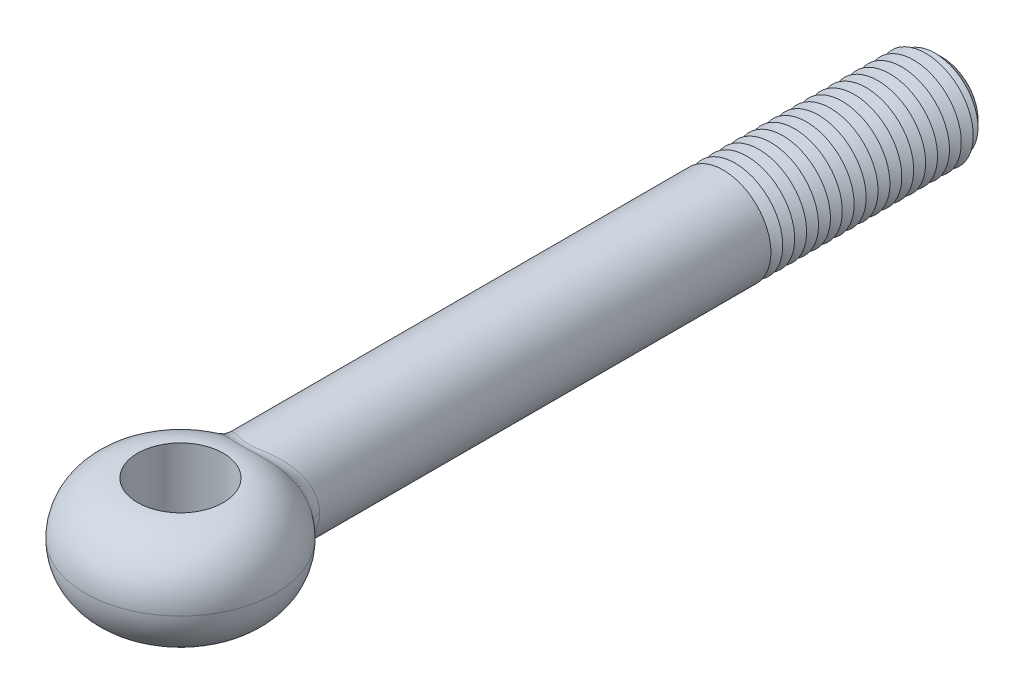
ISO-10303-21;
HEADER;
FILE_DESCRIPTION(('STEP AP214'),'2;1');
FILE_NAME('part.step','',(''),(''),'','','');
FILE_SCHEMA(('AUTOMOTIVE_DESIGN { 1 0 10303 214 1 1 1 1 }'));
ENDSEC;
DATA;
#1=APPLICATION_CONTEXT('core data for automotive mechanical design processes');
#2=APPLICATION_PROTOCOL_DEFINITION('international standard','automotive_design',2000,#1);
#3=PRODUCT_CONTEXT('',#1,'mechanical');
#4=PRODUCT('Part','Part','',(#3));
#5=PRODUCT_RELATED_PRODUCT_CATEGORY('part','',(#4));
#6=PRODUCT_DEFINITION_FORMATION('','',#4);
#7=PRODUCT_DEFINITION_CONTEXT('part definition',#1,'design');
#8=PRODUCT_DEFINITION('design','',#6,#7);
#9=PRODUCT_DEFINITION_SHAPE('','',#8);
#10=(LENGTH_UNIT() NAMED_UNIT(*) SI_UNIT(.MILLI.,.METRE.));
#11=(NAMED_UNIT(*) PLANE_ANGLE_UNIT() SI_UNIT($,.RADIAN.));
#12=(NAMED_UNIT(*) SI_UNIT($,.STERADIAN.) SOLID_ANGLE_UNIT());
#13=UNCERTAINTY_MEASURE_WITH_UNIT(LENGTH_MEASURE(1.E-05),#10,'distance_accuracy_value','');
#14=(GEOMETRIC_REPRESENTATION_CONTEXT(3) GLOBAL_UNCERTAINTY_ASSIGNED_CONTEXT((#13)) GLOBAL_UNIT_ASSIGNED_CONTEXT((#10,
#11,#12)) REPRESENTATION_CONTEXT('',''));
#15=CARTESIAN_POINT('',(0.,0.,0.));
#16=DIRECTION('',(0.,0.,1.));
#17=DIRECTION('',(1.,0.,0.));
#18=AXIS2_PLACEMENT_3D('',#15,#16,#17);
#19=CARTESIAN_POINT('',(0.,0.,-160.));
#20=DIRECTION('',(0.,0.,1.));
#21=DIRECTION('',(1.,0.,0.));
#22=AXIS2_PLACEMENT_3D('',#19,#20,#21);
#23=CYLINDRICAL_SURFACE('',#22,10.);
#24=CARTESIAN_POINT('',(0.,0.,-114.));
#25=DIRECTION('',(0.,0.,-1.));
#26=DIRECTION('',(-1.,0.,0.));
#27=AXIS2_PLACEMENT_3D('',#24,#25,#26);
#28=CIRCLE('',#27,10.);
#29=CARTESIAN_POINT('',(-10.,0.,-114.));
#30=VERTEX_POINT('',#29);
#31=EDGE_CURVE('E78',#30,#30,#28,.T.);
#32=ORIENTED_EDGE('',*,*,#31,.F.);
#33=EDGE_LOOP('',(#32));
#34=FACE_BOUND('',#33,.T.);
#35=CARTESIAN_POINT('',(9.43452897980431,-5.9855471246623,-15.5975544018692));
#36=CARTESIAN_POINT('',(8.34423805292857,-5.52525611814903,-16.6059320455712));
#37=CARTESIAN_POINT('',(8.11431624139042,-5.84447362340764,-18.1101473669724));
#38=CARTESIAN_POINT('',(9.60050520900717,-5.77068079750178,-15.6600678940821));
#39=CARTESIAN_POINT('',(8.48250308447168,-5.3158455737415,-16.6734523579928));
#40=CARTESIAN_POINT('',(8.26546699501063,-5.63467148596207,-18.2014690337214));
#41=CARTESIAN_POINT('',(9.7577841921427,-5.54896856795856,-15.7193267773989));
#42=CARTESIAN_POINT('',(8.61224377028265,-5.10213898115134,-16.7368596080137));
#43=CARTESIAN_POINT('',(8.40899835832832,-5.41818479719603,-18.2879579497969));
#44=CARTESIAN_POINT('',(10.053869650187,-5.09311935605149,-15.8308850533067));
#45=CARTESIAN_POINT('',(8.85513381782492,-4.66620933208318,-16.8556211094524));
#46=CARTESIAN_POINT('',(8.6796419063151,-4.9730795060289,-18.4506608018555));
#47=CARTESIAN_POINT('',(10.1926707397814,-4.85897877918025,-15.8831824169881));
#48=CARTESIAN_POINT('',(8.96815881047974,-4.44404031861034,-16.9109148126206));
#49=CARTESIAN_POINT('',(8.80674930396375,-4.74445739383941,-18.5268717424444));
#50=CARTESIAN_POINT('',(10.4506831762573,-4.37955751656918,-15.9803525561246));
#51=CARTESIAN_POINT('',(9.17718300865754,-3.99242395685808,-17.0131862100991));
#52=CARTESIAN_POINT('',(9.04332894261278,-4.27633562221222,-18.6683874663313));
#53=CARTESIAN_POINT('',(10.5698855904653,-4.13427181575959,-16.0252219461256));
#54=CARTESIAN_POINT('',(9.27305982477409,-3.76305815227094,-17.0601040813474));
#55=CARTESIAN_POINT('',(9.15279314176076,-4.03683106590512,-18.7336872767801));
#56=CARTESIAN_POINT('',(10.7875880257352,-3.634260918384,-16.1071213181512));
#57=CARTESIAN_POINT('',(9.44739138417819,-3.29841554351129,-17.1454161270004));
#58=CARTESIAN_POINT('',(9.35291302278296,-3.54860493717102,-18.8528181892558));
#59=CARTESIAN_POINT('',(10.8860907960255,-3.37953698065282,-16.1441523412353));
#60=CARTESIAN_POINT('',(9.52574461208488,-3.063249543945,-17.183760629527));
#61=CARTESIAN_POINT('',(9.4435712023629,-3.29988459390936,-18.906650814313));
#62=CARTESIAN_POINT('',(11.0586995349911,-2.87065864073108,-16.2090049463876));
#63=CARTESIAN_POINT('',(9.66255871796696,-2.5958661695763,-17.2507122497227));
#64=CARTESIAN_POINT('',(9.60255363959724,-2.80300001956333,-19.0008915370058));
#65=CARTESIAN_POINT('',(11.1334873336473,-2.61674859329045,-16.237084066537));
#66=CARTESIAN_POINT('',(9.72150133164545,-2.36390013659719,-17.2795551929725));
#67=CARTESIAN_POINT('',(9.67150157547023,-2.555074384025,-19.041675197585));
#68=CARTESIAN_POINT('',(11.2622086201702,-2.10328461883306,-16.2853899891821));
#69=CARTESIAN_POINT('',(9.82270778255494,-1.89657583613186,-17.3290774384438));
#70=CARTESIAN_POINT('',(9.79023230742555,-2.05371225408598,-19.1118184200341));
#71=CARTESIAN_POINT('',(11.3161352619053,-1.84372886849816,-16.3056142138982));
#72=CARTESIAN_POINT('',(9.8649025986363,-1.66135361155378,-17.349722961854));
#73=CARTESIAN_POINT('',(9.84000881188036,-1.80027397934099,-19.1411742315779));
#74=CARTESIAN_POINT('',(11.4025652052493,-1.32109132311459,-16.338018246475));
#75=CARTESIAN_POINT('',(9.93244623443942,-1.18887816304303,-17.3827703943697));
#76=CARTESIAN_POINT('',(9.91981122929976,-1.28995449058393,-19.1882016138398));
#77=CARTESIAN_POINT('',(11.435087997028,-1.05801295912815,-16.3502053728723));
#78=CARTESIAN_POINT('',(9.95776661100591,-0.951775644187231,-17.3951583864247));
#79=CARTESIAN_POINT('',(9.94985511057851,-1.0330766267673,-19.2058838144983));
#80=CARTESIAN_POINT('',(11.4784864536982,-0.529957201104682,-16.3664661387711));
#81=CARTESIAN_POINT('',(9.99155479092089,-0.476371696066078,-17.4116890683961));
#82=CARTESIAN_POINT('',(9.98994969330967,-0.517466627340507,-19.2294751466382));
#83=CARTESIAN_POINT('',(11.4893618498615,-0.264979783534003,-16.3705396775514));
#84=CARTESIAN_POINT('',(10.0000000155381,-0.238226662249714,-17.415820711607));
#85=CARTESIAN_POINT('',(10.0000001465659,-0.258734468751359,-19.2353841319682));
#86=CARTESIAN_POINT('',(11.4893615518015,0.269629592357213,-16.3705395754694));
#87=CARTESIAN_POINT('',(9.99999998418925,0.242407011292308,-17.4158206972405));
#88=CARTESIAN_POINT('',(9.99999985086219,0.263274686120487,-19.2353839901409));
#89=CARTESIAN_POINT('',(11.4781008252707,0.53926163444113,-16.3663217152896));
#90=CARTESIAN_POINT('',(9.9912557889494,0.48473250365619,-17.4115427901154));
#91=CARTESIAN_POINT('',(9.98959327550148,0.526551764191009,-19.2292656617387));
#92=CARTESIAN_POINT('',(11.4331665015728,1.07653539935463,-16.3494853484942));
#93=CARTESIAN_POINT('',(9.9562701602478,0.968459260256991,-17.3944262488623));
#94=CARTESIAN_POINT('',(9.94808005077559,1.05116251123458,-19.2048391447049));
#95=CARTESIAN_POINT('',(11.3994921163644,1.3441770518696,-16.3368665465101));
#96=CARTESIAN_POINT('',(9.9300520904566,1.20969577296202,-17.3815990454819));
#97=CARTESIAN_POINT('',(9.91697267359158,1.31249611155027,-19.1865305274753));
#98=CARTESIAN_POINT('',(11.3100467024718,1.8755498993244,-16.3033310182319));
#99=CARTESIAN_POINT('',(9.86013961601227,1.69016143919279,-17.347392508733));
#100=CARTESIAN_POINT('',(9.83438836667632,1.83134501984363,-19.1378602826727));
#101=CARTESIAN_POINT('',(11.254271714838,2.13928038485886,-16.2824128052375));
#102=CARTESIAN_POINT('',(9.81648899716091,1.9292337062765,-17.3260346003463));
#103=CARTESIAN_POINT('',(9.78290778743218,2.08885963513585,-19.1074964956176));
#104=CARTESIAN_POINT('',(11.1211278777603,2.66099186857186,-16.2324443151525));
#105=CARTESIAN_POINT('',(9.71176614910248,2.40426315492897,-17.2747914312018));
#106=CARTESIAN_POINT('',(9.66010560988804,2.59827488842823,-19.0349366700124));
#107=CARTESIAN_POINT('',(11.043751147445,2.91897073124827,-16.2033910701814));
#108=CARTESIAN_POINT('',(9.65075538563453,2.64007593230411,-17.2449362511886));
#109=CARTESIAN_POINT('',(9.58877677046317,2.85017344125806,-18.9927363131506));
#110=CARTESIAN_POINT('',(10.8683072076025,3.42676440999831,-16.1374676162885));
#111=CARTESIAN_POINT('',(9.51159962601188,3.10681781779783,-17.1768385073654));
#112=CARTESIAN_POINT('',(9.42720199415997,3.34599891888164,-18.8969337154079));
#113=CARTESIAN_POINT('',(10.7702839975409,3.67659530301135,-16.1006140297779));
#114=CARTESIAN_POINT('',(9.43357674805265,3.33762998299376,-17.1386557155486));
#115=CARTESIAN_POINT('',(9.33699628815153,3.58994154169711,-18.8433557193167));
#116=CARTESIAN_POINT('',(10.5542593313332,4.1671394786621,-16.0193404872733));
#117=CARTESIAN_POINT('',(9.26049301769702,3.79376863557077,-17.0539542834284));
#118=CARTESIAN_POINT('',(9.13844085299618,4.06892407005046,-18.7251285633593));
#119=CARTESIAN_POINT('',(10.4362490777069,4.40784868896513,-15.9749171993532));
#120=CARTESIAN_POINT('',(9.1655238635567,4.01898948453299,-17.0074805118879));
#121=CARTESIAN_POINT('',(9.0300831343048,4.30395999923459,-18.6604745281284));
#122=CARTESIAN_POINT('',(10.1813021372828,4.87847620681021,-15.8789002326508));
#123=CARTESIAN_POINT('',(8.95890120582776,4.4625267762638,-16.9063865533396));
#124=CARTESIAN_POINT('',(8.7963369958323,4.76349528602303,-18.5206320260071));
#125=CARTESIAN_POINT('',(10.0443720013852,5.10839821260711,-15.8273090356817));
#126=CARTESIAN_POINT('',(8.84736248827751,4.68076606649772,-16.8518224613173));
#127=CARTESIAN_POINT('',(8.67095447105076,4.98799825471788,-18.4454472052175));
#128=CARTESIAN_POINT('',(9.75260585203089,5.55625016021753,-15.7173729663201));
#129=CARTESIAN_POINT('',(8.60795982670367,5.10918973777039,-16.7347636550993));
#130=CARTESIAN_POINT('',(8.40427110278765,5.42529476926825,-18.2851064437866));
#131=CARTESIAN_POINT('',(9.59776873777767,5.77417936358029,-15.6590276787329));
#132=CARTESIAN_POINT('',(8.48020856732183,5.31932036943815,-16.6723238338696));
#133=CARTESIAN_POINT('',(8.26296928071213,5.63808759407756,-18.1999498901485));
#134=CARTESIAN_POINT('',(9.26615260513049,6.20356593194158,-15.534146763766));
#135=CARTESIAN_POINT('',(8.20461231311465,5.73672793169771,-16.5377554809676));
#136=CARTESIAN_POINT('',(7.96098558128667,6.0573539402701,-18.0175190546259));
#137=CARTESIAN_POINT('',(9.08883645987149,6.4146038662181,-15.4674111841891));
#138=CARTESIAN_POINT('',(8.05636478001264,5.94370774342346,-16.4654337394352));
#139=CARTESIAN_POINT('',(7.7998337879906,6.26341791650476,-17.9199477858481));
#140=CARTESIAN_POINT('',(8.71758429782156,6.82162435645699,-15.3279355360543));
#141=CARTESIAN_POINT('',(7.74367757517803,6.34640999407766,-16.3131822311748));
#142=CARTESIAN_POINT('',(7.4633054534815,6.66084533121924,-17.7158184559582));
#143=CARTESIAN_POINT('',(8.52365283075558,7.01761100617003,-15.2551971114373));
#144=CARTESIAN_POINT('',(7.57936139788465,6.54213539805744,-16.2333112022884));
#145=CARTESIAN_POINT('',(7.28793280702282,6.85221276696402,-17.6092628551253));
#146=CARTESIAN_POINT('',(8.12016404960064,7.39386400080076,-15.1043942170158));
#147=CARTESIAN_POINT('',(7.23510051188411,6.92124197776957,-16.0665300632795));
#148=CARTESIAN_POINT('',(6.92417984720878,7.21959784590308,-17.3881065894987));
#149=CARTESIAN_POINT('',(7.91059883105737,7.57412229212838,-15.0263270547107));
#150=CARTESIAN_POINT('',(7.05525523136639,7.10464535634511,-15.9796657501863));
#151=CARTESIAN_POINT('',(6.735792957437,7.39560762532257,-17.2735018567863));
#152=CARTESIAN_POINT('',(7.47700680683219,7.91811936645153,-14.8657958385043));
#153=CARTESIAN_POINT('',(6.6807721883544,7.45778289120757,-15.7997990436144));
#154=CARTESIAN_POINT('',(6.34742931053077,7.73149702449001,-17.037563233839));
#155=CARTESIAN_POINT('',(7.2529835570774,8.08186218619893,-14.7833328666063));
#156=CARTESIAN_POINT('',(6.48622962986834,7.62757357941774,-15.7068372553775));
#157=CARTESIAN_POINT('',(6.14745540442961,7.89138058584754,-16.9162309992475));
#158=CARTESIAN_POINT('',(6.77134336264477,8.40579390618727,-14.6078016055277));
#159=CARTESIAN_POINT('',(6.06569707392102,7.96638984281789,-15.507686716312));
#160=CARTESIAN_POINT('',(5.71933908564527,8.20767755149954,-16.6576501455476));
#161=CARTESIAN_POINT('',(6.512495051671,8.56446092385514,-14.5144317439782));
#162=CARTESIAN_POINT('',(5.83842837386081,8.13426205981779,-15.4010317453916));
#163=CARTESIAN_POINT('',(5.49025421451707,8.36260494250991,-16.5199309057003));
#164=CARTESIAN_POINT('',(5.97928293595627,8.8614010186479,-14.3254807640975));
#165=CARTESIAN_POINT('',(5.36786976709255,8.45139804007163,-15.1837485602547));
#166=CARTESIAN_POINT('',(5.02091237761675,8.65254644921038,-16.240859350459));
#167=CARTESIAN_POINT('',(5.70491599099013,8.99966994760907,-14.2298992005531));
#168=CARTESIAN_POINT('',(5.12463036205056,8.60077991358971,-15.07312594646));
#169=CARTESIAN_POINT('',(4.78065315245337,8.78755651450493,-16.0995063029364));
#170=CARTESIAN_POINT('',(5.1405320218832,9.25561084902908,-14.0388519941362));
#171=CARTESIAN_POINT('',(4.62232310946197,8.87981959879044,-14.8506895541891));
#172=CARTESIAN_POINT('',(4.28955099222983,9.03746513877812,-15.8166039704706));
#173=CARTESIAN_POINT('',(4.85049666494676,9.37325797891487,-13.9433866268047));
#174=CARTESIAN_POINT('',(4.36324512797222,9.00959558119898,-14.7388483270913));
#175=CARTESIAN_POINT('',(4.03869573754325,9.15233944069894,-15.6750546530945));
#176=CARTESIAN_POINT('',(4.25463017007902,9.58739445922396,-13.7561899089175));
#177=CARTESIAN_POINT('',(3.82959253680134,9.24785728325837,-14.5184109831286));
#178=CARTESIAN_POINT('',(3.52704154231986,9.36142893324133,-15.3971561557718));
#179=CARTESIAN_POINT('',(3.94880498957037,9.68389171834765,-13.6644571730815));
#180=CARTESIAN_POINT('',(3.55497971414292,9.35650417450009,-14.4097498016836));
#181=CARTESIAN_POINT('',(3.26624636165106,9.45565184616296,-15.2608050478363));
#182=CARTESIAN_POINT('',(3.43589915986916,9.82367399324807,-13.5221298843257));
#183=CARTESIAN_POINT('',(3.09349956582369,9.5152325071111,-14.2403576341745));
#184=CARTESIAN_POINT('',(2.83229257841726,9.59213958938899,-15.0490317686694));
#185=CARTESIAN_POINT('',(3.23387124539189,9.87347664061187,-13.4688140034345));
#186=CARTESIAN_POINT('',(2.91169341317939,9.57213232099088,-14.1767435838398));
#187=CARTESIAN_POINT('',(2.66218071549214,9.64076843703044,-14.9696450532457));
#188=CARTESIAN_POINT('',(2.82276410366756,9.96416789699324,-13.3676828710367));
#189=CARTESIAN_POINT('',(2.54161663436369,9.67624211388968,-14.05582083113));
#190=CARTESIAN_POINT('',(2.31773787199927,9.72932218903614,-14.8189766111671));
#191=CARTESIAN_POINT('',(2.61368516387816,10.0050568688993,-13.319867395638));
#192=CARTESIAN_POINT('',(2.35330062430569,9.72349213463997,-13.9984773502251));
#193=CARTESIAN_POINT('',(2.14340706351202,9.76924744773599,-14.7476945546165));
#194=CARTESIAN_POINT('',(2.18934081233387,10.0774084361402,-13.232234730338));
#195=CARTESIAN_POINT('',(1.97112322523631,9.80743490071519,-13.8932151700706));
#196=CARTESIAN_POINT('',(1.79125705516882,9.83989375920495,-14.6169946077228));
#197=CARTESIAN_POINT('',(1.97410477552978,10.1089095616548,-13.1923850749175));
#198=CARTESIAN_POINT('',(1.77722521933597,9.84420740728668,-13.8452196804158));
#199=CARTESIAN_POINT('',(1.61345539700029,9.87065243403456,-14.5575285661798));
#200=CARTESIAN_POINT('',(1.53721646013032,10.1622357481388,-13.1231108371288));
#201=CARTESIAN_POINT('',(1.38378639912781,9.90663622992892,-13.7617076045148));
#202=CARTESIAN_POINT('',(1.25400645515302,9.92272177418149,-14.4541203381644));
#203=CARTESIAN_POINT('',(1.31556607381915,10.1840636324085,-13.0936832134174));
#204=CARTESIAN_POINT('',(1.18416025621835,9.93232760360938,-13.7261484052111));
#205=CARTESIAN_POINT('',(1.07236030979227,9.94403519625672,-14.4101736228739));
#206=CARTESIAN_POINT('',(0.901086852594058,10.2150338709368,-13.0512803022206));
#207=CARTESIAN_POINT('',(0.811010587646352,9.96883413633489,-13.6748948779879));
#208=CARTESIAN_POINT('',(0.733646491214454,9.97427549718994,-14.3468387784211));
#209=CARTESIAN_POINT('',(0.708925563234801,10.225588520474,-13.0364985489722));
#210=CARTESIAN_POINT('',(0.638016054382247,9.9813164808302,-13.6570022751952));
#211=CARTESIAN_POINT('',(0.576981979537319,9.98458138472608,-14.3247545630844));
#212=CARTESIAN_POINT('',(0.32280480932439,10.239115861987,-13.0174775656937));
#213=CARTESIAN_POINT('',(0.290519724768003,9.99731568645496,-13.6339840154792));
#214=CARTESIAN_POINT('',(0.2625642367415,9.99778989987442,-14.2963356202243));
#215=CARTESIAN_POINT('',(0.128845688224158,10.2420899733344,-13.0132363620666));
#216=CARTESIAN_POINT('',(0.11594169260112,10.0008413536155,-13.6288457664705));
#217=CARTESIAN_POINT('',(0.104811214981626,10.0006939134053,-14.2899979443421));
#218=CARTESIAN_POINT('',(-0.258903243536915,10.2403820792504,-13.0156565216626));
#219=CARTESIAN_POINT('',(-0.232987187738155,9.99881931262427,-13.6317755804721));
#220=CARTESIAN_POINT('',(-0.210605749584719,9.9990262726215,-14.2936141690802));
#221=CARTESIAN_POINT('',(-0.452692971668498,10.235697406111,-13.0223216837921));
#222=CARTESIAN_POINT('',(-0.407417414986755,9.99326752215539,-13.6398495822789));
#223=CARTESIAN_POINT('',(-0.368269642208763,9.99445201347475,-14.3035737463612));
#224=CARTESIAN_POINT('',(-0.838056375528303,10.2187856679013,-13.0459971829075));
#225=CARTESIAN_POINT('',(-0.754249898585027,9.97327695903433,-13.6684946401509));
#226=CARTESIAN_POINT('',(-0.682255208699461,9.97793886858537,-14.3389452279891));
#227=CARTESIAN_POINT('',(-1.02962955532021,10.2065569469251,-13.0630097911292));
#228=CARTESIAN_POINT('',(-0.926726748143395,9.95882742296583,-13.6890809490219));
#229=CARTESIAN_POINT('',(-0.838576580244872,9.96599836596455,-14.3643605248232));
#230=CARTESIAN_POINT('',(-1.47709063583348,10.1691133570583,-13.113849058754));
#231=CARTESIAN_POINT('',(-1.32963595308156,9.91473356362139,-13.7505127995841));
#232=CARTESIAN_POINT('',(-1.20464773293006,9.92943728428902,-14.4402891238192));
#233=CARTESIAN_POINT('',(-1.73139053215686,10.140813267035,-13.151518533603));
#234=CARTESIAN_POINT('',(-1.5587089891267,9.88147336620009,-13.7960088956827));
#235=CARTESIAN_POINT('',(-1.41344202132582,9.90180420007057,-14.4965358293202));
#236=CARTESIAN_POINT('',(-2.23104582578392,10.0715291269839,-13.239514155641));
#237=CARTESIAN_POINT('',(-2.00870802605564,9.80059822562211,-13.9019685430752));
#238=CARTESIAN_POINT('',(-1.8256925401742,9.83415301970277,-14.6278545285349));
#239=CARTESIAN_POINT('',(-2.47639580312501,10.0305375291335,-13.2898478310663));
#240=CARTESIAN_POINT('',(-2.22975057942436,9.75292233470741,-13.9625022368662));
#241=CARTESIAN_POINT('',(-2.02914551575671,9.79412755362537,-14.7029377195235));
#242=CARTESIAN_POINT('',(-2.9588911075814,9.93629512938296,-13.3995119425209));
#243=CARTESIAN_POINT('',(-2.66423463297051,9.64414242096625,-14.0939421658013));
#244=CARTESIAN_POINT('',(-2.43144462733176,9.70210635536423,-14.8664118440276));
#245=CARTESIAN_POINT('',(-3.19598869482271,9.88298340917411,-13.4588865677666));
#246=CARTESIAN_POINT('',(-2.87771399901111,9.58291258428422,-14.1649560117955));
#247=CARTESIAN_POINT('',(-2.63026227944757,9.65005114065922,-14.9548681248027));
#248=CARTESIAN_POINT('',(-3.66094239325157,9.76467554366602,-13.5832721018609));
#249=CARTESIAN_POINT('',(-3.29595689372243,9.44812095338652,-14.3131723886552));
#250=CARTESIAN_POINT('',(-3.02232846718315,9.53453167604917,-15.1400304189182));
#251=CARTESIAN_POINT('',(-3.88879902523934,9.69968005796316,-13.648282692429));
#252=CARTESIAN_POINT('',(-3.50077505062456,9.37449775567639,-14.3904211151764));
#253=CARTESIAN_POINT('',(-3.21557731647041,9.47106807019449,-15.2367359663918));
#254=CARTESIAN_POINT('',(-4.44320756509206,9.52429263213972,-13.813552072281));
#255=CARTESIAN_POINT('',(-3.99876446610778,9.17730333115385,-14.5861617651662));
#256=CARTESIAN_POINT('',(-3.68829661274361,9.29981435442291,-15.4823644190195));
#257=CARTESIAN_POINT('',(-4.76458779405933,9.40709204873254,-13.9157408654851));
#258=CARTESIAN_POINT('',(-4.28661274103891,9.04678997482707,-14.7065021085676));
#259=CARTESIAN_POINT('',(-3.96458981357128,9.18537607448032,-15.6340547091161));
#260=CARTESIAN_POINT('',(-5.38930158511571,9.14816852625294,-14.12183146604));
#261=CARTESIAN_POINT('',(-4.84418122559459,8.76215134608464,-14.9475940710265));
#262=CARTESIAN_POINT('',(-4.50539064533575,8.93255512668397,-15.9395491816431));
#263=CARTESIAN_POINT('',(-5.69262932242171,9.00643772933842,-14.2257338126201));
#264=CARTESIAN_POINT('',(-5.11390788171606,8.60783261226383,-15.0683962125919));
#265=CARTESIAN_POINT('',(-4.76989446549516,8.79416478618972,-16.0933540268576));
#266=CARTESIAN_POINT('',(-6.2807517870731,8.69911934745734,-14.4315862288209));
#267=CARTESIAN_POINT('',(-5.63445612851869,8.27743175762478,-15.306083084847));
#268=CARTESIAN_POINT('',(-5.28576367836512,8.49408959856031,-16.3976428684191));
#269=CARTESIAN_POINT('',(-6.56557804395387,8.53357398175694,-14.5335393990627));
#270=CARTESIAN_POINT('',(-5.8852609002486,8.1012237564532,-15.4229792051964));
#271=CARTESIAN_POINT('',(-5.53715127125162,8.33244597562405,-16.5481322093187));
#272=CARTESIAN_POINT('',(-7.11655081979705,8.17895147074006,-14.7332405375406));
#273=CARTESIAN_POINT('',(-6.36771692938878,7.72839278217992,-15.6503344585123));
#274=CARTESIAN_POINT('',(-6.02582390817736,7.98618157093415,-16.8424988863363));
#275=CARTESIAN_POINT('',(-7.38269879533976,7.98987616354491,-14.8309888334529));
#276=CARTESIAN_POINT('',(-6.5992657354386,7.53164079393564,-15.7607606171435));
#277=CARTESIAN_POINT('',(-6.26311005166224,7.80156258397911,-16.9863767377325));
#278=CARTESIAN_POINT('',(-7.89448355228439,7.58937034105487,-15.0202729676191));
#279=CARTESIAN_POINT('',(-7.04171419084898,7.11984304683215,-15.9730734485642));
#280=CARTESIAN_POINT('',(-6.72123688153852,7.41049629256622,-17.2646275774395));
#281=CARTESIAN_POINT('',(-8.14016591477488,7.37799201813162,-15.1118225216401));
#282=CARTESIAN_POINT('',(-7.25251801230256,6.9047481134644,-16.0749191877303));
#283=CARTESIAN_POINT('',(-6.9421139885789,7.20409995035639,-17.3990215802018));
#284=CARTESIAN_POINT('',(-8.61006535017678,6.93354564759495,-15.2875527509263));
#285=CARTESIAN_POINT('',(-7.65299610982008,6.45765789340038,-16.2690458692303));
#286=CARTESIAN_POINT('',(-7.36595828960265,6.77012874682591,-17.656686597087));
#287=CARTESIAN_POINT('',(-8.83428130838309,6.70047647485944,-15.371733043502));
#288=CARTESIAN_POINT('',(-7.8424935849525,6.22562042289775,-16.361245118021));
#289=CARTESIAN_POINT('',(-7.56892455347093,6.5425527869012,-17.7799570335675));
#290=CARTESIAN_POINT('',(-9.25940881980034,6.21400101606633,-15.5315844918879));
#291=CARTESIAN_POINT('',(-8.19932512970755,5.74654163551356,-16.5351494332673));
#292=CARTESIAN_POINT('',(-7.95478255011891,6.06754307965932,-18.0137900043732));
#293=CARTESIAN_POINT('',(-9.46031551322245,5.96059050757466,-15.6072538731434));
#294=CARTESIAN_POINT('',(-8.36645913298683,5.49950956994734,-16.6167587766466));
#295=CARTESIAN_POINT('',(-8.13767009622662,5.82010520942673,-18.1243498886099));
#296=CARTESIAN_POINT('',(-9.83679553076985,5.43527222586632,-15.7490893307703));
#297=CARTESIAN_POINT('',(-8.67756159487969,4.99254792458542,-16.7687780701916));
#298=CARTESIAN_POINT('',(-8.48110805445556,5.3071681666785,-18.3313946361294));
#299=CARTESIAN_POINT('',(-10.0123724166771,5.16336706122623,-15.8152567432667));
#300=CARTESIAN_POINT('',(-8.82133112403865,4.7326884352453,-16.8390914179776));
#301=CARTESIAN_POINT('',(-8.64166160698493,5.04167154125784,-18.4278814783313));
#302=CARTESIAN_POINT('',(-10.3212633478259,4.62921939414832,-15.9316192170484));
#303=CARTESIAN_POINT('',(-9.07266333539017,4.22688436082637,-16.9620419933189));
#304=CARTESIAN_POINT('',(-8.92458732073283,4.52011321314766,-18.5974339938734));
#305=CARTESIAN_POINT('',(-10.4569869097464,4.36841996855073,-15.9827265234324));
#306=CARTESIAN_POINT('',(-9.18224116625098,3.98188546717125,-17.0156619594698));
#307=CARTESIAN_POINT('',(-9.04911967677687,4.26546057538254,-18.671841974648));
#308=CARTESIAN_POINT('',(-10.7046952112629,3.83526953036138,-16.0759469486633));
#309=CARTESIAN_POINT('',(-9.3812489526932,3.48456856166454,-17.1130474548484));
#310=CARTESIAN_POINT('',(-9.27666839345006,3.74487597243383,-18.8074855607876));
#311=CARTESIAN_POINT('',(-10.8166824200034,3.5629197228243,-16.1180610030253));
#312=CARTESIAN_POINT('',(-9.47054625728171,3.23238025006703,-17.156748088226));
#313=CARTESIAN_POINT('',(-9.37968699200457,3.47894518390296,-18.8687225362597));
#314=CARTESIAN_POINT('',(-11.0155728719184,3.00929549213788,-16.1928087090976));
#315=CARTESIAN_POINT('',(-9.62851946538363,2.72270494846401,-17.2340550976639));
#316=CARTESIAN_POINT('',(-9.56280689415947,2.93836933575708,-18.977363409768));
#317=CARTESIAN_POINT('',(-11.1025230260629,2.72803886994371,-16.2254600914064));
#318=CARTESIAN_POINT('',(-9.69711918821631,2.46538774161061,-17.2676241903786));
#319=CARTESIAN_POINT('',(-9.64295105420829,2.66374165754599,-19.0247931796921));
#320=CARTESIAN_POINT('',(-11.2506400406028,2.15853827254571,-16.2810514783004));
#321=CARTESIAN_POINT('',(-9.81366746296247,1.94660748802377,-17.324654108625));
#322=CARTESIAN_POINT('',(-9.77955371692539,2.10766363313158,-19.1055210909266));
#323=CARTESIAN_POINT('',(-11.3118190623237,1.87029766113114,-16.3039960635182));
#324=CARTESIAN_POINT('',(-9.86153588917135,1.68533214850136,-17.3480757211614));
#325=CARTESIAN_POINT('',(-9.83602339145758,1.82621657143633,-19.1388258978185));
#326=CARTESIAN_POINT('',(-11.4028551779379,1.31891290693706,-16.3381269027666));
#327=CARTESIAN_POINT('',(-9.93267162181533,1.18691316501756,-17.3828806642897));
#328=CARTESIAN_POINT('',(-9.92007913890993,1.28782741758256,-19.1883592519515));
#329=CARTESIAN_POINT('',(-11.4352749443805,1.05621556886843,-16.350275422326));
#330=CARTESIAN_POINT('',(-9.95791206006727,0.95015650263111,-17.3952295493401));
#331=CARTESIAN_POINT('',(-9.95002783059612,1.03132159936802,-19.2059854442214));
#332=CARTESIAN_POINT('',(-11.4785246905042,0.529012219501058,-16.3664804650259));
#333=CARTESIAN_POINT('',(-9.99158458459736,0.475522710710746,-17.4117036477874));
#334=CARTESIAN_POINT('',(-9.9899850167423,0.516543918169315,-19.2294959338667));
#335=CARTESIAN_POINT('',(-11.4893616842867,0.264506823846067,-16.3705396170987));
#336=CARTESIAN_POINT('',(-9.99999992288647,0.23780149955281,-17.4158206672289));
#337=CARTESIAN_POINT('',(-9.99999998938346,0.258272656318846,-19.2353840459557));
#338=CARTESIAN_POINT('',(-11.4893617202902,-0.269274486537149,-16.3705396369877));
#339=CARTESIAN_POINT('',(-10.0000000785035,-0.242087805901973,-17.4158207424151));
#340=CARTESIAN_POINT('',(-10.0000000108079,-0.262927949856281,-19.2353840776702));
#341=CARTESIAN_POINT('',(-11.4781305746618,-0.538550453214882,-16.3663328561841));
#342=CARTESIAN_POINT('',(-9.99127884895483,-0.484093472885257,-17.41155407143));
#343=CARTESIAN_POINT('',(-9.98962077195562,-0.525857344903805,-19.2292818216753));
#344=CARTESIAN_POINT('',(-11.4333067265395,-1.07521295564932,-16.3495378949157));
#345=CARTESIAN_POINT('',(-9.95637938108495,-0.967267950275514,-17.3944796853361));
#346=CARTESIAN_POINT('',(-9.94820958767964,-1.04987123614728,-19.2049153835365));
#347=CARTESIAN_POINT('',(-11.3997055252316,-1.34259873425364,-16.3369465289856));
#348=CARTESIAN_POINT('',(-9.93021837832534,-1.2082722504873,-17.3816804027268));
#349=CARTESIAN_POINT('',(-9.91716979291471,-1.31095499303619,-19.1866465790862));
#350=CARTESIAN_POINT('',(-11.310346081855,-1.87408052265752,-16.303443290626));
#351=CARTESIAN_POINT('',(-9.86037403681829,-1.68882951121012,-17.3475072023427));
#352=CARTESIAN_POINT('',(-9.83466469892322,-1.82991027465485,-19.1380232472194));
#353=CARTESIAN_POINT('',(-11.2545333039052,-2.13816677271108,-16.2825109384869));
#354=CARTESIAN_POINT('',(-9.81669446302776,-1.92822118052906,-17.3261351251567));
#355=CARTESIAN_POINT('',(-9.78314912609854,-2.0877722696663,-19.1076389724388));
#356=CARTESIAN_POINT('',(-11.1212790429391,-2.66048788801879,-16.2325010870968));
#357=CARTESIAN_POINT('',(-9.71188550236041,-2.40380188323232,-17.2748498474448));
#358=CARTESIAN_POINT('',(-9.66024496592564,-2.59778278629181,-19.0350191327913));
#359=CARTESIAN_POINT('',(-11.0438369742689,-2.91872259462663,-16.2034233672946));
#360=CARTESIAN_POINT('',(-9.65082369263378,-2.63984697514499,-17.2449697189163));
#361=CARTESIAN_POINT('',(-9.58885584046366,-2.84993115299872,-18.9927832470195));
#362=CARTESIAN_POINT('',(-10.8681953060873,-3.42708801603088,-16.1374255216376));
#363=CARTESIAN_POINT('',(-9.51151104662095,-3.10711477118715,-17.1767951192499));
#364=CARTESIAN_POINT('',(-9.42709891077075,-3.34631489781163,-18.8968725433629));
#365=CARTESIAN_POINT('',(-10.7700335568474,-3.67723256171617,-16.1005196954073));
#366=CARTESIAN_POINT('',(-9.43337750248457,-3.33821895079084,-17.1385580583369));
#367=CARTESIAN_POINT('',(-9.33676571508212,-3.59056378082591,-18.8432185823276));
#368=CARTESIAN_POINT('',(-10.5537166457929,-4.16830295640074,-16.0191364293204));
#369=CARTESIAN_POINT('',(-9.26005752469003,-3.79485238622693,-17.0537413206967));
#370=CARTESIAN_POINT('',(-9.13794243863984,-4.07006012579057,-18.7248316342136));
#371=CARTESIAN_POINT('',(-10.4355590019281,-4.4092276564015,-15.9746580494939));
#372=CARTESIAN_POINT('',(-9.16496856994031,-4.02027727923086,-17.0072093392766));
#373=CARTESIAN_POINT('',(-9.02945010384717,-4.30530646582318,-18.6600972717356));
#374=CARTESIAN_POINT('',(-10.1805249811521,-4.87980527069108,-15.8786068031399));
#375=CARTESIAN_POINT('',(-8.9582676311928,-4.46379094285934,-16.9060760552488));
#376=CARTESIAN_POINT('',(-8.79562481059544,-4.76479302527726,-18.5202044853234));
#377=CARTESIAN_POINT('',(-10.0436912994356,-5.10948231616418,-15.8270501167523));
#378=CARTESIAN_POINT('',(-8.84680285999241,-4.68181416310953,-16.8515466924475));
#379=CARTESIAN_POINT('',(-8.67033027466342,-4.98905680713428,-18.4450698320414));
#380=CARTESIAN_POINT('',(-9.75220852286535,-5.55682061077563,-15.7172256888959));
#381=CARTESIAN_POINT('',(-8.60763391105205,-5.10972638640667,-16.7346064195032));
#382=CARTESIAN_POINT('',(-8.40390994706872,-5.42585177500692,-18.2848913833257));
#383=CARTESIAN_POINT('',(-9.59756440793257,-5.77448519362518,-15.6589598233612));
#384=CARTESIAN_POINT('',(-8.48004754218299,-5.31956459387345,-16.672252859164));
#385=CARTESIAN_POINT('',(-8.2627885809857,-5.63838621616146,-18.1998503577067));
#386=CARTESIAN_POINT('',(-9.43452897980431,-5.9855471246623,-15.5975544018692));
#387=CARTESIAN_POINT('',(-8.34423805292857,-5.52525611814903,-16.6059320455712));
#388=CARTESIAN_POINT('',(-8.11431624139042,-5.84447362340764,-18.1101473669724));
#389=(BOUNDED_SURFACE() B_SPLINE_SURFACE(3,2,((#35,#36,#37),(#38,#39,#40),(#41,#42,#43),(#44,
#45,#46),(#47,#48,#49),(#50,#51,#52),(#53,#54,#55),(#56,#57,#58),(#59,#60,#61),(#62,#63,#64),
(#65,#66,#67),(#68,#69,#70),(#71,#72,#73),(#74,#75,#76),(#77,#78,#79),(#80,#81,#82),(#83,#84,
#85),(#86,#87,#88),(#89,#90,#91),(#92,#93,#94),(#95,#96,#97),(#98,#99,#100),(#101,#102,#103),
(#104,#105,#106),(#107,#108,#109),(#110,#111,#112),(#113,#114,#115),(#116,#117,#118),(#119,#120,
#121),(#122,#123,#124),(#125,#126,#127),(#128,#129,#130),(#131,#132,#133),(#134,#135,#136),
(#137,#138,#139),(#140,#141,#142),(#143,#144,#145),(#146,#147,#148),(#149,#150,#151),(#152,#153,
#154),(#155,#156,#157),(#158,#159,#160),(#161,#162,#163),(#164,#165,#166),(#167,#168,#169),
(#170,#171,#172),(#173,#174,#175),(#176,#177,#178),(#179,#180,#181),(#182,#183,#184),(#185,#186,
#187),(#188,#189,#190),(#191,#192,#193),(#194,#195,#196),(#197,#198,#199),(#200,#201,#202),
(#203,#204,#205),(#206,#207,#208),(#209,#210,#211),(#212,#213,#214),(#215,#216,#217),(#218,#219,
#220),(#221,#222,#223),(#224,#225,#226),(#227,#228,#229),(#230,#231,#232),(#233,#234,#235),
(#236,#237,#238),(#239,#240,#241),(#242,#243,#244),(#245,#246,#247),(#248,#249,#250),(#251,#252,
#253),(#254,#255,#256),(#257,#258,#259),(#260,#261,#262),(#263,#264,#265),(#266,#267,#268),
(#269,#270,#271),(#272,#273,#274),(#275,#276,#277),(#278,#279,#280),(#281,#282,#283),(#284,#285,
#286),(#287,#288,#289),(#290,#291,#292),(#293,#294,#295),(#296,#297,#298),(#299,#300,#301),
(#302,#303,#304),(#305,#306,#307),(#308,#309,#310),(#311,#312,#313),(#314,#315,#316),(#317,#318,
#319),(#320,#321,#322),(#323,#324,#325),(#326,#327,#328),(#329,#330,#331),(#332,#333,#334),
(#335,#336,#337),(#338,#339,#340),(#341,#342,#343),(#344,#345,#346),(#347,#348,#349),(#350,#351,
#352),(#353,#354,#355),(#356,#357,#358),(#359,#360,#361),(#362,#363,#364),(#365,#366,#367),
(#368,#369,#370),(#371,#372,#373),(#374,#375,#376),(#377,#378,#379),(#380,#381,#382),(#383,#384,
#385),(#386,#387,#388)),.UNSPECIFIED.,.F.,.F.,.F.) B_SPLINE_SURFACE_WITH_KNOTS((4,2,2,2,2,2,2,2,
2,2,2,2,2,2,2,2,2,2,2,2,2,2,2,2,2,2,2,2,2,2,2,2,2,2,2,2,2,2,2,2,2,2,2,2,2,2,2,2,2,2,2,2,2,2,2,2,
2,2,4),(3,3),(0.,1.08226690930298,2.16484855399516,3.24792225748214,4.33085202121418,
5.37900830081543,6.42750826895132,7.47505215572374,8.52260904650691,9.58854824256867,
10.6545249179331,11.7206926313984,12.7872498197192,13.8515566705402,14.9163332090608,
15.9807419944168,17.0452162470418,18.1431859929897,19.2408560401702,20.339084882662,
21.4370446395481,22.6296089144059,23.8224153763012,25.0166490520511,26.2104353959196,
26.9651479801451,27.7198298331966,28.4713702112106,29.2226910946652,29.861241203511,
30.4996717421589,31.1383247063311,31.77711790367,32.6451230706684,33.5136454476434,
34.3865578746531,35.2594210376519,36.5516017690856,37.8441971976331,39.1345286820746,
40.4247594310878,41.7120351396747,42.999377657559,44.2869880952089,45.5744172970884,
46.7424308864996,47.9103229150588,49.0760122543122,50.2411508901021,51.2871766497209,
52.3328624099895,53.3973963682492,54.4623349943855,55.5299046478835,56.597503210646,
57.6631681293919,58.7289654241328,59.7923657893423,60.8554695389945),(0.,1.),
.UNSPECIFIED.) GEOMETRIC_REPRESENTATION_ITEM() RATIONAL_B_SPLINE_SURFACE(((1.,0.913883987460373,
1.),(1.,0.911846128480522,1.),(1.,0.909886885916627,1.),(1.,0.906156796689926,1.),(1.,
0.904386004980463,1.),(1.,0.901064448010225,1.),(1.,0.899513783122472,1.),(1.,0.896661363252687,
1.),(1.,0.895359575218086,1.),(1.,0.893066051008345,1.),(1.,0.892065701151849,1.),(1.,
0.890337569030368,1.),(1.,0.889609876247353,1.),(1.,0.88844102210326,1.),(1.,0.887999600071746,
1.),(1.,0.887410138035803,1.),(1.,0.887262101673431,1.),(1.,0.887262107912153,1.),(1.,
0.88741539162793,1.),(1.,0.888025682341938,1.),(1.,0.888482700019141,1.),(1.,0.889692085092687,
1.),(1.,0.890444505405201,1.),(1.,0.892231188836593,1.),(1.,0.893265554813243,1.),(1.,
0.895594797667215,1.),(1.,0.896889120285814,1.),(1.,0.899717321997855,1.),(1.,0.90125130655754,
1.),(1.,0.904531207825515,1.),(1.,0.906277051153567,1.),(1.,0.909951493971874,1.),(1.,
0.911880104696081,1.),(1.,0.915950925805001,1.),(1.,0.918097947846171,1.),(1.,0.92251383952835,
1.),(1.,0.924782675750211,1.),(1.,0.929404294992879,1.),(1.,0.931757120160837,1.),(1.,
0.936503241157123,1.),(1.,0.93889652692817,1.),(1.,0.943886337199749,1.),(1.,0.946482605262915,
1.),(1.,0.951611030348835,1.),(1.,0.954143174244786,1.),(1.,0.959076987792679,1.),(1.,
0.961478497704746,1.),(1.,0.966065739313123,1.),(1.,0.968251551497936,1.),(1.,0.9715584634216,
1.),(1.,0.972775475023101,1.),(1.,0.975049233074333,1.),(1.,0.976105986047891,1.),(1.,
0.978017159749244,1.),(1.,0.978872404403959,1.),(1.,0.980344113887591,1.),(1.,0.980960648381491,
1.),(1.,0.981843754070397,1.),(1.,0.98214896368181,1.),(1.,0.982541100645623,1.),(1.,
0.982628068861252,1.),(1.,0.98257832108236,1.),(1.,0.98244152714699,1.),(1.,0.98195261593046,
1.),(1.,0.981600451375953,1.),(1.,0.98053826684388,1.),(1.,0.979745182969,1.),(1.,
0.977859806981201,1.),(1.,0.976767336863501,1.),(1.,0.974339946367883,1.),(1.,0.973003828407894,
1.),(1.,0.97014690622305,1.),(1.,0.968626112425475,1.),(1.,0.964679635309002,1.),(1.,
0.96217021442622,1.),(1.,0.956958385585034,1.),(1.,0.954255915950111,1.),(1.,0.948755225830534,
1.),(1.,0.945957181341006,1.),(1.,0.940340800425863,1.),(1.,0.937522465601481,1.),(1.,
0.931944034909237,1.),(1.,0.92918382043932,1.),(1.,0.923782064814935,1.),(1.,0.921140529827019,
1.),(1.,0.916039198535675,1.),(1.,0.913579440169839,1.),(1.,0.908902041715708,1.),(1.,
0.906684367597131,1.),(1.,0.902737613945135,1.),(1.,0.900982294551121,1.),(1.,0.897752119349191,
1.),(1.,0.896277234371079,1.),(1.,0.893641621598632,1.),(1.,0.892480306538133,1.),(1.,
0.890493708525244,1.),(1.,0.889668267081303,1.),(1.,0.888437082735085,1.),(1.,0.887997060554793,
1.),(1.,0.88740961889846,1.),(1.,0.887262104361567,1.),(1.,0.88726210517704,1.),(1.,
0.887414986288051,1.),(1.,0.888023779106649,1.),(1.,0.888479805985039,1.),(1.,0.889688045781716,
1.),(1.,0.890440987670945,1.),(1.,0.89222916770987,1.),(1.,0.893264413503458,1.),(1.,
0.895596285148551,1.),(1.,0.896892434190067,1.),(1.,0.899724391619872,1.),(1.,0.901260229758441,
1.),(1.,0.904541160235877,1.),(1.,0.906285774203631,1.),(1.,0.909956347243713,1.),(1.,
0.911882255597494,1.),(1.,0.913883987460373,1.))) REPRESENTATION_ITEM('') SURFACE());
#390=CARTESIAN_POINT('',(-8.11431624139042,-5.84447362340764,-18.1101473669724));
#391=CARTESIAN_POINT('',(-8.2627885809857,-5.63838621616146,-18.1998503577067));
#392=CARTESIAN_POINT('',(-8.40390994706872,-5.42585177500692,-18.2848913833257));
#393=CARTESIAN_POINT('',(-8.67033027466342,-4.98905680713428,-18.4450698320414));
#394=CARTESIAN_POINT('',(-8.79562481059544,-4.76479302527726,-18.5202044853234));
#395=CARTESIAN_POINT('',(-9.02945010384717,-4.30530646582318,-18.6600972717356));
#396=CARTESIAN_POINT('',(-9.13794243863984,-4.07006012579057,-18.7248316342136));
#397=CARTESIAN_POINT('',(-9.33676571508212,-3.59056378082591,-18.8432185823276));
#398=CARTESIAN_POINT('',(-9.42709891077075,-3.34631489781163,-18.8968725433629));
#399=CARTESIAN_POINT('',(-9.58885584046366,-2.84993115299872,-18.9927832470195));
#400=CARTESIAN_POINT('',(-9.66024496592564,-2.59778278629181,-19.0350191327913));
#401=CARTESIAN_POINT('',(-9.78314912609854,-2.0877722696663,-19.1076389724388));
#402=CARTESIAN_POINT('',(-9.83466469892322,-1.82991027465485,-19.1380232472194));
#403=CARTESIAN_POINT('',(-9.91716979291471,-1.31095499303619,-19.1866465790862));
#404=CARTESIAN_POINT('',(-9.94820958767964,-1.04987123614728,-19.2049153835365));
#405=CARTESIAN_POINT('',(-9.98962077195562,-0.525857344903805,-19.2292818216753));
#406=CARTESIAN_POINT('',(-10.0000000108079,-0.262927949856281,-19.2353840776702));
#407=CARTESIAN_POINT('',(-9.99999998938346,0.258272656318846,-19.2353840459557));
#408=CARTESIAN_POINT('',(-9.9899850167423,0.516543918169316,-19.2294959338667));
#409=CARTESIAN_POINT('',(-9.95002783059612,1.03132159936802,-19.2059854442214));
#410=CARTESIAN_POINT('',(-9.92007913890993,1.28782741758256,-19.1883592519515));
#411=CARTESIAN_POINT('',(-9.83602339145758,1.82621657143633,-19.1388258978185));
#412=CARTESIAN_POINT('',(-9.77955371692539,2.10766363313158,-19.1055210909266));
#413=CARTESIAN_POINT('',(-9.6429510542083,2.66374165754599,-19.0247931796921));
#414=CARTESIAN_POINT('',(-9.56280689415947,2.93836933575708,-18.977363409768));
#415=CARTESIAN_POINT('',(-9.37968699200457,3.47894518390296,-18.8687225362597));
#416=CARTESIAN_POINT('',(-9.27666839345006,3.74487597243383,-18.8074855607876));
#417=CARTESIAN_POINT('',(-9.04911967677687,4.26546057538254,-18.671841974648));
#418=CARTESIAN_POINT('',(-8.92458732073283,4.52011321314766,-18.5974339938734));
#419=CARTESIAN_POINT('',(-8.64166160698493,5.04167154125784,-18.4278814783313));
#420=CARTESIAN_POINT('',(-8.48110805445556,5.3071681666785,-18.3313946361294));
#421=CARTESIAN_POINT('',(-8.13767009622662,5.82010520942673,-18.1243498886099));
#422=CARTESIAN_POINT('',(-7.95478255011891,6.06754307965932,-18.0137900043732));
#423=CARTESIAN_POINT('',(-7.56892455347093,6.5425527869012,-17.7799570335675));
#424=CARTESIAN_POINT('',(-7.36595828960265,6.7701287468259,-17.656686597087));
#425=CARTESIAN_POINT('',(-6.9421139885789,7.20409995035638,-17.3990215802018));
#426=CARTESIAN_POINT('',(-6.72123688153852,7.41049629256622,-17.2646275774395));
#427=CARTESIAN_POINT('',(-6.26311005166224,7.80156258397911,-16.9863767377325));
#428=CARTESIAN_POINT('',(-6.02582390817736,7.98618157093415,-16.8424988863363));
#429=CARTESIAN_POINT('',(-5.53715127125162,8.33244597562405,-16.5481322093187));
#430=CARTESIAN_POINT('',(-5.28576367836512,8.49408959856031,-16.3976428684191));
#431=CARTESIAN_POINT('',(-4.76989446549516,8.79416478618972,-16.0933540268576));
#432=CARTESIAN_POINT('',(-4.50539064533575,8.93255512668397,-15.9395491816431));
#433=CARTESIAN_POINT('',(-3.96458981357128,9.18537607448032,-15.6340547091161));
#434=CARTESIAN_POINT('',(-3.68829661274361,9.29981435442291,-15.4823644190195));
#435=CARTESIAN_POINT('',(-3.21557731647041,9.47106807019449,-15.2367359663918));
#436=CARTESIAN_POINT('',(-3.02232846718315,9.53453167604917,-15.1400304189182));
#437=CARTESIAN_POINT('',(-2.63026227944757,9.65005114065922,-14.9548681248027));
#438=CARTESIAN_POINT('',(-2.43144462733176,9.70210635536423,-14.8664118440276));
#439=CARTESIAN_POINT('',(-2.02914551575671,9.79412755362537,-14.7029377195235));
#440=CARTESIAN_POINT('',(-1.8256925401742,9.83415301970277,-14.6278545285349));
#441=CARTESIAN_POINT('',(-1.41344202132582,9.90180420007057,-14.4965358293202));
#442=CARTESIAN_POINT('',(-1.20464773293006,9.92943728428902,-14.4402891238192));
#443=CARTESIAN_POINT('',(-0.838576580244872,9.96599836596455,-14.3643605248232));
#444=CARTESIAN_POINT('',(-0.682255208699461,9.97793886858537,-14.3389452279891));
#445=CARTESIAN_POINT('',(-0.368269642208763,9.99445201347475,-14.3035737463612));
#446=CARTESIAN_POINT('',(-0.210605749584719,9.9990262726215,-14.2936141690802));
#447=CARTESIAN_POINT('',(0.104811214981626,10.0006939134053,-14.2899979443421));
#448=CARTESIAN_POINT('',(0.262564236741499,9.99778989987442,-14.2963356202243));
#449=CARTESIAN_POINT('',(0.576981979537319,9.98458138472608,-14.3247545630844));
#450=CARTESIAN_POINT('',(0.733646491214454,9.97427549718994,-14.3468387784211));
#451=CARTESIAN_POINT('',(1.07236030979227,9.94403519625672,-14.4101736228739));
#452=CARTESIAN_POINT('',(1.25400645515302,9.92272177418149,-14.4541203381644));
#453=CARTESIAN_POINT('',(1.61345539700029,9.87065243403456,-14.5575285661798));
#454=CARTESIAN_POINT('',(1.79125705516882,9.83989375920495,-14.6169946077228));
#455=CARTESIAN_POINT('',(2.14340706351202,9.76924744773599,-14.7476945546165));
#456=CARTESIAN_POINT('',(2.31773787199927,9.72932218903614,-14.8189766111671));
#457=CARTESIAN_POINT('',(2.66218071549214,9.64076843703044,-14.9696450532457));
#458=CARTESIAN_POINT('',(2.83229257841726,9.59213958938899,-15.0490317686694));
#459=CARTESIAN_POINT('',(3.26624636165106,9.45565184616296,-15.2608050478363));
#460=CARTESIAN_POINT('',(3.52704154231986,9.36142893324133,-15.3971561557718));
#461=CARTESIAN_POINT('',(4.03869573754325,9.15233944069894,-15.6750546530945));
#462=CARTESIAN_POINT('',(4.28955099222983,9.03746513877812,-15.8166039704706));
#463=CARTESIAN_POINT('',(4.78065315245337,8.78755651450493,-16.0995063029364));
#464=CARTESIAN_POINT('',(5.02091237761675,8.65254644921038,-16.240859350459));
#465=CARTESIAN_POINT('',(5.49025421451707,8.36260494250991,-16.5199309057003));
#466=CARTESIAN_POINT('',(5.71933908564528,8.20767755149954,-16.6576501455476));
#467=CARTESIAN_POINT('',(6.14745540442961,7.89138058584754,-16.9162309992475));
#468=CARTESIAN_POINT('',(6.34742931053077,7.73149702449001,-17.037563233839));
#469=CARTESIAN_POINT('',(6.735792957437,7.39560762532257,-17.2735018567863));
#470=CARTESIAN_POINT('',(6.92417984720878,7.21959784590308,-17.3881065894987));
#471=CARTESIAN_POINT('',(7.28793280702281,6.85221276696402,-17.6092628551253));
#472=CARTESIAN_POINT('',(7.4633054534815,6.66084533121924,-17.7158184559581));
#473=CARTESIAN_POINT('',(7.7998337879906,6.26341791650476,-17.9199477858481));
#474=CARTESIAN_POINT('',(7.96098558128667,6.0573539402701,-18.0175190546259));
#475=CARTESIAN_POINT('',(8.26296928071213,5.63808759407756,-18.1999498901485));
#476=CARTESIAN_POINT('',(8.40427110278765,5.42529476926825,-18.2851064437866));
#477=CARTESIAN_POINT('',(8.67095447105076,4.98799825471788,-18.4454472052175));
#478=CARTESIAN_POINT('',(8.7963369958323,4.76349528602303,-18.5206320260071));
#479=CARTESIAN_POINT('',(9.0300831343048,4.30395999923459,-18.6604745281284));
#480=CARTESIAN_POINT('',(9.13844085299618,4.06892407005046,-18.7251285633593));
#481=CARTESIAN_POINT('',(9.33699628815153,3.58994154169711,-18.8433557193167));
#482=CARTESIAN_POINT('',(9.42720199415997,3.34599891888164,-18.8969337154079));
#483=CARTESIAN_POINT('',(9.58877677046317,2.85017344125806,-18.9927363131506));
#484=CARTESIAN_POINT('',(9.66010560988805,2.59827488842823,-19.0349366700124));
#485=CARTESIAN_POINT('',(9.78290778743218,2.08885963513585,-19.1074964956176));
#486=CARTESIAN_POINT('',(9.83438836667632,1.83134501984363,-19.1378602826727));
#487=CARTESIAN_POINT('',(9.91697267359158,1.31249611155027,-19.1865305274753));
#488=CARTESIAN_POINT('',(9.94808005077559,1.05116251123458,-19.2048391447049));
#489=CARTESIAN_POINT('',(9.98959327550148,0.526551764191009,-19.2292656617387));
#490=CARTESIAN_POINT('',(9.99999985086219,0.263274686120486,-19.2353839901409));
#491=CARTESIAN_POINT('',(10.0000001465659,-0.258734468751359,-19.2353841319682));
#492=CARTESIAN_POINT('',(9.98994969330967,-0.517466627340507,-19.2294751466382));
#493=CARTESIAN_POINT('',(9.94985511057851,-1.03307662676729,-19.2058838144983));
#494=CARTESIAN_POINT('',(9.91981122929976,-1.28995449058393,-19.1882016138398));
#495=CARTESIAN_POINT('',(9.84000881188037,-1.80027397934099,-19.1411742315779));
#496=CARTESIAN_POINT('',(9.79023230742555,-2.05371225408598,-19.1118184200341));
#497=CARTESIAN_POINT('',(9.67150157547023,-2.555074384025,-19.041675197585));
#498=CARTESIAN_POINT('',(9.60255363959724,-2.80300001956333,-19.0008915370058));
#499=CARTESIAN_POINT('',(9.4435712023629,-3.29988459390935,-18.906650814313));
#500=CARTESIAN_POINT('',(9.35291302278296,-3.54860493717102,-18.8528181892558));
#501=CARTESIAN_POINT('',(9.15279314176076,-4.03683106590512,-18.7336872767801));
#502=CARTESIAN_POINT('',(9.04332894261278,-4.27633562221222,-18.6683874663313));
#503=CARTESIAN_POINT('',(8.80674930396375,-4.74445739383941,-18.5268717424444));
#504=CARTESIAN_POINT('',(8.6796419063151,-4.9730795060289,-18.4506608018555));
#505=CARTESIAN_POINT('',(8.40899835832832,-5.41818479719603,-18.2879579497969));
#506=CARTESIAN_POINT('',(8.26546699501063,-5.63467148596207,-18.2014690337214));
#507=CARTESIAN_POINT('',(8.11431624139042,-5.84447362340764,-18.1101473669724));
#508=B_SPLINE_CURVE_WITH_KNOTS('',3,(#390,#391,#392,#393,#394,#395,#396,#397,#398,#399,#400,
#401,#402,#403,#404,#405,#406,#407,#408,#409,#410,#411,#412,#413,#414,#415,#416,#417,#418,#419,
#420,#421,#422,#423,#424,#425,#426,#427,#428,#429,#430,#431,#432,#433,#434,#435,#436,#437,#438,
#439,#440,#441,#442,#443,#444,#445,#446,#447,#448,#449,#450,#451,#452,#453,#454,#455,#456,#457,
#458,#459,#460,#461,#462,#463,#464,#465,#466,#467,#468,#469,#470,#471,#472,#473,#474,#475,#476,
#477,#478,#479,#480,#481,#482,#483,#484,#485,#486,#487,#488,#489,#490,#491,#492,#493,#494,#495,
#496,#497,#498,#499,#500,#501,#502,#503,#504,#505,#506,#507),.UNSPECIFIED.,.F.,.F.,(4,2,2,2,2,2,
2,2,2,2,2,2,2,2,2,2,2,2,2,2,2,2,2,2,2,2,2,2,2,2,2,2,2,2,2,2,2,2,2,2,2,2,2,2,2,2,2,2,2,2,2,2,2,2,
2,2,2,2,4),(0.,1.06310374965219,2.12650411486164,3.19230140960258,4.25796632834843,
5.32556489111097,6.39313454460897,7.4580731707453,8.52260712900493,9.56829288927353,
10.6143186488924,11.7794572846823,12.9451466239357,14.1130386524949,15.2810522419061,
16.5684814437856,17.8560918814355,19.1434343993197,20.4307101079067,21.7209408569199,
23.0112723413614,24.3038677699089,25.5960485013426,26.4689116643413,27.3418240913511,
28.210346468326,29.0783516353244,29.7171448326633,30.3557977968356,30.9942283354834,
31.6327784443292,32.3840993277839,33.1356397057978,33.8903215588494,34.6450341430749,
35.8388204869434,37.0330541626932,38.2258606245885,39.4184248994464,40.5163846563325,
41.6146134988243,42.7122835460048,43.8102532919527,44.8747275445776,45.9391363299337,
47.0039128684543,48.0682197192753,49.1347769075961,50.2009446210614,51.2669212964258,
52.3328604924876,53.3804173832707,54.4279612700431,55.476461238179,56.5246175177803,
57.6075472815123,58.6906209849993,59.7732026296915,60.8554695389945),.UNSPECIFIED.);
#509=CARTESIAN_POINT('',(-10.,0.,-19.2353840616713));
#510=VERTEX_POINT('',#509);
#511=CARTESIAN_POINT('',(10.,0.,-19.2353840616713));
#512=VERTEX_POINT('',#511);
#513=EDGE_CURVE('E80',#510,#512,#508,.T.);
#514=ORIENTED_EDGE('',*,*,#513,.T.);
#515=CARTESIAN_POINT('',(-9.43452897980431,5.9855471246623,-15.5975544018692));
#516=CARTESIAN_POINT('',(-8.34423805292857,5.52525611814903,-16.6059320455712));
#517=CARTESIAN_POINT('',(-8.11431624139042,5.84447362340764,-18.1101473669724));
#518=CARTESIAN_POINT('',(-9.60050520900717,5.77068079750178,-15.6600678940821));
#519=CARTESIAN_POINT('',(-8.48250308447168,5.3158455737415,-16.6734523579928));
#520=CARTESIAN_POINT('',(-8.26546699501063,5.63467148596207,-18.2014690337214));
#521=CARTESIAN_POINT('',(-9.7577841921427,5.54896856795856,-15.7193267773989));
#522=CARTESIAN_POINT('',(-8.61224377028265,5.10213898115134,-16.7368596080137));
#523=CARTESIAN_POINT('',(-8.40899835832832,5.41818479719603,-18.2879579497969));
#524=CARTESIAN_POINT('',(-10.053869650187,5.09311935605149,-15.8308850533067));
#525=CARTESIAN_POINT('',(-8.85513381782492,4.66620933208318,-16.8556211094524));
#526=CARTESIAN_POINT('',(-8.6796419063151,4.9730795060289,-18.4506608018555));
#527=CARTESIAN_POINT('',(-10.1926707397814,4.85897877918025,-15.8831824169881));
#528=CARTESIAN_POINT('',(-8.96815881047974,4.44404031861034,-16.9109148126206));
#529=CARTESIAN_POINT('',(-8.80674930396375,4.74445739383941,-18.5268717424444));
#530=CARTESIAN_POINT('',(-10.4506831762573,4.37955751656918,-15.9803525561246));
#531=CARTESIAN_POINT('',(-9.17718300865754,3.99242395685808,-17.0131862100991));
#532=CARTESIAN_POINT('',(-9.04332894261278,4.27633562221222,-18.6683874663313));
#533=CARTESIAN_POINT('',(-10.5698855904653,4.13427181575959,-16.0252219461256));
#534=CARTESIAN_POINT('',(-9.27305982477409,3.76305815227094,-17.0601040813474));
#535=CARTESIAN_POINT('',(-9.15279314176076,4.03683106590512,-18.7336872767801));
#536=CARTESIAN_POINT('',(-10.7875880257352,3.634260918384,-16.1071213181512));
#537=CARTESIAN_POINT('',(-9.44739138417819,3.29841554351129,-17.1454161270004));
#538=CARTESIAN_POINT('',(-9.35291302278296,3.54860493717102,-18.8528181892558));
#539=CARTESIAN_POINT('',(-10.8860907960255,3.37953698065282,-16.1441523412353));
#540=CARTESIAN_POINT('',(-9.52574461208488,3.063249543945,-17.183760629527));
#541=CARTESIAN_POINT('',(-9.4435712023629,3.29988459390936,-18.906650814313));
#542=CARTESIAN_POINT('',(-11.0586995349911,2.87065864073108,-16.2090049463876));
#543=CARTESIAN_POINT('',(-9.66255871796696,2.5958661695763,-17.2507122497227));
#544=CARTESIAN_POINT('',(-9.60255363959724,2.80300001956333,-19.0008915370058));
#545=CARTESIAN_POINT('',(-11.1334873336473,2.61674859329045,-16.237084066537));
#546=CARTESIAN_POINT('',(-9.72150133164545,2.36390013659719,-17.2795551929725));
#547=CARTESIAN_POINT('',(-9.67150157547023,2.555074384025,-19.041675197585));
#548=CARTESIAN_POINT('',(-11.2622086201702,2.10328461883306,-16.2853899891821));
#549=CARTESIAN_POINT('',(-9.82270778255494,1.89657583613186,-17.3290774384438));
#550=CARTESIAN_POINT('',(-9.79023230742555,2.05371225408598,-19.1118184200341));
#551=CARTESIAN_POINT('',(-11.3161352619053,1.84372886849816,-16.3056142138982));
#552=CARTESIAN_POINT('',(-9.8649025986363,1.66135361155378,-17.349722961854));
#553=CARTESIAN_POINT('',(-9.84000881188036,1.80027397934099,-19.1411742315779));
#554=CARTESIAN_POINT('',(-11.4025652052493,1.32109132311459,-16.338018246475));
#555=CARTESIAN_POINT('',(-9.93244623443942,1.18887816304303,-17.3827703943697));
#556=CARTESIAN_POINT('',(-9.91981122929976,1.28995449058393,-19.1882016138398));
#557=CARTESIAN_POINT('',(-11.435087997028,1.05801295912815,-16.3502053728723));
#558=CARTESIAN_POINT('',(-9.95776661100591,0.951775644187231,-17.3951583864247));
#559=CARTESIAN_POINT('',(-9.94985511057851,1.0330766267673,-19.2058838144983));
#560=CARTESIAN_POINT('',(-11.4784864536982,0.529957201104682,-16.3664661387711));
#561=CARTESIAN_POINT('',(-9.99155479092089,0.476371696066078,-17.4116890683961));
#562=CARTESIAN_POINT('',(-9.98994969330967,0.517466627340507,-19.2294751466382));
#563=CARTESIAN_POINT('',(-11.4893618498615,0.264979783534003,-16.3705396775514));
#564=CARTESIAN_POINT('',(-10.0000000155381,0.238226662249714,-17.415820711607));
#565=CARTESIAN_POINT('',(-10.0000001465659,0.258734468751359,-19.2353841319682));
#566=CARTESIAN_POINT('',(-11.4893615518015,-0.269629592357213,-16.3705395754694));
#567=CARTESIAN_POINT('',(-9.99999998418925,-0.242407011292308,-17.4158206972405));
#568=CARTESIAN_POINT('',(-9.99999985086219,-0.263274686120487,-19.2353839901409));
#569=CARTESIAN_POINT('',(-11.4781008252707,-0.53926163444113,-16.3663217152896));
#570=CARTESIAN_POINT('',(-9.9912557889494,-0.48473250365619,-17.4115427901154));
#571=CARTESIAN_POINT('',(-9.98959327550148,-0.526551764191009,-19.2292656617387));
#572=CARTESIAN_POINT('',(-11.4331665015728,-1.07653539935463,-16.3494853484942));
#573=CARTESIAN_POINT('',(-9.9562701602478,-0.968459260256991,-17.3944262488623));
#574=CARTESIAN_POINT('',(-9.94808005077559,-1.05116251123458,-19.2048391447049));
#575=CARTESIAN_POINT('',(-11.3994921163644,-1.3441770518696,-16.3368665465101));
#576=CARTESIAN_POINT('',(-9.9300520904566,-1.20969577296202,-17.3815990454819));
#577=CARTESIAN_POINT('',(-9.91697267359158,-1.31249611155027,-19.1865305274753));
#578=CARTESIAN_POINT('',(-11.3100467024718,-1.8755498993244,-16.3033310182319));
#579=CARTESIAN_POINT('',(-9.86013961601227,-1.69016143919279,-17.347392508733));
#580=CARTESIAN_POINT('',(-9.83438836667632,-1.83134501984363,-19.1378602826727));
#581=CARTESIAN_POINT('',(-11.254271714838,-2.13928038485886,-16.2824128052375));
#582=CARTESIAN_POINT('',(-9.81648899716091,-1.9292337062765,-17.3260346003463));
#583=CARTESIAN_POINT('',(-9.78290778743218,-2.08885963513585,-19.1074964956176));
#584=CARTESIAN_POINT('',(-11.1211278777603,-2.66099186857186,-16.2324443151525));
#585=CARTESIAN_POINT('',(-9.71176614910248,-2.40426315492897,-17.2747914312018));
#586=CARTESIAN_POINT('',(-9.66010560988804,-2.59827488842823,-19.0349366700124));
#587=CARTESIAN_POINT('',(-11.043751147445,-2.91897073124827,-16.2033910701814));
#588=CARTESIAN_POINT('',(-9.65075538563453,-2.64007593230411,-17.2449362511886));
#589=CARTESIAN_POINT('',(-9.58877677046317,-2.85017344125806,-18.9927363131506));
#590=CARTESIAN_POINT('',(-10.8683072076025,-3.42676440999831,-16.1374676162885));
#591=CARTESIAN_POINT('',(-9.51159962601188,-3.10681781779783,-17.1768385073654));
#592=CARTESIAN_POINT('',(-9.42720199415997,-3.34599891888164,-18.8969337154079));
#593=CARTESIAN_POINT('',(-10.7702839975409,-3.67659530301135,-16.1006140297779));
#594=CARTESIAN_POINT('',(-9.43357674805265,-3.33762998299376,-17.1386557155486));
#595=CARTESIAN_POINT('',(-9.33699628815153,-3.58994154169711,-18.8433557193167));
#596=CARTESIAN_POINT('',(-10.5542593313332,-4.1671394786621,-16.0193404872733));
#597=CARTESIAN_POINT('',(-9.26049301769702,-3.79376863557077,-17.0539542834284));
#598=CARTESIAN_POINT('',(-9.13844085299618,-4.06892407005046,-18.7251285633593));
#599=CARTESIAN_POINT('',(-10.4362490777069,-4.40784868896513,-15.9749171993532));
#600=CARTESIAN_POINT('',(-9.1655238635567,-4.01898948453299,-17.0074805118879));
#601=CARTESIAN_POINT('',(-9.0300831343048,-4.30395999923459,-18.6604745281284));
#602=CARTESIAN_POINT('',(-10.1813021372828,-4.87847620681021,-15.8789002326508));
#603=CARTESIAN_POINT('',(-8.95890120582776,-4.4625267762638,-16.9063865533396));
#604=CARTESIAN_POINT('',(-8.7963369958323,-4.76349528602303,-18.5206320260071));
#605=CARTESIAN_POINT('',(-10.0443720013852,-5.10839821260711,-15.8273090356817));
#606=CARTESIAN_POINT('',(-8.84736248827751,-4.68076606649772,-16.8518224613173));
#607=CARTESIAN_POINT('',(-8.67095447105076,-4.98799825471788,-18.4454472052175));
#608=CARTESIAN_POINT('',(-9.75260585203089,-5.55625016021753,-15.7173729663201));
#609=CARTESIAN_POINT('',(-8.60795982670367,-5.10918973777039,-16.7347636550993));
#610=CARTESIAN_POINT('',(-8.40427110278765,-5.42529476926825,-18.2851064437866));
#611=CARTESIAN_POINT('',(-9.59776873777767,-5.77417936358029,-15.6590276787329));
#612=CARTESIAN_POINT('',(-8.48020856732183,-5.31932036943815,-16.6723238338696));
#613=CARTESIAN_POINT('',(-8.26296928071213,-5.63808759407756,-18.1999498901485));
#614=CARTESIAN_POINT('',(-9.26615260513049,-6.20356593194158,-15.534146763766));
#615=CARTESIAN_POINT('',(-8.20461231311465,-5.73672793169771,-16.5377554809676));
#616=CARTESIAN_POINT('',(-7.96098558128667,-6.0573539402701,-18.0175190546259));
#617=CARTESIAN_POINT('',(-9.08883645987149,-6.4146038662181,-15.4674111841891));
#618=CARTESIAN_POINT('',(-8.05636478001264,-5.94370774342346,-16.4654337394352));
#619=CARTESIAN_POINT('',(-7.7998337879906,-6.26341791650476,-17.9199477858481));
#620=CARTESIAN_POINT('',(-8.71758429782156,-6.82162435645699,-15.3279355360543));
#621=CARTESIAN_POINT('',(-7.74367757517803,-6.34640999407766,-16.3131822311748));
#622=CARTESIAN_POINT('',(-7.4633054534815,-6.66084533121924,-17.7158184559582));
#623=CARTESIAN_POINT('',(-8.52365283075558,-7.01761100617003,-15.2551971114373));
#624=CARTESIAN_POINT('',(-7.57936139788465,-6.54213539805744,-16.2333112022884));
#625=CARTESIAN_POINT('',(-7.28793280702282,-6.85221276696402,-17.6092628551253));
#626=CARTESIAN_POINT('',(-8.12016404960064,-7.39386400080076,-15.1043942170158));
#627=CARTESIAN_POINT('',(-7.23510051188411,-6.92124197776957,-16.0665300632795));
#628=CARTESIAN_POINT('',(-6.92417984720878,-7.21959784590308,-17.3881065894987));
#629=CARTESIAN_POINT('',(-7.91059883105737,-7.57412229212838,-15.0263270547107));
#630=CARTESIAN_POINT('',(-7.05525523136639,-7.10464535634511,-15.9796657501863));
#631=CARTESIAN_POINT('',(-6.735792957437,-7.39560762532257,-17.2735018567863));
#632=CARTESIAN_POINT('',(-7.47700680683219,-7.91811936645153,-14.8657958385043));
#633=CARTESIAN_POINT('',(-6.6807721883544,-7.45778289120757,-15.7997990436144));
#634=CARTESIAN_POINT('',(-6.34742931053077,-7.73149702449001,-17.037563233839));
#635=CARTESIAN_POINT('',(-7.2529835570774,-8.08186218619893,-14.7833328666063));
#636=CARTESIAN_POINT('',(-6.48622962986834,-7.62757357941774,-15.7068372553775));
#637=CARTESIAN_POINT('',(-6.14745540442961,-7.89138058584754,-16.9162309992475));
#638=CARTESIAN_POINT('',(-6.77134336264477,-8.40579390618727,-14.6078016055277));
#639=CARTESIAN_POINT('',(-6.06569707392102,-7.96638984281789,-15.507686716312));
#640=CARTESIAN_POINT('',(-5.71933908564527,-8.20767755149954,-16.6576501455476));
#641=CARTESIAN_POINT('',(-6.512495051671,-8.56446092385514,-14.5144317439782));
#642=CARTESIAN_POINT('',(-5.83842837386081,-8.13426205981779,-15.4010317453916));
#643=CARTESIAN_POINT('',(-5.49025421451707,-8.36260494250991,-16.5199309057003));
#644=CARTESIAN_POINT('',(-5.97928293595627,-8.8614010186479,-14.3254807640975));
#645=CARTESIAN_POINT('',(-5.36786976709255,-8.45139804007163,-15.1837485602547));
#646=CARTESIAN_POINT('',(-5.02091237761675,-8.65254644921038,-16.240859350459));
#647=CARTESIAN_POINT('',(-5.70491599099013,-8.99966994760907,-14.2298992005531));
#648=CARTESIAN_POINT('',(-5.12463036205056,-8.60077991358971,-15.07312594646));
#649=CARTESIAN_POINT('',(-4.78065315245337,-8.78755651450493,-16.0995063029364));
#650=CARTESIAN_POINT('',(-5.1405320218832,-9.25561084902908,-14.0388519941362));
#651=CARTESIAN_POINT('',(-4.62232310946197,-8.87981959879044,-14.8506895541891));
#652=CARTESIAN_POINT('',(-4.28955099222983,-9.03746513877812,-15.8166039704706));
#653=CARTESIAN_POINT('',(-4.85049666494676,-9.37325797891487,-13.9433866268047));
#654=CARTESIAN_POINT('',(-4.36324512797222,-9.00959558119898,-14.7388483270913));
#655=CARTESIAN_POINT('',(-4.03869573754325,-9.15233944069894,-15.6750546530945));
#656=CARTESIAN_POINT('',(-4.25463017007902,-9.58739445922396,-13.7561899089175));
#657=CARTESIAN_POINT('',(-3.82959253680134,-9.24785728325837,-14.5184109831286));
#658=CARTESIAN_POINT('',(-3.52704154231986,-9.36142893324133,-15.3971561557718));
#659=CARTESIAN_POINT('',(-3.94880498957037,-9.68389171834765,-13.6644571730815));
#660=CARTESIAN_POINT('',(-3.55497971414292,-9.35650417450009,-14.4097498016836));
#661=CARTESIAN_POINT('',(-3.26624636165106,-9.45565184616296,-15.2608050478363));
#662=CARTESIAN_POINT('',(-3.43589915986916,-9.82367399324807,-13.5221298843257));
#663=CARTESIAN_POINT('',(-3.09349956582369,-9.5152325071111,-14.2403576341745));
#664=CARTESIAN_POINT('',(-2.83229257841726,-9.59213958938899,-15.0490317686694));
#665=CARTESIAN_POINT('',(-3.23387124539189,-9.87347664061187,-13.4688140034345));
#666=CARTESIAN_POINT('',(-2.91169341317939,-9.57213232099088,-14.1767435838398));
#667=CARTESIAN_POINT('',(-2.66218071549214,-9.64076843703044,-14.9696450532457));
#668=CARTESIAN_POINT('',(-2.82276410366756,-9.96416789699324,-13.3676828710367));
#669=CARTESIAN_POINT('',(-2.54161663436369,-9.67624211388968,-14.05582083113));
#670=CARTESIAN_POINT('',(-2.31773787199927,-9.72932218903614,-14.8189766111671));
#671=CARTESIAN_POINT('',(-2.61368516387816,-10.0050568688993,-13.319867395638));
#672=CARTESIAN_POINT('',(-2.35330062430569,-9.72349213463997,-13.9984773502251));
#673=CARTESIAN_POINT('',(-2.14340706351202,-9.76924744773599,-14.7476945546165));
#674=CARTESIAN_POINT('',(-2.18934081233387,-10.0774084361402,-13.232234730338));
#675=CARTESIAN_POINT('',(-1.97112322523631,-9.80743490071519,-13.8932151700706));
#676=CARTESIAN_POINT('',(-1.79125705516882,-9.83989375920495,-14.6169946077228));
#677=CARTESIAN_POINT('',(-1.97410477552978,-10.1089095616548,-13.1923850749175));
#678=CARTESIAN_POINT('',(-1.77722521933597,-9.84420740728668,-13.8452196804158));
#679=CARTESIAN_POINT('',(-1.61345539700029,-9.87065243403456,-14.5575285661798));
#680=CARTESIAN_POINT('',(-1.53721646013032,-10.1622357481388,-13.1231108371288));
#681=CARTESIAN_POINT('',(-1.38378639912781,-9.90663622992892,-13.7617076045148));
#682=CARTESIAN_POINT('',(-1.25400645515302,-9.92272177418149,-14.4541203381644));
#683=CARTESIAN_POINT('',(-1.31556607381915,-10.1840636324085,-13.0936832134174));
#684=CARTESIAN_POINT('',(-1.18416025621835,-9.93232760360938,-13.7261484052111));
#685=CARTESIAN_POINT('',(-1.07236030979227,-9.94403519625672,-14.4101736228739));
#686=CARTESIAN_POINT('',(-0.901086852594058,-10.2150338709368,-13.0512803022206));
#687=CARTESIAN_POINT('',(-0.811010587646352,-9.96883413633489,-13.6748948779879));
#688=CARTESIAN_POINT('',(-0.733646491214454,-9.97427549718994,-14.3468387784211));
#689=CARTESIAN_POINT('',(-0.708925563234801,-10.225588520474,-13.0364985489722));
#690=CARTESIAN_POINT('',(-0.638016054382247,-9.9813164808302,-13.6570022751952));
#691=CARTESIAN_POINT('',(-0.576981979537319,-9.98458138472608,-14.3247545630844));
#692=CARTESIAN_POINT('',(-0.32280480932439,-10.239115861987,-13.0174775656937));
#693=CARTESIAN_POINT('',(-0.290519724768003,-9.99731568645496,-13.6339840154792));
#694=CARTESIAN_POINT('',(-0.2625642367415,-9.99778989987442,-14.2963356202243));
#695=CARTESIAN_POINT('',(-0.128845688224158,-10.2420899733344,-13.0132363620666));
#696=CARTESIAN_POINT('',(-0.11594169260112,-10.0008413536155,-13.6288457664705));
#697=CARTESIAN_POINT('',(-0.104811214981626,-10.0006939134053,-14.2899979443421));
#698=CARTESIAN_POINT('',(0.258903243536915,-10.2403820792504,-13.0156565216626));
#699=CARTESIAN_POINT('',(0.232987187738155,-9.99881931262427,-13.6317755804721));
#700=CARTESIAN_POINT('',(0.210605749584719,-9.9990262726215,-14.2936141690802));
#701=CARTESIAN_POINT('',(0.452692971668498,-10.235697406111,-13.0223216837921));
#702=CARTESIAN_POINT('',(0.407417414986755,-9.99326752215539,-13.6398495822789));
#703=CARTESIAN_POINT('',(0.368269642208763,-9.99445201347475,-14.3035737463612));
#704=CARTESIAN_POINT('',(0.838056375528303,-10.2187856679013,-13.0459971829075));
#705=CARTESIAN_POINT('',(0.754249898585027,-9.97327695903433,-13.6684946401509));
#706=CARTESIAN_POINT('',(0.682255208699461,-9.97793886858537,-14.3389452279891));
#707=CARTESIAN_POINT('',(1.02962955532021,-10.2065569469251,-13.0630097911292));
#708=CARTESIAN_POINT('',(0.926726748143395,-9.95882742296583,-13.6890809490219));
#709=CARTESIAN_POINT('',(0.838576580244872,-9.96599836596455,-14.3643605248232));
#710=CARTESIAN_POINT('',(1.47709063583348,-10.1691133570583,-13.113849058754));
#711=CARTESIAN_POINT('',(1.32963595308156,-9.91473356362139,-13.7505127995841));
#712=CARTESIAN_POINT('',(1.20464773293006,-9.92943728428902,-14.4402891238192));
#713=CARTESIAN_POINT('',(1.73139053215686,-10.140813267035,-13.151518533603));
#714=CARTESIAN_POINT('',(1.5587089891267,-9.88147336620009,-13.7960088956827));
#715=CARTESIAN_POINT('',(1.41344202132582,-9.90180420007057,-14.4965358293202));
#716=CARTESIAN_POINT('',(2.23104582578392,-10.0715291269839,-13.239514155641));
#717=CARTESIAN_POINT('',(2.00870802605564,-9.80059822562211,-13.9019685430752));
#718=CARTESIAN_POINT('',(1.8256925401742,-9.83415301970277,-14.6278545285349));
#719=CARTESIAN_POINT('',(2.47639580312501,-10.0305375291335,-13.2898478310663));
#720=CARTESIAN_POINT('',(2.22975057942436,-9.75292233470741,-13.9625022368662));
#721=CARTESIAN_POINT('',(2.02914551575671,-9.79412755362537,-14.7029377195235));
#722=CARTESIAN_POINT('',(2.9588911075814,-9.93629512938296,-13.3995119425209));
#723=CARTESIAN_POINT('',(2.66423463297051,-9.64414242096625,-14.0939421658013));
#724=CARTESIAN_POINT('',(2.43144462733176,-9.70210635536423,-14.8664118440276));
#725=CARTESIAN_POINT('',(3.19598869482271,-9.88298340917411,-13.4588865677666));
#726=CARTESIAN_POINT('',(2.87771399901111,-9.58291258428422,-14.1649560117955));
#727=CARTESIAN_POINT('',(2.63026227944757,-9.65005114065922,-14.9548681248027));
#728=CARTESIAN_POINT('',(3.66094239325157,-9.76467554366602,-13.5832721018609));
#729=CARTESIAN_POINT('',(3.29595689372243,-9.44812095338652,-14.3131723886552));
#730=CARTESIAN_POINT('',(3.02232846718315,-9.53453167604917,-15.1400304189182));
#731=CARTESIAN_POINT('',(3.88879902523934,-9.69968005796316,-13.648282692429));
#732=CARTESIAN_POINT('',(3.50077505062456,-9.37449775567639,-14.3904211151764));
#733=CARTESIAN_POINT('',(3.21557731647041,-9.47106807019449,-15.2367359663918));
#734=CARTESIAN_POINT('',(4.44320756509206,-9.52429263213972,-13.813552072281));
#735=CARTESIAN_POINT('',(3.99876446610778,-9.17730333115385,-14.5861617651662));
#736=CARTESIAN_POINT('',(3.68829661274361,-9.29981435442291,-15.4823644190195));
#737=CARTESIAN_POINT('',(4.76458779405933,-9.40709204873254,-13.9157408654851));
#738=CARTESIAN_POINT('',(4.28661274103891,-9.04678997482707,-14.7065021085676));
#739=CARTESIAN_POINT('',(3.96458981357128,-9.18537607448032,-15.6340547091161));
#740=CARTESIAN_POINT('',(5.38930158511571,-9.14816852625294,-14.12183146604));
#741=CARTESIAN_POINT('',(4.84418122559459,-8.76215134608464,-14.9475940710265));
#742=CARTESIAN_POINT('',(4.50539064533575,-8.93255512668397,-15.9395491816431));
#743=CARTESIAN_POINT('',(5.69262932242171,-9.00643772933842,-14.2257338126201));
#744=CARTESIAN_POINT('',(5.11390788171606,-8.60783261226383,-15.0683962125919));
#745=CARTESIAN_POINT('',(4.76989446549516,-8.79416478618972,-16.0933540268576));
#746=CARTESIAN_POINT('',(6.2807517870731,-8.69911934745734,-14.4315862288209));
#747=CARTESIAN_POINT('',(5.63445612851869,-8.27743175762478,-15.306083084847));
#748=CARTESIAN_POINT('',(5.28576367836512,-8.49408959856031,-16.3976428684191));
#749=CARTESIAN_POINT('',(6.56557804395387,-8.53357398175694,-14.5335393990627));
#750=CARTESIAN_POINT('',(5.8852609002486,-8.1012237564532,-15.4229792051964));
#751=CARTESIAN_POINT('',(5.53715127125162,-8.33244597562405,-16.5481322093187));
#752=CARTESIAN_POINT('',(7.11655081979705,-8.17895147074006,-14.7332405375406));
#753=CARTESIAN_POINT('',(6.36771692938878,-7.72839278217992,-15.6503344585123));
#754=CARTESIAN_POINT('',(6.02582390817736,-7.98618157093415,-16.8424988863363));
#755=CARTESIAN_POINT('',(7.38269879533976,-7.98987616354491,-14.8309888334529));
#756=CARTESIAN_POINT('',(6.5992657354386,-7.53164079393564,-15.7607606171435));
#757=CARTESIAN_POINT('',(6.26311005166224,-7.80156258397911,-16.9863767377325));
#758=CARTESIAN_POINT('',(7.89448355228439,-7.58937034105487,-15.0202729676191));
#759=CARTESIAN_POINT('',(7.04171419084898,-7.11984304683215,-15.9730734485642));
#760=CARTESIAN_POINT('',(6.72123688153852,-7.41049629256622,-17.2646275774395));
#761=CARTESIAN_POINT('',(8.14016591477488,-7.37799201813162,-15.1118225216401));
#762=CARTESIAN_POINT('',(7.25251801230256,-6.9047481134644,-16.0749191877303));
#763=CARTESIAN_POINT('',(6.9421139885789,-7.20409995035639,-17.3990215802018));
#764=CARTESIAN_POINT('',(8.61006535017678,-6.93354564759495,-15.2875527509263));
#765=CARTESIAN_POINT('',(7.65299610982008,-6.45765789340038,-16.2690458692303));
#766=CARTESIAN_POINT('',(7.36595828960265,-6.77012874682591,-17.656686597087));
#767=CARTESIAN_POINT('',(8.83428130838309,-6.70047647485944,-15.371733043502));
#768=CARTESIAN_POINT('',(7.8424935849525,-6.22562042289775,-16.361245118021));
#769=CARTESIAN_POINT('',(7.56892455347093,-6.5425527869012,-17.7799570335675));
#770=CARTESIAN_POINT('',(9.25940881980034,-6.21400101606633,-15.5315844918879));
#771=CARTESIAN_POINT('',(8.19932512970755,-5.74654163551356,-16.5351494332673));
#772=CARTESIAN_POINT('',(7.95478255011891,-6.06754307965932,-18.0137900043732));
#773=CARTESIAN_POINT('',(9.46031551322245,-5.96059050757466,-15.6072538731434));
#774=CARTESIAN_POINT('',(8.36645913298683,-5.49950956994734,-16.6167587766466));
#775=CARTESIAN_POINT('',(8.13767009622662,-5.82010520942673,-18.1243498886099));
#776=CARTESIAN_POINT('',(9.83679553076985,-5.43527222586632,-15.7490893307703));
#777=CARTESIAN_POINT('',(8.67756159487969,-4.99254792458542,-16.7687780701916));
#778=CARTESIAN_POINT('',(8.48110805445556,-5.3071681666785,-18.3313946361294));
#779=CARTESIAN_POINT('',(10.0123724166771,-5.16336706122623,-15.8152567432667));
#780=CARTESIAN_POINT('',(8.82133112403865,-4.7326884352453,-16.8390914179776));
#781=CARTESIAN_POINT('',(8.64166160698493,-5.04167154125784,-18.4278814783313));
#782=CARTESIAN_POINT('',(10.3212633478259,-4.62921939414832,-15.9316192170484));
#783=CARTESIAN_POINT('',(9.07266333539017,-4.22688436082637,-16.9620419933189));
#784=CARTESIAN_POINT('',(8.92458732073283,-4.52011321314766,-18.5974339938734));
#785=CARTESIAN_POINT('',(10.4569869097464,-4.36841996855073,-15.9827265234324));
#786=CARTESIAN_POINT('',(9.18224116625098,-3.98188546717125,-17.0156619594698));
#787=CARTESIAN_POINT('',(9.04911967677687,-4.26546057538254,-18.671841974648));
#788=CARTESIAN_POINT('',(10.7046952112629,-3.83526953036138,-16.0759469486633));
#789=CARTESIAN_POINT('',(9.3812489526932,-3.48456856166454,-17.1130474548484));
#790=CARTESIAN_POINT('',(9.27666839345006,-3.74487597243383,-18.8074855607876));
#791=CARTESIAN_POINT('',(10.8166824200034,-3.5629197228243,-16.1180610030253));
#792=CARTESIAN_POINT('',(9.47054625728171,-3.23238025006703,-17.156748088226));
#793=CARTESIAN_POINT('',(9.37968699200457,-3.47894518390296,-18.8687225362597));
#794=CARTESIAN_POINT('',(11.0155728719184,-3.00929549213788,-16.1928087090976));
#795=CARTESIAN_POINT('',(9.62851946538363,-2.72270494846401,-17.2340550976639));
#796=CARTESIAN_POINT('',(9.56280689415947,-2.93836933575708,-18.977363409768));
#797=CARTESIAN_POINT('',(11.1025230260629,-2.72803886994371,-16.2254600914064));
#798=CARTESIAN_POINT('',(9.69711918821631,-2.46538774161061,-17.2676241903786));
#799=CARTESIAN_POINT('',(9.64295105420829,-2.66374165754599,-19.0247931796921));
#800=CARTESIAN_POINT('',(11.2506400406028,-2.15853827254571,-16.2810514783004));
#801=CARTESIAN_POINT('',(9.81366746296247,-1.94660748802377,-17.324654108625));
#802=CARTESIAN_POINT('',(9.77955371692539,-2.10766363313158,-19.1055210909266));
#803=CARTESIAN_POINT('',(11.3118190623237,-1.87029766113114,-16.3039960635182));
#804=CARTESIAN_POINT('',(9.86153588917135,-1.68533214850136,-17.3480757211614));
#805=CARTESIAN_POINT('',(9.83602339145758,-1.82621657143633,-19.1388258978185));
#806=CARTESIAN_POINT('',(11.4028551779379,-1.31891290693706,-16.3381269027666));
#807=CARTESIAN_POINT('',(9.93267162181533,-1.18691316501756,-17.3828806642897));
#808=CARTESIAN_POINT('',(9.92007913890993,-1.28782741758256,-19.1883592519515));
#809=CARTESIAN_POINT('',(11.4352749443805,-1.05621556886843,-16.350275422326));
#810=CARTESIAN_POINT('',(9.95791206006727,-0.95015650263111,-17.3952295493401));
#811=CARTESIAN_POINT('',(9.95002783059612,-1.03132159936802,-19.2059854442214));
#812=CARTESIAN_POINT('',(11.4785246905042,-0.529012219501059,-16.3664804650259));
#813=CARTESIAN_POINT('',(9.99158458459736,-0.475522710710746,-17.4117036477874));
#814=CARTESIAN_POINT('',(9.9899850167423,-0.516543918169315,-19.2294959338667));
#815=CARTESIAN_POINT('',(11.4893616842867,-0.264506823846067,-16.3705396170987));
#816=CARTESIAN_POINT('',(9.99999992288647,-0.23780149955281,-17.4158206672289));
#817=CARTESIAN_POINT('',(9.99999998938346,-0.258272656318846,-19.2353840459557));
#818=CARTESIAN_POINT('',(11.4893617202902,0.269274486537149,-16.3705396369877));
#819=CARTESIAN_POINT('',(10.0000000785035,0.242087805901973,-17.4158207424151));
#820=CARTESIAN_POINT('',(10.0000000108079,0.262927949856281,-19.2353840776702));
#821=CARTESIAN_POINT('',(11.4781305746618,0.538550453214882,-16.3663328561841));
#822=CARTESIAN_POINT('',(9.99127884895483,0.484093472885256,-17.41155407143));
#823=CARTESIAN_POINT('',(9.98962077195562,0.525857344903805,-19.2292818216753));
#824=CARTESIAN_POINT('',(11.4333067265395,1.07521295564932,-16.3495378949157));
#825=CARTESIAN_POINT('',(9.95637938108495,0.967267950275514,-17.3944796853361));
#826=CARTESIAN_POINT('',(9.94820958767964,1.04987123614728,-19.2049153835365));
#827=CARTESIAN_POINT('',(11.3997055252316,1.34259873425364,-16.3369465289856));
#828=CARTESIAN_POINT('',(9.93021837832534,1.2082722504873,-17.3816804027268));
#829=CARTESIAN_POINT('',(9.91716979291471,1.31095499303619,-19.1866465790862));
#830=CARTESIAN_POINT('',(11.310346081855,1.87408052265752,-16.303443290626));
#831=CARTESIAN_POINT('',(9.86037403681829,1.68882951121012,-17.3475072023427));
#832=CARTESIAN_POINT('',(9.83466469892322,1.82991027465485,-19.1380232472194));
#833=CARTESIAN_POINT('',(11.2545333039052,2.13816677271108,-16.2825109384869));
#834=CARTESIAN_POINT('',(9.81669446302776,1.92822118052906,-17.3261351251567));
#835=CARTESIAN_POINT('',(9.78314912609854,2.0877722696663,-19.1076389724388));
#836=CARTESIAN_POINT('',(11.1212790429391,2.66048788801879,-16.2325010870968));
#837=CARTESIAN_POINT('',(9.71188550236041,2.40380188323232,-17.2748498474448));
#838=CARTESIAN_POINT('',(9.66024496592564,2.59778278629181,-19.0350191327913));
#839=CARTESIAN_POINT('',(11.0438369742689,2.91872259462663,-16.2034233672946));
#840=CARTESIAN_POINT('',(9.65082369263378,2.63984697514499,-17.2449697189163));
#841=CARTESIAN_POINT('',(9.58885584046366,2.84993115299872,-18.9927832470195));
#842=CARTESIAN_POINT('',(10.8681953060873,3.42708801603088,-16.1374255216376));
#843=CARTESIAN_POINT('',(9.51151104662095,3.10711477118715,-17.1767951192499));
#844=CARTESIAN_POINT('',(9.42709891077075,3.34631489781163,-18.8968725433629));
#845=CARTESIAN_POINT('',(10.7700335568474,3.67723256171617,-16.1005196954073));
#846=CARTESIAN_POINT('',(9.43337750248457,3.33821895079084,-17.1385580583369));
#847=CARTESIAN_POINT('',(9.33676571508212,3.59056378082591,-18.8432185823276));
#848=CARTESIAN_POINT('',(10.5537166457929,4.16830295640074,-16.0191364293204));
#849=CARTESIAN_POINT('',(9.26005752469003,3.79485238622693,-17.0537413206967));
#850=CARTESIAN_POINT('',(9.13794243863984,4.07006012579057,-18.7248316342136));
#851=CARTESIAN_POINT('',(10.4355590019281,4.4092276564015,-15.9746580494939));
#852=CARTESIAN_POINT('',(9.16496856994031,4.02027727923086,-17.0072093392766));
#853=CARTESIAN_POINT('',(9.02945010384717,4.30530646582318,-18.6600972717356));
#854=CARTESIAN_POINT('',(10.1805249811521,4.87980527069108,-15.8786068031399));
#855=CARTESIAN_POINT('',(8.9582676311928,4.46379094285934,-16.9060760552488));
#856=CARTESIAN_POINT('',(8.79562481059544,4.76479302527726,-18.5202044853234));
#857=CARTESIAN_POINT('',(10.0436912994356,5.10948231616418,-15.8270501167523));
#858=CARTESIAN_POINT('',(8.84680285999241,4.68181416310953,-16.8515466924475));
#859=CARTESIAN_POINT('',(8.67033027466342,4.98905680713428,-18.4450698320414));
#860=CARTESIAN_POINT('',(9.75220852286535,5.55682061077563,-15.7172256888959));
#861=CARTESIAN_POINT('',(8.60763391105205,5.10972638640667,-16.7346064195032));
#862=CARTESIAN_POINT('',(8.40390994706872,5.42585177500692,-18.2848913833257));
#863=CARTESIAN_POINT('',(9.59756440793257,5.77448519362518,-15.6589598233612));
#864=CARTESIAN_POINT('',(8.48004754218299,5.31956459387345,-16.672252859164));
#865=CARTESIAN_POINT('',(8.2627885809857,5.63838621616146,-18.1998503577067));
#866=CARTESIAN_POINT('',(9.43452897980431,5.9855471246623,-15.5975544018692));
#867=CARTESIAN_POINT('',(8.34423805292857,5.52525611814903,-16.6059320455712));
#868=CARTESIAN_POINT('',(8.11431624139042,5.84447362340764,-18.1101473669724));
#869=(BOUNDED_SURFACE() B_SPLINE_SURFACE(3,2,((#515,#516,#517),(#518,#519,#520),(#521,#522,
#523),(#524,#525,#526),(#527,#528,#529),(#530,#531,#532),(#533,#534,#535),(#536,#537,#538),
(#539,#540,#541),(#542,#543,#544),(#545,#546,#547),(#548,#549,#550),(#551,#552,#553),(#554,#555,
#556),(#557,#558,#559),(#560,#561,#562),(#563,#564,#565),(#566,#567,#568),(#569,#570,#571),
(#572,#573,#574),(#575,#576,#577),(#578,#579,#580),(#581,#582,#583),(#584,#585,#586),(#587,#588,
#589),(#590,#591,#592),(#593,#594,#595),(#596,#597,#598),(#599,#600,#601),(#602,#603,#604),
(#605,#606,#607),(#608,#609,#610),(#611,#612,#613),(#614,#615,#616),(#617,#618,#619),(#620,#621,
#622),(#623,#624,#625),(#626,#627,#628),(#629,#630,#631),(#632,#633,#634),(#635,#636,#637),
(#638,#639,#640),(#641,#642,#643),(#644,#645,#646),(#647,#648,#649),(#650,#651,#652),(#653,#654,
#655),(#656,#657,#658),(#659,#660,#661),(#662,#663,#664),(#665,#666,#667),(#668,#669,#670),
(#671,#672,#673),(#674,#675,#676),(#677,#678,#679),(#680,#681,#682),(#683,#684,#685),(#686,#687,
#688),(#689,#690,#691),(#692,#693,#694),(#695,#696,#697),(#698,#699,#700),(#701,#702,#703),
(#704,#705,#706),(#707,#708,#709),(#710,#711,#712),(#713,#714,#715),(#716,#717,#718),(#719,#720,
#721),(#722,#723,#724),(#725,#726,#727),(#728,#729,#730),(#731,#732,#733),(#734,#735,#736),
(#737,#738,#739),(#740,#741,#742),(#743,#744,#745),(#746,#747,#748),(#749,#750,#751),(#752,#753,
#754),(#755,#756,#757),(#758,#759,#760),(#761,#762,#763),(#764,#765,#766),(#767,#768,#769),
(#770,#771,#772),(#773,#774,#775),(#776,#777,#778),(#779,#780,#781),(#782,#783,#784),(#785,#786,
#787),(#788,#789,#790),(#791,#792,#793),(#794,#795,#796),(#797,#798,#799),(#800,#801,#802),
(#803,#804,#805),(#806,#807,#808),(#809,#810,#811),(#812,#813,#814),(#815,#816,#817),(#818,#819,
#820),(#821,#822,#823),(#824,#825,#826),(#827,#828,#829),(#830,#831,#832),(#833,#834,#835),
(#836,#837,#838),(#839,#840,#841),(#842,#843,#844),(#845,#846,#847),(#848,#849,#850),(#851,#852,
#853),(#854,#855,#856),(#857,#858,#859),(#860,#861,#862),(#863,#864,#865),(#866,#867,#868)),
.UNSPECIFIED.,.F.,.F.,.F.) B_SPLINE_SURFACE_WITH_KNOTS((4,2,2,2,2,2,2,2,2,2,2,2,2,2,2,2,2,2,2,2,
2,2,2,2,2,2,2,2,2,2,2,2,2,2,2,2,2,2,2,2,2,2,2,2,2,2,2,2,2,2,2,2,2,2,2,2,2,2,4),(3,3),(0.,
1.08226690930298,2.16484855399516,3.24792225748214,4.33085202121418,5.37900830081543,
6.42750826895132,7.47505215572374,8.52260904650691,9.58854824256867,10.6545249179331,
11.7206926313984,12.7872498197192,13.8515566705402,14.9163332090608,15.9807419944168,
17.0452162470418,18.1431859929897,19.2408560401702,20.339084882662,21.4370446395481,
22.6296089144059,23.8224153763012,25.0166490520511,26.2104353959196,26.9651479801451,
27.7198298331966,28.4713702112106,29.2226910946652,29.861241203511,30.4996717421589,
31.1383247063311,31.77711790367,32.6451230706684,33.5136454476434,34.3865578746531,
35.2594210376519,36.5516017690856,37.8441971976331,39.1345286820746,40.4247594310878,
41.7120351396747,42.999377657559,44.2869880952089,45.5744172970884,46.7424308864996,
47.9103229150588,49.0760122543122,50.2411508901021,51.2871766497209,52.3328624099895,
53.3973963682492,54.4623349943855,55.5299046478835,56.597503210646,57.6631681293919,
58.7289654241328,59.7923657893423,60.8554695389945),(0.,1.),
.UNSPECIFIED.) GEOMETRIC_REPRESENTATION_ITEM() RATIONAL_B_SPLINE_SURFACE(((1.,0.913883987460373,
1.),(1.,0.911846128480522,1.),(1.,0.909886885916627,1.),(1.,0.906156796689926,1.),(1.,
0.904386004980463,1.),(1.,0.901064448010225,1.),(1.,0.899513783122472,1.),(1.,0.896661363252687,
1.),(1.,0.895359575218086,1.),(1.,0.893066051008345,1.),(1.,0.892065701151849,1.),(1.,
0.890337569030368,1.),(1.,0.889609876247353,1.),(1.,0.88844102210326,1.),(1.,0.887999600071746,
1.),(1.,0.887410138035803,1.),(1.,0.887262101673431,1.),(1.,0.887262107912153,1.),(1.,
0.88741539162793,1.),(1.,0.888025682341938,1.),(1.,0.888482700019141,1.),(1.,0.889692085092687,
1.),(1.,0.890444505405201,1.),(1.,0.892231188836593,1.),(1.,0.893265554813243,1.),(1.,
0.895594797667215,1.),(1.,0.896889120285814,1.),(1.,0.899717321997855,1.),(1.,0.90125130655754,
1.),(1.,0.904531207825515,1.),(1.,0.906277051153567,1.),(1.,0.909951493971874,1.),(1.,
0.911880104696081,1.),(1.,0.915950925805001,1.),(1.,0.918097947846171,1.),(1.,0.92251383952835,
1.),(1.,0.924782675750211,1.),(1.,0.929404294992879,1.),(1.,0.931757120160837,1.),(1.,
0.936503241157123,1.),(1.,0.93889652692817,1.),(1.,0.943886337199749,1.),(1.,0.946482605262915,
1.),(1.,0.951611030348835,1.),(1.,0.954143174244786,1.),(1.,0.959076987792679,1.),(1.,
0.961478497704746,1.),(1.,0.966065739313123,1.),(1.,0.968251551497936,1.),(1.,0.9715584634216,
1.),(1.,0.972775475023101,1.),(1.,0.975049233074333,1.),(1.,0.976105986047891,1.),(1.,
0.978017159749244,1.),(1.,0.978872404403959,1.),(1.,0.980344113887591,1.),(1.,0.980960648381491,
1.),(1.,0.981843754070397,1.),(1.,0.98214896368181,1.),(1.,0.982541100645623,1.),(1.,
0.982628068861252,1.),(1.,0.98257832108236,1.),(1.,0.98244152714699,1.),(1.,0.98195261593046,
1.),(1.,0.981600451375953,1.),(1.,0.98053826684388,1.),(1.,0.979745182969,1.),(1.,
0.977859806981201,1.),(1.,0.976767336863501,1.),(1.,0.974339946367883,1.),(1.,0.973003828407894,
1.),(1.,0.97014690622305,1.),(1.,0.968626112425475,1.),(1.,0.964679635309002,1.),(1.,
0.96217021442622,1.),(1.,0.956958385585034,1.),(1.,0.954255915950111,1.),(1.,0.948755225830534,
1.),(1.,0.945957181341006,1.),(1.,0.940340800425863,1.),(1.,0.937522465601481,1.),(1.,
0.931944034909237,1.),(1.,0.92918382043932,1.),(1.,0.923782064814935,1.),(1.,0.921140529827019,
1.),(1.,0.916039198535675,1.),(1.,0.913579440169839,1.),(1.,0.908902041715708,1.),(1.,
0.906684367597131,1.),(1.,0.902737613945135,1.),(1.,0.900982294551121,1.),(1.,0.897752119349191,
1.),(1.,0.896277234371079,1.),(1.,0.893641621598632,1.),(1.,0.892480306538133,1.),(1.,
0.890493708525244,1.),(1.,0.889668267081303,1.),(1.,0.888437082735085,1.),(1.,0.887997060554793,
1.),(1.,0.88740961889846,1.),(1.,0.887262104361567,1.),(1.,0.88726210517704,1.),(1.,
0.887414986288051,1.),(1.,0.888023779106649,1.),(1.,0.888479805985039,1.),(1.,0.889688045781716,
1.),(1.,0.890440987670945,1.),(1.,0.89222916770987,1.),(1.,0.893264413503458,1.),(1.,
0.895596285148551,1.),(1.,0.896892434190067,1.),(1.,0.899724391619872,1.),(1.,0.901260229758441,
1.),(1.,0.904541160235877,1.),(1.,0.906285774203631,1.),(1.,0.909956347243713,1.),(1.,
0.911882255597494,1.),(1.,0.913883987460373,1.))) REPRESENTATION_ITEM('') SURFACE());
#870=CARTESIAN_POINT('',(8.11431624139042,5.84447362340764,-18.1101473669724));
#871=CARTESIAN_POINT('',(8.2627885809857,5.63838621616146,-18.1998503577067));
#872=CARTESIAN_POINT('',(8.40390994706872,5.42585177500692,-18.2848913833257));
#873=CARTESIAN_POINT('',(8.67033027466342,4.98905680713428,-18.4450698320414));
#874=CARTESIAN_POINT('',(8.79562481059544,4.76479302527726,-18.5202044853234));
#875=CARTESIAN_POINT('',(9.02945010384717,4.30530646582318,-18.6600972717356));
#876=CARTESIAN_POINT('',(9.13794243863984,4.07006012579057,-18.7248316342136));
#877=CARTESIAN_POINT('',(9.33676571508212,3.59056378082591,-18.8432185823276));
#878=CARTESIAN_POINT('',(9.42709891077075,3.34631489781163,-18.8968725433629));
#879=CARTESIAN_POINT('',(9.58885584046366,2.84993115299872,-18.9927832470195));
#880=CARTESIAN_POINT('',(9.66024496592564,2.59778278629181,-19.0350191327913));
#881=CARTESIAN_POINT('',(9.78314912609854,2.0877722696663,-19.1076389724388));
#882=CARTESIAN_POINT('',(9.83466469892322,1.82991027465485,-19.1380232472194));
#883=CARTESIAN_POINT('',(9.91716979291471,1.31095499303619,-19.1866465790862));
#884=CARTESIAN_POINT('',(9.94820958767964,1.04987123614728,-19.2049153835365));
#885=CARTESIAN_POINT('',(9.98962077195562,0.525857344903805,-19.2292818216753));
#886=CARTESIAN_POINT('',(10.0000000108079,0.262927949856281,-19.2353840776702));
#887=CARTESIAN_POINT('',(9.99999998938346,-0.258272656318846,-19.2353840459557));
#888=CARTESIAN_POINT('',(9.9899850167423,-0.516543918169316,-19.2294959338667));
#889=CARTESIAN_POINT('',(9.95002783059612,-1.03132159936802,-19.2059854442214));
#890=CARTESIAN_POINT('',(9.92007913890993,-1.28782741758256,-19.1883592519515));
#891=CARTESIAN_POINT('',(9.83602339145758,-1.82621657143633,-19.1388258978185));
#892=CARTESIAN_POINT('',(9.77955371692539,-2.10766363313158,-19.1055210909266));
#893=CARTESIAN_POINT('',(9.6429510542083,-2.66374165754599,-19.0247931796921));
#894=CARTESIAN_POINT('',(9.56280689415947,-2.93836933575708,-18.977363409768));
#895=CARTESIAN_POINT('',(9.37968699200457,-3.47894518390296,-18.8687225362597));
#896=CARTESIAN_POINT('',(9.27666839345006,-3.74487597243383,-18.8074855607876));
#897=CARTESIAN_POINT('',(9.04911967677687,-4.26546057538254,-18.671841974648));
#898=CARTESIAN_POINT('',(8.92458732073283,-4.52011321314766,-18.5974339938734));
#899=CARTESIAN_POINT('',(8.64166160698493,-5.04167154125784,-18.4278814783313));
#900=CARTESIAN_POINT('',(8.48110805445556,-5.3071681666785,-18.3313946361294));
#901=CARTESIAN_POINT('',(8.13767009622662,-5.82010520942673,-18.1243498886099));
#902=CARTESIAN_POINT('',(7.95478255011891,-6.06754307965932,-18.0137900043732));
#903=CARTESIAN_POINT('',(7.56892455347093,-6.5425527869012,-17.7799570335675));
#904=CARTESIAN_POINT('',(7.36595828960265,-6.7701287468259,-17.656686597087));
#905=CARTESIAN_POINT('',(6.9421139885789,-7.20409995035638,-17.3990215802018));
#906=CARTESIAN_POINT('',(6.72123688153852,-7.41049629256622,-17.2646275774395));
#907=CARTESIAN_POINT('',(6.26311005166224,-7.80156258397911,-16.9863767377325));
#908=CARTESIAN_POINT('',(6.02582390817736,-7.98618157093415,-16.8424988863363));
#909=CARTESIAN_POINT('',(5.53715127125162,-8.33244597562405,-16.5481322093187));
#910=CARTESIAN_POINT('',(5.28576367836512,-8.49408959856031,-16.3976428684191));
#911=CARTESIAN_POINT('',(4.76989446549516,-8.79416478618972,-16.0933540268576));
#912=CARTESIAN_POINT('',(4.50539064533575,-8.93255512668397,-15.9395491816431));
#913=CARTESIAN_POINT('',(3.96458981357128,-9.18537607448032,-15.6340547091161));
#914=CARTESIAN_POINT('',(3.68829661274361,-9.29981435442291,-15.4823644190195));
#915=CARTESIAN_POINT('',(3.21557731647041,-9.47106807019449,-15.2367359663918));
#916=CARTESIAN_POINT('',(3.02232846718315,-9.53453167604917,-15.1400304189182));
#917=CARTESIAN_POINT('',(2.63026227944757,-9.65005114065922,-14.9548681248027));
#918=CARTESIAN_POINT('',(2.43144462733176,-9.70210635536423,-14.8664118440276));
#919=CARTESIAN_POINT('',(2.02914551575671,-9.79412755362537,-14.7029377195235));
#920=CARTESIAN_POINT('',(1.8256925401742,-9.83415301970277,-14.6278545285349));
#921=CARTESIAN_POINT('',(1.41344202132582,-9.90180420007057,-14.4965358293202));
#922=CARTESIAN_POINT('',(1.20464773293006,-9.92943728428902,-14.4402891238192));
#923=CARTESIAN_POINT('',(0.838576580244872,-9.96599836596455,-14.3643605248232));
#924=CARTESIAN_POINT('',(0.682255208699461,-9.97793886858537,-14.3389452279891));
#925=CARTESIAN_POINT('',(0.368269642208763,-9.99445201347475,-14.3035737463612));
#926=CARTESIAN_POINT('',(0.210605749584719,-9.9990262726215,-14.2936141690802));
#927=CARTESIAN_POINT('',(-0.104811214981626,-10.0006939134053,-14.2899979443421));
#928=CARTESIAN_POINT('',(-0.262564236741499,-9.99778989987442,-14.2963356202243));
#929=CARTESIAN_POINT('',(-0.576981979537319,-9.98458138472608,-14.3247545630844));
#930=CARTESIAN_POINT('',(-0.733646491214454,-9.97427549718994,-14.3468387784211));
#931=CARTESIAN_POINT('',(-1.07236030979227,-9.94403519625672,-14.4101736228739));
#932=CARTESIAN_POINT('',(-1.25400645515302,-9.92272177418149,-14.4541203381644));
#933=CARTESIAN_POINT('',(-1.61345539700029,-9.87065243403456,-14.5575285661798));
#934=CARTESIAN_POINT('',(-1.79125705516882,-9.83989375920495,-14.6169946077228));
#935=CARTESIAN_POINT('',(-2.14340706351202,-9.76924744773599,-14.7476945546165));
#936=CARTESIAN_POINT('',(-2.31773787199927,-9.72932218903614,-14.8189766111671));
#937=CARTESIAN_POINT('',(-2.66218071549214,-9.64076843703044,-14.9696450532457));
#938=CARTESIAN_POINT('',(-2.83229257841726,-9.59213958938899,-15.0490317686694));
#939=CARTESIAN_POINT('',(-3.26624636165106,-9.45565184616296,-15.2608050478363));
#940=CARTESIAN_POINT('',(-3.52704154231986,-9.36142893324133,-15.3971561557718));
#941=CARTESIAN_POINT('',(-4.03869573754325,-9.15233944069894,-15.6750546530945));
#942=CARTESIAN_POINT('',(-4.28955099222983,-9.03746513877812,-15.8166039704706));
#943=CARTESIAN_POINT('',(-4.78065315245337,-8.78755651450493,-16.0995063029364));
#944=CARTESIAN_POINT('',(-5.02091237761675,-8.65254644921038,-16.240859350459));
#945=CARTESIAN_POINT('',(-5.49025421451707,-8.36260494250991,-16.5199309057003));
#946=CARTESIAN_POINT('',(-5.71933908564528,-8.20767755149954,-16.6576501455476));
#947=CARTESIAN_POINT('',(-6.14745540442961,-7.89138058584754,-16.9162309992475));
#948=CARTESIAN_POINT('',(-6.34742931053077,-7.73149702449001,-17.037563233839));
#949=CARTESIAN_POINT('',(-6.735792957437,-7.39560762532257,-17.2735018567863));
#950=CARTESIAN_POINT('',(-6.92417984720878,-7.21959784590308,-17.3881065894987));
#951=CARTESIAN_POINT('',(-7.28793280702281,-6.85221276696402,-17.6092628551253));
#952=CARTESIAN_POINT('',(-7.4633054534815,-6.66084533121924,-17.7158184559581));
#953=CARTESIAN_POINT('',(-7.7998337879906,-6.26341791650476,-17.9199477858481));
#954=CARTESIAN_POINT('',(-7.96098558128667,-6.0573539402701,-18.0175190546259));
#955=CARTESIAN_POINT('',(-8.26296928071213,-5.63808759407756,-18.1999498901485));
#956=CARTESIAN_POINT('',(-8.40427110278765,-5.42529476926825,-18.2851064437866));
#957=CARTESIAN_POINT('',(-8.67095447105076,-4.98799825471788,-18.4454472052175));
#958=CARTESIAN_POINT('',(-8.7963369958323,-4.76349528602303,-18.5206320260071));
#959=CARTESIAN_POINT('',(-9.0300831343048,-4.30395999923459,-18.6604745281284));
#960=CARTESIAN_POINT('',(-9.13844085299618,-4.06892407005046,-18.7251285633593));
#961=CARTESIAN_POINT('',(-9.33699628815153,-3.58994154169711,-18.8433557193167));
#962=CARTESIAN_POINT('',(-9.42720199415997,-3.34599891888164,-18.8969337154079));
#963=CARTESIAN_POINT('',(-9.58877677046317,-2.85017344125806,-18.9927363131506));
#964=CARTESIAN_POINT('',(-9.66010560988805,-2.59827488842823,-19.0349366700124));
#965=CARTESIAN_POINT('',(-9.78290778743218,-2.08885963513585,-19.1074964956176));
#966=CARTESIAN_POINT('',(-9.83438836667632,-1.83134501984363,-19.1378602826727));
#967=CARTESIAN_POINT('',(-9.91697267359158,-1.31249611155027,-19.1865305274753));
#968=CARTESIAN_POINT('',(-9.94808005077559,-1.05116251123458,-19.2048391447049));
#969=CARTESIAN_POINT('',(-9.98959327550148,-0.526551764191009,-19.2292656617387));
#970=CARTESIAN_POINT('',(-9.99999985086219,-0.263274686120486,-19.2353839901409));
#971=CARTESIAN_POINT('',(-10.0000001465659,0.258734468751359,-19.2353841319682));
#972=CARTESIAN_POINT('',(-9.98994969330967,0.517466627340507,-19.2294751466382));
#973=CARTESIAN_POINT('',(-9.94985511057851,1.03307662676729,-19.2058838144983));
#974=CARTESIAN_POINT('',(-9.91981122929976,1.28995449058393,-19.1882016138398));
#975=CARTESIAN_POINT('',(-9.84000881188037,1.80027397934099,-19.1411742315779));
#976=CARTESIAN_POINT('',(-9.79023230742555,2.05371225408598,-19.1118184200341));
#977=CARTESIAN_POINT('',(-9.67150157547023,2.555074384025,-19.041675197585));
#978=CARTESIAN_POINT('',(-9.60255363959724,2.80300001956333,-19.0008915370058));
#979=CARTESIAN_POINT('',(-9.4435712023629,3.29988459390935,-18.906650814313));
#980=CARTESIAN_POINT('',(-9.35291302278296,3.54860493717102,-18.8528181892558));
#981=CARTESIAN_POINT('',(-9.15279314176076,4.03683106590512,-18.7336872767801));
#982=CARTESIAN_POINT('',(-9.04332894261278,4.27633562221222,-18.6683874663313));
#983=CARTESIAN_POINT('',(-8.80674930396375,4.74445739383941,-18.5268717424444));
#984=CARTESIAN_POINT('',(-8.6796419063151,4.9730795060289,-18.4506608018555));
#985=CARTESIAN_POINT('',(-8.40899835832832,5.41818479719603,-18.2879579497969));
#986=CARTESIAN_POINT('',(-8.26546699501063,5.63467148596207,-18.2014690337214));
#987=CARTESIAN_POINT('',(-8.11431624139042,5.84447362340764,-18.1101473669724));
#988=B_SPLINE_CURVE_WITH_KNOTS('',3,(#870,#871,#872,#873,#874,#875,#876,#877,#878,#879,#880,
#881,#882,#883,#884,#885,#886,#887,#888,#889,#890,#891,#892,#893,#894,#895,#896,#897,#898,#899,
#900,#901,#902,#903,#904,#905,#906,#907,#908,#909,#910,#911,#912,#913,#914,#915,#916,#917,#918,
#919,#920,#921,#922,#923,#924,#925,#926,#927,#928,#929,#930,#931,#932,#933,#934,#935,#936,#937,
#938,#939,#940,#941,#942,#943,#944,#945,#946,#947,#948,#949,#950,#951,#952,#953,#954,#955,#956,
#957,#958,#959,#960,#961,#962,#963,#964,#965,#966,#967,#968,#969,#970,#971,#972,#973,#974,#975,
#976,#977,#978,#979,#980,#981,#982,#983,#984,#985,#986,#987),.UNSPECIFIED.,.F.,.F.,(4,2,2,2,2,2,
2,2,2,2,2,2,2,2,2,2,2,2,2,2,2,2,2,2,2,2,2,2,2,2,2,2,2,2,2,2,2,2,2,2,2,2,2,2,2,2,2,2,2,2,2,2,2,2,
2,2,2,2,4),(0.,1.06310374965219,2.12650411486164,3.19230140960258,4.25796632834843,
5.32556489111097,6.39313454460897,7.4580731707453,8.52260712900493,9.56829288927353,
10.6143186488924,11.7794572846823,12.9451466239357,14.1130386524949,15.2810522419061,
16.5684814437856,17.8560918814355,19.1434343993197,20.4307101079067,21.7209408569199,
23.0112723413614,24.3038677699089,25.5960485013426,26.4689116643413,27.3418240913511,
28.210346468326,29.0783516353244,29.7171448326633,30.3557977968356,30.9942283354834,
31.6327784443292,32.3840993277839,33.1356397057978,33.8903215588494,34.6450341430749,
35.8388204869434,37.0330541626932,38.2258606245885,39.4184248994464,40.5163846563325,
41.6146134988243,42.7122835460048,43.8102532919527,44.8747275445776,45.9391363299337,
47.0039128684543,48.0682197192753,49.1347769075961,50.2009446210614,51.2669212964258,
52.3328604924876,53.3804173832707,54.4279612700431,55.476461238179,56.5246175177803,
57.6075472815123,58.6906209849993,59.7732026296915,60.8554695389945),.UNSPECIFIED.);
#989=EDGE_CURVE('E73',#512,#510,#988,.T.);
#990=ORIENTED_EDGE('',*,*,#989,.T.);
#991=EDGE_LOOP('',(#514,#990));
#992=FACE_BOUND('',#991,.T.);
#993=ADVANCED_FACE('F39',(#34,#992),#23,.T.);
#994=CARTESIAN_POINT('',(0.,0.,0.));
#995=DIRECTION('',(0.,1.,0.));
#996=DIRECTION('',(0.,0.,1.));
#997=AXIS2_PLACEMENT_3D('',#994,#995,#996);
#998=DEGENERATE_TOROIDAL_SURFACE('',#997,9.,11.,.T.);
#999=CARTESIAN_POINT('',(0.,11.,0.));
#1000=DIRECTION('',(0.,1.,0.));
#1001=DIRECTION('',(0.,0.,1.));
#1002=AXIS2_PLACEMENT_3D('',#999,#1000,#1001);
#1003=CIRCLE('',#1002,9.);
#1004=CARTESIAN_POINT('',(0.,11.,9.));
#1005=VERTEX_POINT('',#1004);
#1006=EDGE_CURVE('E235',#1005,#1005,#1003,.T.);
#1007=ORIENTED_EDGE('',*,*,#1006,.F.);
#1008=EDGE_LOOP('',(#1007));
#1009=FACE_BOUND('',#1008,.T.);
#1010=CARTESIAN_POINT('',(0.,0.,0.));
#1011=DIRECTION('',(0.,1.,0.));
#1012=DIRECTION('',(0.,0.,1.));
#1013=AXIS2_PLACEMENT_3D('',#1010,#1011,#1012);
#1014=CIRCLE('',#1013,20.);
#1015=CARTESIAN_POINT('',(11.4893617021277,0.,-16.3705396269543));
#1016=VERTEX_POINT('',#1015);
#1017=CARTESIAN_POINT('',(-11.4893617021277,0.,-16.3705396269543));
#1018=VERTEX_POINT('',#1017);
#1019=EDGE_CURVE('E84',#1016,#1018,#1014,.F.);
#1020=ORIENTED_EDGE('',*,*,#1019,.F.);
#1021=CARTESIAN_POINT('',(9.43452897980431,-5.9855471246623,-15.5975544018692));
#1022=CARTESIAN_POINT('',(9.60050520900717,-5.77068079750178,-15.6600678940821));
#1023=CARTESIAN_POINT('',(9.7577841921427,-5.54896856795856,-15.7193267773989));
#1024=CARTESIAN_POINT('',(10.053869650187,-5.09311935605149,-15.8308850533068));
#1025=CARTESIAN_POINT('',(10.1926707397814,-4.85897877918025,-15.8831824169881));
#1026=CARTESIAN_POINT('',(10.4506831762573,-4.37955751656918,-15.9803525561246));
#1027=CARTESIAN_POINT('',(10.5698855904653,-4.13427181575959,-16.0252219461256));
#1028=CARTESIAN_POINT('',(10.7875880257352,-3.634260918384,-16.1071213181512));
#1029=CARTESIAN_POINT('',(10.8860907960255,-3.37953698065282,-16.1441523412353));
#1030=CARTESIAN_POINT('',(11.0586995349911,-2.87065864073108,-16.2090049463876));
#1031=CARTESIAN_POINT('',(11.1334873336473,-2.61674859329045,-16.237084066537));
#1032=CARTESIAN_POINT('',(11.2622086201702,-2.10328461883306,-16.2853899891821));
#1033=CARTESIAN_POINT('',(11.3161352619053,-1.84372886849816,-16.3056142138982));
#1034=CARTESIAN_POINT('',(11.4025652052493,-1.32109132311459,-16.338018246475));
#1035=CARTESIAN_POINT('',(11.435087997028,-1.05801295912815,-16.3502053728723));
#1036=CARTESIAN_POINT('',(11.4784864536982,-0.529957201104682,-16.3664661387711));
#1037=CARTESIAN_POINT('',(11.4893618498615,-0.264979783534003,-16.3705396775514));
#1038=CARTESIAN_POINT('',(11.4893615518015,0.269629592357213,-16.3705395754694));
#1039=CARTESIAN_POINT('',(11.4781008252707,0.53926163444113,-16.3663217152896));
#1040=CARTESIAN_POINT('',(11.4331665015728,1.07653539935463,-16.3494853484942));
#1041=CARTESIAN_POINT('',(11.3994921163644,1.3441770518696,-16.3368665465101));
#1042=CARTESIAN_POINT('',(11.3100467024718,1.8755498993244,-16.3033310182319));
#1043=CARTESIAN_POINT('',(11.254271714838,2.13928038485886,-16.2824128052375));
#1044=CARTESIAN_POINT('',(11.1211278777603,2.66099186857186,-16.2324443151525));
#1045=CARTESIAN_POINT('',(11.043751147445,2.91897073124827,-16.2033910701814));
#1046=CARTESIAN_POINT('',(10.8683072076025,3.42676440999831,-16.1374676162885));
#1047=CARTESIAN_POINT('',(10.7702839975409,3.67659530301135,-16.1006140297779));
#1048=CARTESIAN_POINT('',(10.5542593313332,4.1671394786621,-16.0193404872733));
#1049=CARTESIAN_POINT('',(10.4362490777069,4.40784868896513,-15.9749171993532));
#1050=CARTESIAN_POINT('',(10.1813021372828,4.87847620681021,-15.8789002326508));
#1051=CARTESIAN_POINT('',(10.0443720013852,5.10839821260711,-15.8273090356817));
#1052=CARTESIAN_POINT('',(9.75260585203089,5.55625016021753,-15.7173729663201));
#1053=CARTESIAN_POINT('',(9.59776873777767,5.77417936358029,-15.6590276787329));
#1054=CARTESIAN_POINT('',(9.26615260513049,6.20356593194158,-15.534146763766));
#1055=CARTESIAN_POINT('',(9.08883645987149,6.4146038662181,-15.4674111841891));
#1056=CARTESIAN_POINT('',(8.71758429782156,6.82162435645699,-15.3279355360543));
#1057=CARTESIAN_POINT('',(8.52365283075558,7.01761100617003,-15.2551971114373));
#1058=CARTESIAN_POINT('',(8.12016404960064,7.39386400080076,-15.1043942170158));
#1059=CARTESIAN_POINT('',(7.91059883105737,7.57412229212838,-15.0263270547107));
#1060=CARTESIAN_POINT('',(7.47700680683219,7.91811936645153,-14.8657958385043));
#1061=CARTESIAN_POINT('',(7.2529835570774,8.08186218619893,-14.7833328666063));
#1062=CARTESIAN_POINT('',(6.77134336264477,8.40579390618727,-14.6078016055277));
#1063=CARTESIAN_POINT('',(6.512495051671,8.56446092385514,-14.5144317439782));
#1064=CARTESIAN_POINT('',(5.97928293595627,8.86140101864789,-14.3254807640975));
#1065=CARTESIAN_POINT('',(5.70491599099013,8.99966994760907,-14.2298992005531));
#1066=CARTESIAN_POINT('',(5.1405320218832,9.25561084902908,-14.0388519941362));
#1067=CARTESIAN_POINT('',(4.85049666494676,9.37325797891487,-13.9433866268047));
#1068=CARTESIAN_POINT('',(4.25463017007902,9.58739445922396,-13.7561899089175));
#1069=CARTESIAN_POINT('',(3.94880498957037,9.68389171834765,-13.6644571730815));
#1070=CARTESIAN_POINT('',(3.43589915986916,9.82367399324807,-13.5221298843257));
#1071=CARTESIAN_POINT('',(3.23387124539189,9.87347664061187,-13.4688140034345));
#1072=CARTESIAN_POINT('',(2.82276410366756,9.96416789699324,-13.3676828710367));
#1073=CARTESIAN_POINT('',(2.61368516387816,10.0050568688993,-13.319867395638));
#1074=CARTESIAN_POINT('',(2.18934081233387,10.0774084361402,-13.232234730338));
#1075=CARTESIAN_POINT('',(1.97410477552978,10.1089095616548,-13.1923850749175));
#1076=CARTESIAN_POINT('',(1.53721646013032,10.1622357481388,-13.1231108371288));
#1077=CARTESIAN_POINT('',(1.31556607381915,10.1840636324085,-13.0936832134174));
#1078=CARTESIAN_POINT('',(0.901086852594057,10.2150338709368,-13.0512803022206));
#1079=CARTESIAN_POINT('',(0.7089255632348,10.225588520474,-13.0364985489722));
#1080=CARTESIAN_POINT('',(0.32280480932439,10.239115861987,-13.0174775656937));
#1081=CARTESIAN_POINT('',(0.128845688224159,10.2420899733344,-13.0132363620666));
#1082=CARTESIAN_POINT('',(-0.258903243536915,10.2403820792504,-13.0156565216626));
#1083=CARTESIAN_POINT('',(-0.452692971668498,10.235697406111,-13.0223216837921));
#1084=CARTESIAN_POINT('',(-0.838056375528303,10.2187856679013,-13.0459971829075));
#1085=CARTESIAN_POINT('',(-1.02962955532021,10.2065569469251,-13.0630097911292));
#1086=CARTESIAN_POINT('',(-1.47709063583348,10.1691133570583,-13.113849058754));
#1087=CARTESIAN_POINT('',(-1.73139053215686,10.140813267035,-13.151518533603));
#1088=CARTESIAN_POINT('',(-2.23104582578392,10.0715291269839,-13.239514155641));
#1089=CARTESIAN_POINT('',(-2.47639580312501,10.0305375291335,-13.2898478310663));
#1090=CARTESIAN_POINT('',(-2.9588911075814,9.93629512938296,-13.3995119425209));
#1091=CARTESIAN_POINT('',(-3.19598869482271,9.88298340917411,-13.4588865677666));
#1092=CARTESIAN_POINT('',(-3.66094239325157,9.76467554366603,-13.5832721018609));
#1093=CARTESIAN_POINT('',(-3.88879902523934,9.69968005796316,-13.648282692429));
#1094=CARTESIAN_POINT('',(-4.44320756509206,9.52429263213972,-13.813552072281));
#1095=CARTESIAN_POINT('',(-4.76458779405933,9.40709204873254,-13.9157408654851));
#1096=CARTESIAN_POINT('',(-5.38930158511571,9.14816852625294,-14.12183146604));
#1097=CARTESIAN_POINT('',(-5.69262932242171,9.00643772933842,-14.2257338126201));
#1098=CARTESIAN_POINT('',(-6.2807517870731,8.69911934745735,-14.4315862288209));
#1099=CARTESIAN_POINT('',(-6.56557804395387,8.53357398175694,-14.5335393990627));
#1100=CARTESIAN_POINT('',(-7.11655081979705,8.17895147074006,-14.7332405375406));
#1101=CARTESIAN_POINT('',(-7.38269879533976,7.98987616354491,-14.8309888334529));
#1102=CARTESIAN_POINT('',(-7.89448355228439,7.58937034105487,-15.0202729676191));
#1103=CARTESIAN_POINT('',(-8.14016591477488,7.37799201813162,-15.1118225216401));
#1104=CARTESIAN_POINT('',(-8.61006535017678,6.93354564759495,-15.2875527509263));
#1105=CARTESIAN_POINT('',(-8.83428130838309,6.70047647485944,-15.371733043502));
#1106=CARTESIAN_POINT('',(-9.25940881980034,6.21400101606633,-15.5315844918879));
#1107=CARTESIAN_POINT('',(-9.46031551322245,5.96059050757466,-15.6072538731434));
#1108=CARTESIAN_POINT('',(-9.83679553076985,5.43527222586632,-15.7490893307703));
#1109=CARTESIAN_POINT('',(-10.0123724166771,5.16336706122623,-15.8152567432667));
#1110=CARTESIAN_POINT('',(-10.3212633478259,4.62921939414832,-15.9316192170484));
#1111=CARTESIAN_POINT('',(-10.4569869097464,4.36841996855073,-15.9827265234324));
#1112=CARTESIAN_POINT('',(-10.7046952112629,3.83526953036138,-16.0759469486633));
#1113=CARTESIAN_POINT('',(-10.8166824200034,3.5629197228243,-16.1180610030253));
#1114=CARTESIAN_POINT('',(-11.0155728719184,3.00929549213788,-16.1928087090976));
#1115=CARTESIAN_POINT('',(-11.1025230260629,2.72803886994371,-16.2254600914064));
#1116=CARTESIAN_POINT('',(-11.2506400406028,2.15853827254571,-16.2810514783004));
#1117=CARTESIAN_POINT('',(-11.3118190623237,1.87029766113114,-16.3039960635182));
#1118=CARTESIAN_POINT('',(-11.4028551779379,1.31891290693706,-16.3381269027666));
#1119=CARTESIAN_POINT('',(-11.4352749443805,1.05621556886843,-16.350275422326));
#1120=CARTESIAN_POINT('',(-11.4785246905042,0.529012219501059,-16.3664804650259));
#1121=CARTESIAN_POINT('',(-11.4893616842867,0.264506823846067,-16.3705396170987));
#1122=CARTESIAN_POINT('',(-11.4893617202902,-0.26927448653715,-16.3705396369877));
#1123=CARTESIAN_POINT('',(-11.4781305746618,-0.538550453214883,-16.3663328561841));
#1124=CARTESIAN_POINT('',(-11.4333067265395,-1.07521295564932,-16.3495378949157));
#1125=CARTESIAN_POINT('',(-11.3997055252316,-1.34259873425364,-16.3369465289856));
#1126=CARTESIAN_POINT('',(-11.310346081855,-1.87408052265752,-16.303443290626));
#1127=CARTESIAN_POINT('',(-11.2545333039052,-2.13816677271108,-16.2825109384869));
#1128=CARTESIAN_POINT('',(-11.1212790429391,-2.66048788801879,-16.2325010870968));
#1129=CARTESIAN_POINT('',(-11.0438369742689,-2.91872259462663,-16.2034233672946));
#1130=CARTESIAN_POINT('',(-10.8681953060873,-3.42708801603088,-16.1374255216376));
#1131=CARTESIAN_POINT('',(-10.7700335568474,-3.67723256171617,-16.1005196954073));
#1132=CARTESIAN_POINT('',(-10.5537166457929,-4.16830295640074,-16.0191364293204));
#1133=CARTESIAN_POINT('',(-10.4355590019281,-4.40922765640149,-15.9746580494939));
#1134=CARTESIAN_POINT('',(-10.1805249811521,-4.87980527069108,-15.8786068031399));
#1135=CARTESIAN_POINT('',(-10.0436912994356,-5.10948231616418,-15.8270501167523));
#1136=CARTESIAN_POINT('',(-9.75220852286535,-5.55682061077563,-15.7172256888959));
#1137=CARTESIAN_POINT('',(-9.59756440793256,-5.77448519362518,-15.6589598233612));
#1138=CARTESIAN_POINT('',(-9.43452897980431,-5.9855471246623,-15.5975544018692));
#1139=B_SPLINE_CURVE_WITH_KNOTS('',3,(#1021,#1022,#1023,#1024,#1025,#1026,#1027,#1028,#1029,
#1030,#1031,#1032,#1033,#1034,#1035,#1036,#1037,#1038,#1039,#1040,#1041,#1042,#1043,#1044,#1045,
#1046,#1047,#1048,#1049,#1050,#1051,#1052,#1053,#1054,#1055,#1056,#1057,#1058,#1059,#1060,#1061,
#1062,#1063,#1064,#1065,#1066,#1067,#1068,#1069,#1070,#1071,#1072,#1073,#1074,#1075,#1076,#1077,
#1078,#1079,#1080,#1081,#1082,#1083,#1084,#1085,#1086,#1087,#1088,#1089,#1090,#1091,#1092,#1093,
#1094,#1095,#1096,#1097,#1098,#1099,#1100,#1101,#1102,#1103,#1104,#1105,#1106,#1107,#1108,#1109,
#1110,#1111,#1112,#1113,#1114,#1115,#1116,#1117,#1118,#1119,#1120,#1121,#1122,#1123,#1124,#1125,
#1126,#1127,#1128,#1129,#1130,#1131,#1132,#1133,#1134,#1135,#1136,#1137,#1138),.UNSPECIFIED.,
.F.,.F.,(4,2,2,2,2,2,2,2,2,2,2,2,2,2,2,2,2,2,2,2,2,2,2,2,2,2,2,2,2,2,2,2,2,2,2,2,2,2,2,2,2,2,2,
2,2,2,2,2,2,2,2,2,2,2,2,2,2,2,4),(0.,1.08226690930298,2.16484855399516,3.24792225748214,
4.33085202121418,5.37900830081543,6.42750826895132,7.47505215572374,8.52260904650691,
9.58854824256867,10.6545249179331,11.7206926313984,12.7872498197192,13.8515566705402,
14.9163332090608,15.9807419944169,17.0452162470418,18.1431859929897,19.2408560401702,
20.339084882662,21.4370446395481,22.6296089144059,23.8224153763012,25.0166490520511,
26.2104353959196,26.9651479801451,27.7198298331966,28.4713702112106,29.2226910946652,
29.861241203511,30.4996717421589,31.1383247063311,31.77711790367,32.6451230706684,
33.5136454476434,34.3865578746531,35.2594210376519,36.5516017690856,37.8441971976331,
39.1345286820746,40.4247594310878,41.7120351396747,42.999377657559,44.2869880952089,
45.5744172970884,46.7424308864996,47.9103229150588,49.0760122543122,50.2411508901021,
51.2871766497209,52.3328624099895,53.3973963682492,54.4623349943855,55.5299046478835,
56.597503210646,57.6631681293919,58.7289654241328,59.7923657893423,60.8554695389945),.UNSPECIFIED.);
#1140=EDGE_CURVE('E49',#1016,#1018,#1139,.T.);
#1141=ORIENTED_EDGE('',*,*,#1140,.T.);
#1142=EDGE_LOOP('',(#1020,#1141));
#1143=FACE_BOUND('',#1142,.T.);
#1144=ADVANCED_FACE('F113',(#1009,#1143),#998,.T.);
#1145=CARTESIAN_POINT('',(0.,0.,0.));
#1146=DIRECTION('',(0.,1.,0.));
#1147=DIRECTION('',(0.,0.,1.));
#1148=AXIS2_PLACEMENT_3D('',#1145,#1146,#1147);
#1149=DEGENERATE_TOROIDAL_SURFACE('',#1148,9.,11.,.T.);
#1150=CARTESIAN_POINT('',(0.,-11.,0.));
#1151=DIRECTION('',(0.,1.,0.));
#1152=DIRECTION('',(0.,0.,1.));
#1153=AXIS2_PLACEMENT_3D('',#1150,#1151,#1152);
#1154=CIRCLE('',#1153,9.);
#1155=CARTESIAN_POINT('',(0.,-11.,9.));
#1156=VERTEX_POINT('',#1155);
#1157=EDGE_CURVE('E238',#1156,#1156,#1154,.T.);
#1158=ORIENTED_EDGE('',*,*,#1157,.T.);
#1159=EDGE_LOOP('',(#1158));
#1160=FACE_BOUND('',#1159,.T.);
#1161=ORIENTED_EDGE('',*,*,#1019,.T.);
#1162=CARTESIAN_POINT('',(-9.43452897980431,5.9855471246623,-15.5975544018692));
#1163=CARTESIAN_POINT('',(-9.60050520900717,5.77068079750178,-15.6600678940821));
#1164=CARTESIAN_POINT('',(-9.7577841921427,5.54896856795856,-15.7193267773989));
#1165=CARTESIAN_POINT('',(-10.053869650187,5.09311935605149,-15.8308850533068));
#1166=CARTESIAN_POINT('',(-10.1926707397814,4.85897877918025,-15.8831824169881));
#1167=CARTESIAN_POINT('',(-10.4506831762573,4.37955751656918,-15.9803525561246));
#1168=CARTESIAN_POINT('',(-10.5698855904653,4.13427181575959,-16.0252219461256));
#1169=CARTESIAN_POINT('',(-10.7875880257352,3.634260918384,-16.1071213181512));
#1170=CARTESIAN_POINT('',(-10.8860907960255,3.37953698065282,-16.1441523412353));
#1171=CARTESIAN_POINT('',(-11.0586995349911,2.87065864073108,-16.2090049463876));
#1172=CARTESIAN_POINT('',(-11.1334873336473,2.61674859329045,-16.237084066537));
#1173=CARTESIAN_POINT('',(-11.2622086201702,2.10328461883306,-16.2853899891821));
#1174=CARTESIAN_POINT('',(-11.3161352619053,1.84372886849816,-16.3056142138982));
#1175=CARTESIAN_POINT('',(-11.4025652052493,1.32109132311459,-16.338018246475));
#1176=CARTESIAN_POINT('',(-11.435087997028,1.05801295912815,-16.3502053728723));
#1177=CARTESIAN_POINT('',(-11.4784864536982,0.529957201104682,-16.3664661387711));
#1178=CARTESIAN_POINT('',(-11.4893618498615,0.264979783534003,-16.3705396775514));
#1179=CARTESIAN_POINT('',(-11.4893615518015,-0.269629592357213,-16.3705395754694));
#1180=CARTESIAN_POINT('',(-11.4781008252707,-0.53926163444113,-16.3663217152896));
#1181=CARTESIAN_POINT('',(-11.4331665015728,-1.07653539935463,-16.3494853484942));
#1182=CARTESIAN_POINT('',(-11.3994921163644,-1.3441770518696,-16.3368665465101));
#1183=CARTESIAN_POINT('',(-11.3100467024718,-1.8755498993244,-16.3033310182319));
#1184=CARTESIAN_POINT('',(-11.254271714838,-2.13928038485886,-16.2824128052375));
#1185=CARTESIAN_POINT('',(-11.1211278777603,-2.66099186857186,-16.2324443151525));
#1186=CARTESIAN_POINT('',(-11.043751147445,-2.91897073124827,-16.2033910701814));
#1187=CARTESIAN_POINT('',(-10.8683072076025,-3.42676440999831,-16.1374676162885));
#1188=CARTESIAN_POINT('',(-10.7702839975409,-3.67659530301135,-16.1006140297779));
#1189=CARTESIAN_POINT('',(-10.5542593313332,-4.1671394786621,-16.0193404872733));
#1190=CARTESIAN_POINT('',(-10.4362490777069,-4.40784868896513,-15.9749171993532));
#1191=CARTESIAN_POINT('',(-10.1813021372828,-4.87847620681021,-15.8789002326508));
#1192=CARTESIAN_POINT('',(-10.0443720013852,-5.10839821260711,-15.8273090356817));
#1193=CARTESIAN_POINT('',(-9.75260585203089,-5.55625016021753,-15.7173729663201));
#1194=CARTESIAN_POINT('',(-9.59776873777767,-5.77417936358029,-15.6590276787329));
#1195=CARTESIAN_POINT('',(-9.26615260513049,-6.20356593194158,-15.534146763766));
#1196=CARTESIAN_POINT('',(-9.08883645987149,-6.4146038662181,-15.4674111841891));
#1197=CARTESIAN_POINT('',(-8.71758429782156,-6.82162435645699,-15.3279355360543));
#1198=CARTESIAN_POINT('',(-8.52365283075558,-7.01761100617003,-15.2551971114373));
#1199=CARTESIAN_POINT('',(-8.12016404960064,-7.39386400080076,-15.1043942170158));
#1200=CARTESIAN_POINT('',(-7.91059883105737,-7.57412229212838,-15.0263270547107));
#1201=CARTESIAN_POINT('',(-7.47700680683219,-7.91811936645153,-14.8657958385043));
#1202=CARTESIAN_POINT('',(-7.2529835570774,-8.08186218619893,-14.7833328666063));
#1203=CARTESIAN_POINT('',(-6.77134336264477,-8.40579390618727,-14.6078016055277));
#1204=CARTESIAN_POINT('',(-6.512495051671,-8.56446092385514,-14.5144317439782));
#1205=CARTESIAN_POINT('',(-5.97928293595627,-8.86140101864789,-14.3254807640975));
#1206=CARTESIAN_POINT('',(-5.70491599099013,-8.99966994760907,-14.2298992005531));
#1207=CARTESIAN_POINT('',(-5.1405320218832,-9.25561084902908,-14.0388519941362));
#1208=CARTESIAN_POINT('',(-4.85049666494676,-9.37325797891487,-13.9433866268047));
#1209=CARTESIAN_POINT('',(-4.25463017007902,-9.58739445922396,-13.7561899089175));
#1210=CARTESIAN_POINT('',(-3.94880498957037,-9.68389171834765,-13.6644571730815));
#1211=CARTESIAN_POINT('',(-3.43589915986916,-9.82367399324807,-13.5221298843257));
#1212=CARTESIAN_POINT('',(-3.23387124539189,-9.87347664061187,-13.4688140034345));
#1213=CARTESIAN_POINT('',(-2.82276410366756,-9.96416789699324,-13.3676828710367));
#1214=CARTESIAN_POINT('',(-2.61368516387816,-10.0050568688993,-13.319867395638));
#1215=CARTESIAN_POINT('',(-2.18934081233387,-10.0774084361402,-13.232234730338));
#1216=CARTESIAN_POINT('',(-1.97410477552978,-10.1089095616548,-13.1923850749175));
#1217=CARTESIAN_POINT('',(-1.53721646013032,-10.1622357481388,-13.1231108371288));
#1218=CARTESIAN_POINT('',(-1.31556607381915,-10.1840636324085,-13.0936832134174));
#1219=CARTESIAN_POINT('',(-0.901086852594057,-10.2150338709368,-13.0512803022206));
#1220=CARTESIAN_POINT('',(-0.7089255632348,-10.225588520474,-13.0364985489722));
#1221=CARTESIAN_POINT('',(-0.32280480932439,-10.239115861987,-13.0174775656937));
#1222=CARTESIAN_POINT('',(-0.128845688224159,-10.2420899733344,-13.0132363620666));
#1223=CARTESIAN_POINT('',(0.258903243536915,-10.2403820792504,-13.0156565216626));
#1224=CARTESIAN_POINT('',(0.452692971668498,-10.235697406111,-13.0223216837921));
#1225=CARTESIAN_POINT('',(0.838056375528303,-10.2187856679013,-13.0459971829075));
#1226=CARTESIAN_POINT('',(1.02962955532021,-10.2065569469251,-13.0630097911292));
#1227=CARTESIAN_POINT('',(1.47709063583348,-10.1691133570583,-13.113849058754));
#1228=CARTESIAN_POINT('',(1.73139053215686,-10.140813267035,-13.151518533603));
#1229=CARTESIAN_POINT('',(2.23104582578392,-10.0715291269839,-13.239514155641));
#1230=CARTESIAN_POINT('',(2.47639580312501,-10.0305375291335,-13.2898478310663));
#1231=CARTESIAN_POINT('',(2.9588911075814,-9.93629512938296,-13.3995119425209));
#1232=CARTESIAN_POINT('',(3.19598869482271,-9.88298340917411,-13.4588865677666));
#1233=CARTESIAN_POINT('',(3.66094239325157,-9.76467554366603,-13.5832721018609));
#1234=CARTESIAN_POINT('',(3.88879902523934,-9.69968005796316,-13.648282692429));
#1235=CARTESIAN_POINT('',(4.44320756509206,-9.52429263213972,-13.813552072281));
#1236=CARTESIAN_POINT('',(4.76458779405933,-9.40709204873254,-13.9157408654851));
#1237=CARTESIAN_POINT('',(5.38930158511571,-9.14816852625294,-14.12183146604));
#1238=CARTESIAN_POINT('',(5.69262932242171,-9.00643772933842,-14.2257338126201));
#1239=CARTESIAN_POINT('',(6.2807517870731,-8.69911934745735,-14.4315862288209));
#1240=CARTESIAN_POINT('',(6.56557804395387,-8.53357398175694,-14.5335393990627));
#1241=CARTESIAN_POINT('',(7.11655081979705,-8.17895147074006,-14.7332405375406));
#1242=CARTESIAN_POINT('',(7.38269879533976,-7.98987616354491,-14.8309888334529));
#1243=CARTESIAN_POINT('',(7.89448355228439,-7.58937034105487,-15.0202729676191));
#1244=CARTESIAN_POINT('',(8.14016591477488,-7.37799201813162,-15.1118225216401));
#1245=CARTESIAN_POINT('',(8.61006535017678,-6.93354564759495,-15.2875527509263));
#1246=CARTESIAN_POINT('',(8.83428130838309,-6.70047647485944,-15.371733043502));
#1247=CARTESIAN_POINT('',(9.25940881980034,-6.21400101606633,-15.5315844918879));
#1248=CARTESIAN_POINT('',(9.46031551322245,-5.96059050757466,-15.6072538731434));
#1249=CARTESIAN_POINT('',(9.83679553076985,-5.43527222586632,-15.7490893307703));
#1250=CARTESIAN_POINT('',(10.0123724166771,-5.16336706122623,-15.8152567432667));
#1251=CARTESIAN_POINT('',(10.3212633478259,-4.62921939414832,-15.9316192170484));
#1252=CARTESIAN_POINT('',(10.4569869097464,-4.36841996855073,-15.9827265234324));
#1253=CARTESIAN_POINT('',(10.7046952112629,-3.83526953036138,-16.0759469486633));
#1254=CARTESIAN_POINT('',(10.8166824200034,-3.5629197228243,-16.1180610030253));
#1255=CARTESIAN_POINT('',(11.0155728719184,-3.00929549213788,-16.1928087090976));
#1256=CARTESIAN_POINT('',(11.1025230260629,-2.72803886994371,-16.2254600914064));
#1257=CARTESIAN_POINT('',(11.2506400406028,-2.15853827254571,-16.2810514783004));
#1258=CARTESIAN_POINT('',(11.3118190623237,-1.87029766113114,-16.3039960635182));
#1259=CARTESIAN_POINT('',(11.4028551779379,-1.31891290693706,-16.3381269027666));
#1260=CARTESIAN_POINT('',(11.4352749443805,-1.05621556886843,-16.350275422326));
#1261=CARTESIAN_POINT('',(11.4785246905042,-0.529012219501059,-16.3664804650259));
#1262=CARTESIAN_POINT('',(11.4893616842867,-0.264506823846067,-16.3705396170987));
#1263=CARTESIAN_POINT('',(11.4893617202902,0.269274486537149,-16.3705396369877));
#1264=CARTESIAN_POINT('',(11.4781305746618,0.538550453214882,-16.3663328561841));
#1265=CARTESIAN_POINT('',(11.4333067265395,1.07521295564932,-16.3495378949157));
#1266=CARTESIAN_POINT('',(11.3997055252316,1.34259873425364,-16.3369465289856));
#1267=CARTESIAN_POINT('',(11.310346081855,1.87408052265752,-16.303443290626));
#1268=CARTESIAN_POINT('',(11.2545333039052,2.13816677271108,-16.2825109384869));
#1269=CARTESIAN_POINT('',(11.1212790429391,2.66048788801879,-16.2325010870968));
#1270=CARTESIAN_POINT('',(11.0438369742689,2.91872259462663,-16.2034233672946));
#1271=CARTESIAN_POINT('',(10.8681953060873,3.42708801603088,-16.1374255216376));
#1272=CARTESIAN_POINT('',(10.7700335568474,3.67723256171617,-16.1005196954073));
#1273=CARTESIAN_POINT('',(10.5537166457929,4.16830295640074,-16.0191364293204));
#1274=CARTESIAN_POINT('',(10.4355590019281,4.40922765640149,-15.9746580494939));
#1275=CARTESIAN_POINT('',(10.1805249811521,4.87980527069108,-15.8786068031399));
#1276=CARTESIAN_POINT('',(10.0436912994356,5.10948231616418,-15.8270501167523));
#1277=CARTESIAN_POINT('',(9.75220852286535,5.55682061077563,-15.7172256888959));
#1278=CARTESIAN_POINT('',(9.59756440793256,5.77448519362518,-15.6589598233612));
#1279=CARTESIAN_POINT('',(9.43452897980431,5.9855471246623,-15.5975544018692));
#1280=B_SPLINE_CURVE_WITH_KNOTS('',3,(#1162,#1163,#1164,#1165,#1166,#1167,#1168,#1169,#1170,
#1171,#1172,#1173,#1174,#1175,#1176,#1177,#1178,#1179,#1180,#1181,#1182,#1183,#1184,#1185,#1186,
#1187,#1188,#1189,#1190,#1191,#1192,#1193,#1194,#1195,#1196,#1197,#1198,#1199,#1200,#1201,#1202,
#1203,#1204,#1205,#1206,#1207,#1208,#1209,#1210,#1211,#1212,#1213,#1214,#1215,#1216,#1217,#1218,
#1219,#1220,#1221,#1222,#1223,#1224,#1225,#1226,#1227,#1228,#1229,#1230,#1231,#1232,#1233,#1234,
#1235,#1236,#1237,#1238,#1239,#1240,#1241,#1242,#1243,#1244,#1245,#1246,#1247,#1248,#1249,#1250,
#1251,#1252,#1253,#1254,#1255,#1256,#1257,#1258,#1259,#1260,#1261,#1262,#1263,#1264,#1265,#1266,
#1267,#1268,#1269,#1270,#1271,#1272,#1273,#1274,#1275,#1276,#1277,#1278,#1279),.UNSPECIFIED.,
.F.,.F.,(4,2,2,2,2,2,2,2,2,2,2,2,2,2,2,2,2,2,2,2,2,2,2,2,2,2,2,2,2,2,2,2,2,2,2,2,2,2,2,2,2,2,2,
2,2,2,2,2,2,2,2,2,2,2,2,2,2,2,4),(0.,1.08226690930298,2.16484855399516,3.24792225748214,
4.33085202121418,5.37900830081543,6.42750826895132,7.47505215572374,8.52260904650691,
9.58854824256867,10.6545249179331,11.7206926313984,12.7872498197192,13.8515566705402,
14.9163332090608,15.9807419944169,17.0452162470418,18.1431859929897,19.2408560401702,
20.339084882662,21.4370446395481,22.6296089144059,23.8224153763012,25.0166490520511,
26.2104353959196,26.9651479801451,27.7198298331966,28.4713702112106,29.2226910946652,
29.861241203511,30.4996717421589,31.1383247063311,31.77711790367,32.6451230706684,
33.5136454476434,34.3865578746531,35.2594210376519,36.5516017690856,37.8441971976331,
39.1345286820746,40.4247594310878,41.7120351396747,42.999377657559,44.2869880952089,
45.5744172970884,46.7424308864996,47.9103229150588,49.0760122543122,50.2411508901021,
51.2871766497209,52.3328624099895,53.3973963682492,54.4623349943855,55.5299046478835,
56.597503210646,57.6631681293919,58.7289654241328,59.7923657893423,60.8554695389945),.UNSPECIFIED.);
#1281=EDGE_CURVE('E75',#1018,#1016,#1280,.T.);
#1282=ORIENTED_EDGE('',*,*,#1281,.T.);
#1283=EDGE_LOOP('',(#1161,#1282));
#1284=FACE_BOUND('',#1283,.T.);
#1285=ADVANCED_FACE('F117',(#1160,#1284),#1149,.T.);
#1286=CARTESIAN_POINT('',(-13.5,0.,-19.2353840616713));
#1287=DIRECTION('',(0.,1.,0.));
#1288=DIRECTION('',(0.,0.,1.));
#1289=AXIS2_PLACEMENT_3D('',#1286,#1287,#1288);
#1290=CIRCLE('',#1289,3.5);
#1291=EDGE_CURVE('E69',#1018,#510,#1290,.T.);
#1292=ORIENTED_EDGE('',*,*,#1291,.F.);
#1293=ORIENTED_EDGE('',*,*,#1140,.F.);
#1294=CARTESIAN_POINT('',(13.5,0.,-19.2353840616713));
#1295=DIRECTION('',(0.,1.,0.));
#1296=DIRECTION('',(0.,0.,1.));
#1297=AXIS2_PLACEMENT_3D('',#1294,#1295,#1296);
#1298=CIRCLE('',#1297,3.5);
#1299=EDGE_CURVE('E62',#512,#1016,#1298,.T.);
#1300=ORIENTED_EDGE('',*,*,#1299,.F.);
#1301=ORIENTED_EDGE('',*,*,#513,.F.);
#1302=EDGE_LOOP('',(#1292,#1293,#1300,#1301));
#1303=FACE_BOUND('',#1302,.T.);
#1304=ADVANCED_FACE('F81',(#1303),#389,.F.);
#1305=ORIENTED_EDGE('',*,*,#1299,.T.);
#1306=ORIENTED_EDGE('',*,*,#1281,.F.);
#1307=ORIENTED_EDGE('',*,*,#1291,.T.);
#1308=ORIENTED_EDGE('',*,*,#989,.F.);
#1309=EDGE_LOOP('',(#1305,#1306,#1307,#1308));
#1310=FACE_BOUND('',#1309,.T.);
#1311=ADVANCED_FACE('F71',(#1310),#869,.F.);
#1312=CARTESIAN_POINT('',(0.,0.,-114.));
#1313=DIRECTION('',(0.,0.,1.));
#1314=DIRECTION('',(1.,0.,0.));
#1315=AXIS2_PLACEMENT_3D('',#1312,#1313,#1314);
#1316=CONICAL_SURFACE('',#1315,10.,1.04719755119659);
#1317=CARTESIAN_POINT('',(0.,0.,-115.25));
#1318=DIRECTION('',(0.,0.,-1.));
#1319=DIRECTION('',(-1.,0.,0.));
#1320=AXIS2_PLACEMENT_3D('',#1317,#1318,#1319);
#1321=CIRCLE('',#1320,7.8349364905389);
#1322=CARTESIAN_POINT('',(-7.8349364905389,0.,-115.25));
#1323=VERTEX_POINT('',#1322);
#1324=EDGE_CURVE('E218',#1323,#1323,#1321,.T.);
#1325=ORIENTED_EDGE('',*,*,#1324,.F.);
#1326=EDGE_LOOP('',(#1325));
#1327=FACE_BOUND('',#1326,.T.);
#1328=ORIENTED_EDGE('',*,*,#31,.T.);
#1329=EDGE_LOOP('',(#1328));
#1330=FACE_BOUND('',#1329,.T.);
#1331=ADVANCED_FACE('F380',(#1327,#1330),#1316,.T.);
#1332=CARTESIAN_POINT('',(0.,0.,-115.25));
#1333=DIRECTION('',(0.,0.,-1.));
#1334=DIRECTION('',(-1.,0.,0.));
#1335=AXIS2_PLACEMENT_3D('',#1332,#1333,#1334);
#1336=CONICAL_SURFACE('',#1335,7.8349364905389,1.0471975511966);
#1337=CARTESIAN_POINT('',(0.,0.,-116.5));
#1338=DIRECTION('',(0.,0.,-1.));
#1339=DIRECTION('',(-1.,0.,0.));
#1340=AXIS2_PLACEMENT_3D('',#1337,#1338,#1339);
#1341=CIRCLE('',#1340,10.);
#1342=CARTESIAN_POINT('',(-10.,0.,-116.5));
#1343=VERTEX_POINT('',#1342);
#1344=EDGE_CURVE('E214',#1343,#1343,#1341,.T.);
#1345=ORIENTED_EDGE('',*,*,#1344,.F.);
#1346=EDGE_LOOP('',(#1345));
#1347=FACE_BOUND('',#1346,.T.);
#1348=ORIENTED_EDGE('',*,*,#1324,.T.);
#1349=EDGE_LOOP('',(#1348));
#1350=FACE_BOUND('',#1349,.T.);
#1351=ADVANCED_FACE('F377',(#1347,#1350),#1336,.T.);
#1352=CARTESIAN_POINT('',(0.,0.,-116.5));
#1353=DIRECTION('',(0.,0.,1.));
#1354=DIRECTION('',(1.,0.,0.));
#1355=AXIS2_PLACEMENT_3D('',#1352,#1353,#1354);
#1356=CONICAL_SURFACE('',#1355,10.,1.04719755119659);
#1357=CARTESIAN_POINT('',(0.,0.,-117.75));
#1358=DIRECTION('',(0.,0.,-1.));
#1359=DIRECTION('',(-1.,0.,0.));
#1360=AXIS2_PLACEMENT_3D('',#1357,#1358,#1359);
#1361=CIRCLE('',#1360,7.8349364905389);
#1362=CARTESIAN_POINT('',(-7.8349364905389,0.,-117.75));
#1363=VERTEX_POINT('',#1362);
#1364=EDGE_CURVE('E210',#1363,#1363,#1361,.T.);
#1365=ORIENTED_EDGE('',*,*,#1364,.F.);
#1366=EDGE_LOOP('',(#1365));
#1367=FACE_BOUND('',#1366,.T.);
#1368=ORIENTED_EDGE('',*,*,#1344,.T.);
#1369=EDGE_LOOP('',(#1368));
#1370=FACE_BOUND('',#1369,.T.);
#1371=ADVANCED_FACE('F373',(#1367,#1370),#1356,.T.);
#1372=CARTESIAN_POINT('',(0.,0.,-117.75));
#1373=DIRECTION('',(0.,0.,-1.));
#1374=DIRECTION('',(-1.,0.,0.));
#1375=AXIS2_PLACEMENT_3D('',#1372,#1373,#1374);
#1376=CONICAL_SURFACE('',#1375,7.8349364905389,1.0471975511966);
#1377=CARTESIAN_POINT('',(0.,0.,-119.));
#1378=DIRECTION('',(0.,0.,-1.));
#1379=DIRECTION('',(-1.,0.,0.));
#1380=AXIS2_PLACEMENT_3D('',#1377,#1378,#1379);
#1381=CIRCLE('',#1380,10.);
#1382=CARTESIAN_POINT('',(-10.,0.,-119.));
#1383=VERTEX_POINT('',#1382);
#1384=EDGE_CURVE('E207',#1383,#1383,#1381,.T.);
#1385=ORIENTED_EDGE('',*,*,#1384,.F.);
#1386=EDGE_LOOP('',(#1385));
#1387=FACE_BOUND('',#1386,.T.);
#1388=ORIENTED_EDGE('',*,*,#1364,.T.);
#1389=EDGE_LOOP('',(#1388));
#1390=FACE_BOUND('',#1389,.T.);
#1391=ADVANCED_FACE('F369',(#1387,#1390),#1376,.T.);
#1392=CARTESIAN_POINT('',(0.,0.,-119.));
#1393=DIRECTION('',(0.,0.,1.));
#1394=DIRECTION('',(1.,0.,0.));
#1395=AXIS2_PLACEMENT_3D('',#1392,#1393,#1394);
#1396=CONICAL_SURFACE('',#1395,10.,1.04719755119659);
#1397=CARTESIAN_POINT('',(0.,0.,-120.25));
#1398=DIRECTION('',(0.,0.,-1.));
#1399=DIRECTION('',(-1.,0.,0.));
#1400=AXIS2_PLACEMENT_3D('',#1397,#1398,#1399);
#1401=CIRCLE('',#1400,7.8349364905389);
#1402=CARTESIAN_POINT('',(-7.8349364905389,0.,-120.25));
#1403=VERTEX_POINT('',#1402);
#1404=EDGE_CURVE('E203',#1403,#1403,#1401,.T.);
#1405=ORIENTED_EDGE('',*,*,#1404,.F.);
#1406=EDGE_LOOP('',(#1405));
#1407=FACE_BOUND('',#1406,.T.);
#1408=ORIENTED_EDGE('',*,*,#1384,.T.);
#1409=EDGE_LOOP('',(#1408));
#1410=FACE_BOUND('',#1409,.T.);
#1411=ADVANCED_FACE('F365',(#1407,#1410),#1396,.T.);
#1412=CARTESIAN_POINT('',(0.,0.,-120.25));
#1413=DIRECTION('',(0.,0.,-1.));
#1414=DIRECTION('',(-1.,0.,0.));
#1415=AXIS2_PLACEMENT_3D('',#1412,#1413,#1414);
#1416=CONICAL_SURFACE('',#1415,7.8349364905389,1.0471975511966);
#1417=CARTESIAN_POINT('',(0.,0.,-121.5));
#1418=DIRECTION('',(0.,0.,-1.));
#1419=DIRECTION('',(-1.,0.,0.));
#1420=AXIS2_PLACEMENT_3D('',#1417,#1418,#1419);
#1421=CIRCLE('',#1420,10.);
#1422=CARTESIAN_POINT('',(-10.,0.,-121.5));
#1423=VERTEX_POINT('',#1422);
#1424=EDGE_CURVE('E199',#1423,#1423,#1421,.T.);
#1425=ORIENTED_EDGE('',*,*,#1424,.F.);
#1426=EDGE_LOOP('',(#1425));
#1427=FACE_BOUND('',#1426,.T.);
#1428=ORIENTED_EDGE('',*,*,#1404,.T.);
#1429=EDGE_LOOP('',(#1428));
#1430=FACE_BOUND('',#1429,.T.);
#1431=ADVANCED_FACE('F361',(#1427,#1430),#1416,.T.);
#1432=CARTESIAN_POINT('',(0.,0.,-121.5));
#1433=DIRECTION('',(0.,0.,1.));
#1434=DIRECTION('',(1.,0.,0.));
#1435=AXIS2_PLACEMENT_3D('',#1432,#1433,#1434);
#1436=CONICAL_SURFACE('',#1435,10.,1.04719755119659);
#1437=CARTESIAN_POINT('',(0.,0.,-122.75));
#1438=DIRECTION('',(0.,0.,-1.));
#1439=DIRECTION('',(-1.,0.,0.));
#1440=AXIS2_PLACEMENT_3D('',#1437,#1438,#1439);
#1441=CIRCLE('',#1440,7.8349364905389);
#1442=CARTESIAN_POINT('',(-7.8349364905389,0.,-122.75));
#1443=VERTEX_POINT('',#1442);
#1444=EDGE_CURVE('E195',#1443,#1443,#1441,.T.);
#1445=ORIENTED_EDGE('',*,*,#1444,.F.);
#1446=EDGE_LOOP('',(#1445));
#1447=FACE_BOUND('',#1446,.T.);
#1448=ORIENTED_EDGE('',*,*,#1424,.T.);
#1449=EDGE_LOOP('',(#1448));
#1450=FACE_BOUND('',#1449,.T.);
#1451=ADVANCED_FACE('F357',(#1447,#1450),#1436,.T.);
#1452=CARTESIAN_POINT('',(0.,0.,-122.75));
#1453=DIRECTION('',(0.,0.,-1.));
#1454=DIRECTION('',(-1.,0.,0.));
#1455=AXIS2_PLACEMENT_3D('',#1452,#1453,#1454);
#1456=CONICAL_SURFACE('',#1455,7.8349364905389,1.0471975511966);
#1457=CARTESIAN_POINT('',(0.,0.,-124.));
#1458=DIRECTION('',(0.,0.,-1.));
#1459=DIRECTION('',(-1.,0.,0.));
#1460=AXIS2_PLACEMENT_3D('',#1457,#1458,#1459);
#1461=CIRCLE('',#1460,10.);
#1462=CARTESIAN_POINT('',(-10.,0.,-124.));
#1463=VERTEX_POINT('',#1462);
#1464=EDGE_CURVE('E191',#1463,#1463,#1461,.T.);
#1465=ORIENTED_EDGE('',*,*,#1464,.F.);
#1466=EDGE_LOOP('',(#1465));
#1467=FACE_BOUND('',#1466,.T.);
#1468=ORIENTED_EDGE('',*,*,#1444,.T.);
#1469=EDGE_LOOP('',(#1468));
#1470=FACE_BOUND('',#1469,.T.);
#1471=ADVANCED_FACE('F353',(#1467,#1470),#1456,.T.);
#1472=CARTESIAN_POINT('',(0.,0.,-124.));
#1473=DIRECTION('',(0.,0.,1.));
#1474=DIRECTION('',(1.,0.,0.));
#1475=AXIS2_PLACEMENT_3D('',#1472,#1473,#1474);
#1476=CONICAL_SURFACE('',#1475,10.,1.04719755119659);
#1477=CARTESIAN_POINT('',(0.,0.,-125.25));
#1478=DIRECTION('',(0.,0.,-1.));
#1479=DIRECTION('',(-1.,0.,0.));
#1480=AXIS2_PLACEMENT_3D('',#1477,#1478,#1479);
#1481=CIRCLE('',#1480,7.8349364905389);
#1482=CARTESIAN_POINT('',(-7.8349364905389,0.,-125.25));
#1483=VERTEX_POINT('',#1482);
#1484=EDGE_CURVE('E187',#1483,#1483,#1481,.T.);
#1485=ORIENTED_EDGE('',*,*,#1484,.F.);
#1486=EDGE_LOOP('',(#1485));
#1487=FACE_BOUND('',#1486,.T.);
#1488=ORIENTED_EDGE('',*,*,#1464,.T.);
#1489=EDGE_LOOP('',(#1488));
#1490=FACE_BOUND('',#1489,.T.);
#1491=ADVANCED_FACE('F349',(#1487,#1490),#1476,.T.);
#1492=CARTESIAN_POINT('',(0.,0.,-125.25));
#1493=DIRECTION('',(0.,0.,-1.));
#1494=DIRECTION('',(-1.,0.,0.));
#1495=AXIS2_PLACEMENT_3D('',#1492,#1493,#1494);
#1496=CONICAL_SURFACE('',#1495,7.8349364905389,1.0471975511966);
#1497=CARTESIAN_POINT('',(0.,0.,-126.5));
#1498=DIRECTION('',(0.,0.,-1.));
#1499=DIRECTION('',(-1.,0.,0.));
#1500=AXIS2_PLACEMENT_3D('',#1497,#1498,#1499);
#1501=CIRCLE('',#1500,10.);
#1502=CARTESIAN_POINT('',(-10.,0.,-126.5));
#1503=VERTEX_POINT('',#1502);
#1504=EDGE_CURVE('E183',#1503,#1503,#1501,.T.);
#1505=ORIENTED_EDGE('',*,*,#1504,.F.);
#1506=EDGE_LOOP('',(#1505));
#1507=FACE_BOUND('',#1506,.T.);
#1508=ORIENTED_EDGE('',*,*,#1484,.T.);
#1509=EDGE_LOOP('',(#1508));
#1510=FACE_BOUND('',#1509,.T.);
#1511=ADVANCED_FACE('F345',(#1507,#1510),#1496,.T.);
#1512=CARTESIAN_POINT('',(0.,0.,-126.5));
#1513=DIRECTION('',(0.,0.,1.));
#1514=DIRECTION('',(1.,0.,0.));
#1515=AXIS2_PLACEMENT_3D('',#1512,#1513,#1514);
#1516=CONICAL_SURFACE('',#1515,10.,1.04719755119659);
#1517=CARTESIAN_POINT('',(0.,0.,-127.75));
#1518=DIRECTION('',(0.,0.,-1.));
#1519=DIRECTION('',(-1.,0.,0.));
#1520=AXIS2_PLACEMENT_3D('',#1517,#1518,#1519);
#1521=CIRCLE('',#1520,7.8349364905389);
#1522=CARTESIAN_POINT('',(-7.8349364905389,0.,-127.75));
#1523=VERTEX_POINT('',#1522);
#1524=EDGE_CURVE('E173',#1523,#1523,#1521,.T.);
#1525=ORIENTED_EDGE('',*,*,#1524,.F.);
#1526=EDGE_LOOP('',(#1525));
#1527=FACE_BOUND('',#1526,.T.);
#1528=ORIENTED_EDGE('',*,*,#1504,.T.);
#1529=EDGE_LOOP('',(#1528));
#1530=FACE_BOUND('',#1529,.T.);
#1531=ADVANCED_FACE('F341',(#1527,#1530),#1516,.T.);
#1532=CARTESIAN_POINT('',(0.,0.,-127.75));
#1533=DIRECTION('',(0.,0.,-1.));
#1534=DIRECTION('',(-1.,0.,0.));
#1535=AXIS2_PLACEMENT_3D('',#1532,#1533,#1534);
#1536=CONICAL_SURFACE('',#1535,7.8349364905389,1.0471975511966);
#1537=CARTESIAN_POINT('',(0.,0.,-129.));
#1538=DIRECTION('',(0.,0.,-1.));
#1539=DIRECTION('',(-1.,0.,0.));
#1540=AXIS2_PLACEMENT_3D('',#1537,#1538,#1539);
#1541=CIRCLE('',#1540,10.);
#1542=CARTESIAN_POINT('',(-10.,0.,-129.));
#1543=VERTEX_POINT('',#1542);
#1544=EDGE_CURVE('E166',#1543,#1543,#1541,.T.);
#1545=ORIENTED_EDGE('',*,*,#1544,.F.);
#1546=EDGE_LOOP('',(#1545));
#1547=FACE_BOUND('',#1546,.T.);
#1548=ORIENTED_EDGE('',*,*,#1524,.T.);
#1549=EDGE_LOOP('',(#1548));
#1550=FACE_BOUND('',#1549,.T.);
#1551=ADVANCED_FACE('F334',(#1547,#1550),#1536,.T.);
#1552=CARTESIAN_POINT('',(0.,0.,-129.));
#1553=DIRECTION('',(0.,0.,1.));
#1554=DIRECTION('',(1.,0.,0.));
#1555=AXIS2_PLACEMENT_3D('',#1552,#1553,#1554);
#1556=CONICAL_SURFACE('',#1555,10.,1.04719755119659);
#1557=CARTESIAN_POINT('',(0.,0.,-130.25));
#1558=DIRECTION('',(0.,0.,-1.));
#1559=DIRECTION('',(-1.,0.,0.));
#1560=AXIS2_PLACEMENT_3D('',#1557,#1558,#1559);
#1561=CIRCLE('',#1560,7.8349364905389);
#1562=CARTESIAN_POINT('',(-7.8349364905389,0.,-130.25));
#1563=VERTEX_POINT('',#1562);
#1564=EDGE_CURVE('E164',#1563,#1563,#1561,.T.);
#1565=ORIENTED_EDGE('',*,*,#1564,.F.);
#1566=EDGE_LOOP('',(#1565));
#1567=FACE_BOUND('',#1566,.T.);
#1568=ORIENTED_EDGE('',*,*,#1544,.T.);
#1569=EDGE_LOOP('',(#1568));
#1570=FACE_BOUND('',#1569,.T.);
#1571=ADVANCED_FACE('F329',(#1567,#1570),#1556,.T.);
#1572=CARTESIAN_POINT('',(0.,0.,-130.25));
#1573=DIRECTION('',(0.,0.,-1.));
#1574=DIRECTION('',(-1.,0.,0.));
#1575=AXIS2_PLACEMENT_3D('',#1572,#1573,#1574);
#1576=CONICAL_SURFACE('',#1575,7.8349364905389,1.0471975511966);
#1577=CARTESIAN_POINT('',(0.,0.,-131.5));
#1578=DIRECTION('',(0.,0.,-1.));
#1579=DIRECTION('',(-1.,0.,0.));
#1580=AXIS2_PLACEMENT_3D('',#1577,#1578,#1579);
#1581=CIRCLE('',#1580,10.);
#1582=CARTESIAN_POINT('',(-10.,0.,-131.5));
#1583=VERTEX_POINT('',#1582);
#1584=EDGE_CURVE('E167',#1583,#1583,#1581,.T.);
#1585=ORIENTED_EDGE('',*,*,#1584,.F.);
#1586=EDGE_LOOP('',(#1585));
#1587=FACE_BOUND('',#1586,.T.);
#1588=ORIENTED_EDGE('',*,*,#1564,.T.);
#1589=EDGE_LOOP('',(#1588));
#1590=FACE_BOUND('',#1589,.T.);
#1591=ADVANCED_FACE('F324',(#1587,#1590),#1576,.T.);
#1592=CARTESIAN_POINT('',(0.,0.,-131.5));
#1593=DIRECTION('',(0.,0.,1.));
#1594=DIRECTION('',(1.,0.,0.));
#1595=AXIS2_PLACEMENT_3D('',#1592,#1593,#1594);
#1596=CONICAL_SURFACE('',#1595,10.,1.04719755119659);
#1597=CARTESIAN_POINT('',(0.,0.,-132.75));
#1598=DIRECTION('',(0.,0.,-1.));
#1599=DIRECTION('',(-1.,0.,0.));
#1600=AXIS2_PLACEMENT_3D('',#1597,#1598,#1599);
#1601=CIRCLE('',#1600,7.8349364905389);
#1602=CARTESIAN_POINT('',(-7.8349364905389,0.,-132.75));
#1603=VERTEX_POINT('',#1602);
#1604=EDGE_CURVE('E161',#1603,#1603,#1601,.T.);
#1605=ORIENTED_EDGE('',*,*,#1604,.F.);
#1606=EDGE_LOOP('',(#1605));
#1607=FACE_BOUND('',#1606,.T.);
#1608=ORIENTED_EDGE('',*,*,#1584,.T.);
#1609=EDGE_LOOP('',(#1608));
#1610=FACE_BOUND('',#1609,.T.);
#1611=ADVANCED_FACE('F321',(#1607,#1610),#1596,.T.);
#1612=CARTESIAN_POINT('',(0.,0.,-132.75));
#1613=DIRECTION('',(0.,0.,-1.));
#1614=DIRECTION('',(-1.,0.,0.));
#1615=AXIS2_PLACEMENT_3D('',#1612,#1613,#1614);
#1616=CONICAL_SURFACE('',#1615,7.8349364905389,1.0471975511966);
#1617=CARTESIAN_POINT('',(0.,0.,-134.));
#1618=DIRECTION('',(0.,0.,-1.));
#1619=DIRECTION('',(-1.,0.,0.));
#1620=AXIS2_PLACEMENT_3D('',#1617,#1618,#1619);
#1621=CIRCLE('',#1620,10.);
#1622=CARTESIAN_POINT('',(-10.,0.,-134.));
#1623=VERTEX_POINT('',#1622);
#1624=EDGE_CURVE('E159',#1623,#1623,#1621,.T.);
#1625=ORIENTED_EDGE('',*,*,#1624,.F.);
#1626=EDGE_LOOP('',(#1625));
#1627=FACE_BOUND('',#1626,.T.);
#1628=ORIENTED_EDGE('',*,*,#1604,.T.);
#1629=EDGE_LOOP('',(#1628));
#1630=FACE_BOUND('',#1629,.T.);
#1631=ADVANCED_FACE('F319',(#1627,#1630),#1616,.T.);
#1632=CARTESIAN_POINT('',(0.,0.,-134.));
#1633=DIRECTION('',(0.,0.,1.));
#1634=DIRECTION('',(1.,0.,0.));
#1635=AXIS2_PLACEMENT_3D('',#1632,#1633,#1634);
#1636=CONICAL_SURFACE('',#1635,10.,1.04719755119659);
#1637=CARTESIAN_POINT('',(0.,0.,-135.25));
#1638=DIRECTION('',(0.,0.,-1.));
#1639=DIRECTION('',(-1.,0.,0.));
#1640=AXIS2_PLACEMENT_3D('',#1637,#1638,#1639);
#1641=CIRCLE('',#1640,7.8349364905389);
#1642=CARTESIAN_POINT('',(-7.8349364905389,0.,-135.25));
#1643=VERTEX_POINT('',#1642);
#1644=EDGE_CURVE('E162',#1643,#1643,#1641,.T.);
#1645=ORIENTED_EDGE('',*,*,#1644,.F.);
#1646=EDGE_LOOP('',(#1645));
#1647=FACE_BOUND('',#1646,.T.);
#1648=ORIENTED_EDGE('',*,*,#1624,.T.);
#1649=EDGE_LOOP('',(#1648));
#1650=FACE_BOUND('',#1649,.T.);
#1651=ADVANCED_FACE('F511',(#1647,#1650),#1636,.T.);
#1652=CARTESIAN_POINT('',(0.,0.,-135.25));
#1653=DIRECTION('',(0.,0.,-1.));
#1654=DIRECTION('',(-1.,0.,0.));
#1655=AXIS2_PLACEMENT_3D('',#1652,#1653,#1654);
#1656=CONICAL_SURFACE('',#1655,7.8349364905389,1.0471975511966);
#1657=CARTESIAN_POINT('',(0.,0.,-136.5));
#1658=DIRECTION('',(0.,0.,-1.));
#1659=DIRECTION('',(-1.,0.,0.));
#1660=AXIS2_PLACEMENT_3D('',#1657,#1658,#1659);
#1661=CIRCLE('',#1660,10.);
#1662=CARTESIAN_POINT('',(-10.,0.,-136.5));
#1663=VERTEX_POINT('',#1662);
#1664=EDGE_CURVE('E309',#1663,#1663,#1661,.T.);
#1665=ORIENTED_EDGE('',*,*,#1664,.F.);
#1666=EDGE_LOOP('',(#1665));
#1667=FACE_BOUND('',#1666,.T.);
#1668=ORIENTED_EDGE('',*,*,#1644,.T.);
#1669=EDGE_LOOP('',(#1668));
#1670=FACE_BOUND('',#1669,.T.);
#1671=ADVANCED_FACE('F520',(#1667,#1670),#1656,.T.);
#1672=CARTESIAN_POINT('',(0.,0.,-136.5));
#1673=DIRECTION('',(0.,0.,1.));
#1674=DIRECTION('',(1.,0.,0.));
#1675=AXIS2_PLACEMENT_3D('',#1672,#1673,#1674);
#1676=CONICAL_SURFACE('',#1675,10.,1.04719755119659);
#1677=CARTESIAN_POINT('',(0.,0.,-137.75));
#1678=DIRECTION('',(0.,0.,-1.));
#1679=DIRECTION('',(-1.,0.,0.));
#1680=AXIS2_PLACEMENT_3D('',#1677,#1678,#1679);
#1681=CIRCLE('',#1680,7.8349364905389);
#1682=CARTESIAN_POINT('',(-7.8349364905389,0.,-137.75));
#1683=VERTEX_POINT('',#1682);
#1684=EDGE_CURVE('E305',#1683,#1683,#1681,.T.);
#1685=ORIENTED_EDGE('',*,*,#1684,.F.);
#1686=EDGE_LOOP('',(#1685));
#1687=FACE_BOUND('',#1686,.T.);
#1688=ORIENTED_EDGE('',*,*,#1664,.T.);
#1689=EDGE_LOOP('',(#1688));
#1690=FACE_BOUND('',#1689,.T.);
#1691=ADVANCED_FACE('F530',(#1687,#1690),#1676,.T.);
#1692=CARTESIAN_POINT('',(0.,0.,-137.75));
#1693=DIRECTION('',(0.,0.,-1.));
#1694=DIRECTION('',(-1.,0.,0.));
#1695=AXIS2_PLACEMENT_3D('',#1692,#1693,#1694);
#1696=CONICAL_SURFACE('',#1695,7.8349364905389,1.0471975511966);
#1697=CARTESIAN_POINT('',(0.,0.,-139.));
#1698=DIRECTION('',(0.,0.,-1.));
#1699=DIRECTION('',(-1.,0.,0.));
#1700=AXIS2_PLACEMENT_3D('',#1697,#1698,#1699);
#1701=CIRCLE('',#1700,10.);
#1702=CARTESIAN_POINT('',(-10.,0.,-139.));
#1703=VERTEX_POINT('',#1702);
#1704=EDGE_CURVE('E301',#1703,#1703,#1701,.T.);
#1705=ORIENTED_EDGE('',*,*,#1704,.F.);
#1706=EDGE_LOOP('',(#1705));
#1707=FACE_BOUND('',#1706,.T.);
#1708=ORIENTED_EDGE('',*,*,#1684,.T.);
#1709=EDGE_LOOP('',(#1708));
#1710=FACE_BOUND('',#1709,.T.);
#1711=ADVANCED_FACE('F540',(#1707,#1710),#1696,.T.);
#1712=CARTESIAN_POINT('',(0.,0.,-139.));
#1713=DIRECTION('',(0.,0.,1.));
#1714=DIRECTION('',(1.,0.,0.));
#1715=AXIS2_PLACEMENT_3D('',#1712,#1713,#1714);
#1716=CONICAL_SURFACE('',#1715,10.,1.04719755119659);
#1717=CARTESIAN_POINT('',(0.,0.,-140.25));
#1718=DIRECTION('',(0.,0.,-1.));
#1719=DIRECTION('',(-1.,0.,0.));
#1720=AXIS2_PLACEMENT_3D('',#1717,#1718,#1719);
#1721=CIRCLE('',#1720,7.8349364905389);
#1722=CARTESIAN_POINT('',(-7.8349364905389,0.,-140.25));
#1723=VERTEX_POINT('',#1722);
#1724=EDGE_CURVE('E298',#1723,#1723,#1721,.T.);
#1725=ORIENTED_EDGE('',*,*,#1724,.F.);
#1726=EDGE_LOOP('',(#1725));
#1727=FACE_BOUND('',#1726,.T.);
#1728=ORIENTED_EDGE('',*,*,#1704,.T.);
#1729=EDGE_LOOP('',(#1728));
#1730=FACE_BOUND('',#1729,.T.);
#1731=ADVANCED_FACE('F550',(#1727,#1730),#1716,.T.);
#1732=CARTESIAN_POINT('',(0.,0.,-140.25));
#1733=DIRECTION('',(0.,0.,-1.));
#1734=DIRECTION('',(-1.,0.,0.));
#1735=AXIS2_PLACEMENT_3D('',#1732,#1733,#1734);
#1736=CONICAL_SURFACE('',#1735,7.8349364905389,1.0471975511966);
#1737=CARTESIAN_POINT('',(0.,0.,-141.5));
#1738=DIRECTION('',(0.,0.,-1.));
#1739=DIRECTION('',(-1.,0.,0.));
#1740=AXIS2_PLACEMENT_3D('',#1737,#1738,#1739);
#1741=CIRCLE('',#1740,10.);
#1742=CARTESIAN_POINT('',(-10.,0.,-141.5));
#1743=VERTEX_POINT('',#1742);
#1744=EDGE_CURVE('E294',#1743,#1743,#1741,.T.);
#1745=ORIENTED_EDGE('',*,*,#1744,.F.);
#1746=EDGE_LOOP('',(#1745));
#1747=FACE_BOUND('',#1746,.T.);
#1748=ORIENTED_EDGE('',*,*,#1724,.T.);
#1749=EDGE_LOOP('',(#1748));
#1750=FACE_BOUND('',#1749,.T.);
#1751=ADVANCED_FACE('F560',(#1747,#1750),#1736,.T.);
#1752=CARTESIAN_POINT('',(0.,0.,-141.5));
#1753=DIRECTION('',(0.,0.,1.));
#1754=DIRECTION('',(1.,0.,0.));
#1755=AXIS2_PLACEMENT_3D('',#1752,#1753,#1754);
#1756=CONICAL_SURFACE('',#1755,10.,1.04719755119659);
#1757=CARTESIAN_POINT('',(0.,0.,-142.75));
#1758=DIRECTION('',(0.,0.,-1.));
#1759=DIRECTION('',(-1.,0.,0.));
#1760=AXIS2_PLACEMENT_3D('',#1757,#1758,#1759);
#1761=CIRCLE('',#1760,7.8349364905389);
#1762=CARTESIAN_POINT('',(-7.8349364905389,0.,-142.75));
#1763=VERTEX_POINT('',#1762);
#1764=EDGE_CURVE('E290',#1763,#1763,#1761,.T.);
#1765=ORIENTED_EDGE('',*,*,#1764,.F.);
#1766=EDGE_LOOP('',(#1765));
#1767=FACE_BOUND('',#1766,.T.);
#1768=ORIENTED_EDGE('',*,*,#1744,.T.);
#1769=EDGE_LOOP('',(#1768));
#1770=FACE_BOUND('',#1769,.T.);
#1771=ADVANCED_FACE('F570',(#1767,#1770),#1756,.T.);
#1772=CARTESIAN_POINT('',(0.,0.,-142.75));
#1773=DIRECTION('',(0.,0.,-1.));
#1774=DIRECTION('',(-1.,0.,0.));
#1775=AXIS2_PLACEMENT_3D('',#1772,#1773,#1774);
#1776=CONICAL_SURFACE('',#1775,7.8349364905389,1.0471975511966);
#1777=CARTESIAN_POINT('',(0.,0.,-144.));
#1778=DIRECTION('',(0.,0.,-1.));
#1779=DIRECTION('',(-1.,0.,0.));
#1780=AXIS2_PLACEMENT_3D('',#1777,#1778,#1779);
#1781=CIRCLE('',#1780,10.);
#1782=CARTESIAN_POINT('',(-10.,0.,-144.));
#1783=VERTEX_POINT('',#1782);
#1784=EDGE_CURVE('E286',#1783,#1783,#1781,.T.);
#1785=ORIENTED_EDGE('',*,*,#1784,.F.);
#1786=EDGE_LOOP('',(#1785));
#1787=FACE_BOUND('',#1786,.T.);
#1788=ORIENTED_EDGE('',*,*,#1764,.T.);
#1789=EDGE_LOOP('',(#1788));
#1790=FACE_BOUND('',#1789,.T.);
#1791=ADVANCED_FACE('F580',(#1787,#1790),#1776,.T.);
#1792=CARTESIAN_POINT('',(0.,0.,-144.));
#1793=DIRECTION('',(0.,0.,1.));
#1794=DIRECTION('',(1.,0.,0.));
#1795=AXIS2_PLACEMENT_3D('',#1792,#1793,#1794);
#1796=CONICAL_SURFACE('',#1795,10.,1.04719755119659);
#1797=CARTESIAN_POINT('',(0.,0.,-145.25));
#1798=DIRECTION('',(0.,0.,-1.));
#1799=DIRECTION('',(-1.,0.,0.));
#1800=AXIS2_PLACEMENT_3D('',#1797,#1798,#1799);
#1801=CIRCLE('',#1800,7.8349364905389);
#1802=CARTESIAN_POINT('',(-7.8349364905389,0.,-145.25));
#1803=VERTEX_POINT('',#1802);
#1804=EDGE_CURVE('E282',#1803,#1803,#1801,.T.);
#1805=ORIENTED_EDGE('',*,*,#1804,.F.);
#1806=EDGE_LOOP('',(#1805));
#1807=FACE_BOUND('',#1806,.T.);
#1808=ORIENTED_EDGE('',*,*,#1784,.T.);
#1809=EDGE_LOOP('',(#1808));
#1810=FACE_BOUND('',#1809,.T.);
#1811=ADVANCED_FACE('F590',(#1807,#1810),#1796,.T.);
#1812=CARTESIAN_POINT('',(0.,0.,-145.25));
#1813=DIRECTION('',(0.,0.,-1.));
#1814=DIRECTION('',(-1.,0.,0.));
#1815=AXIS2_PLACEMENT_3D('',#1812,#1813,#1814);
#1816=CONICAL_SURFACE('',#1815,7.8349364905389,1.0471975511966);
#1817=CARTESIAN_POINT('',(0.,0.,-146.5));
#1818=DIRECTION('',(0.,0.,-1.));
#1819=DIRECTION('',(-1.,0.,0.));
#1820=AXIS2_PLACEMENT_3D('',#1817,#1818,#1819);
#1821=CIRCLE('',#1820,10.);
#1822=CARTESIAN_POINT('',(-10.,0.,-146.5));
#1823=VERTEX_POINT('',#1822);
#1824=EDGE_CURVE('E278',#1823,#1823,#1821,.T.);
#1825=ORIENTED_EDGE('',*,*,#1824,.F.);
#1826=EDGE_LOOP('',(#1825));
#1827=FACE_BOUND('',#1826,.T.);
#1828=ORIENTED_EDGE('',*,*,#1804,.T.);
#1829=EDGE_LOOP('',(#1828));
#1830=FACE_BOUND('',#1829,.T.);
#1831=ADVANCED_FACE('F600',(#1827,#1830),#1816,.T.);
#1832=CARTESIAN_POINT('',(0.,0.,-146.5));
#1833=DIRECTION('',(0.,0.,1.));
#1834=DIRECTION('',(1.,0.,0.));
#1835=AXIS2_PLACEMENT_3D('',#1832,#1833,#1834);
#1836=CONICAL_SURFACE('',#1835,10.,1.04719755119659);
#1837=CARTESIAN_POINT('',(0.,0.,-147.75));
#1838=DIRECTION('',(0.,0.,-1.));
#1839=DIRECTION('',(-1.,0.,0.));
#1840=AXIS2_PLACEMENT_3D('',#1837,#1838,#1839);
#1841=CIRCLE('',#1840,7.8349364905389);
#1842=CARTESIAN_POINT('',(-7.8349364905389,0.,-147.75));
#1843=VERTEX_POINT('',#1842);
#1844=EDGE_CURVE('E274',#1843,#1843,#1841,.T.);
#1845=ORIENTED_EDGE('',*,*,#1844,.F.);
#1846=EDGE_LOOP('',(#1845));
#1847=FACE_BOUND('',#1846,.T.);
#1848=ORIENTED_EDGE('',*,*,#1824,.T.);
#1849=EDGE_LOOP('',(#1848));
#1850=FACE_BOUND('',#1849,.T.);
#1851=ADVANCED_FACE('F610',(#1847,#1850),#1836,.T.);
#1852=CARTESIAN_POINT('',(0.,0.,-147.75));
#1853=DIRECTION('',(0.,0.,-1.));
#1854=DIRECTION('',(-1.,0.,0.));
#1855=AXIS2_PLACEMENT_3D('',#1852,#1853,#1854);
#1856=CONICAL_SURFACE('',#1855,7.8349364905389,1.0471975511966);
#1857=CARTESIAN_POINT('',(0.,0.,-149.));
#1858=DIRECTION('',(0.,0.,-1.));
#1859=DIRECTION('',(-1.,0.,0.));
#1860=AXIS2_PLACEMENT_3D('',#1857,#1858,#1859);
#1861=CIRCLE('',#1860,10.);
#1862=CARTESIAN_POINT('',(-10.,0.,-149.));
#1863=VERTEX_POINT('',#1862);
#1864=EDGE_CURVE('E270',#1863,#1863,#1861,.T.);
#1865=ORIENTED_EDGE('',*,*,#1864,.F.);
#1866=EDGE_LOOP('',(#1865));
#1867=FACE_BOUND('',#1866,.T.);
#1868=ORIENTED_EDGE('',*,*,#1844,.T.);
#1869=EDGE_LOOP('',(#1868));
#1870=FACE_BOUND('',#1869,.T.);
#1871=ADVANCED_FACE('F620',(#1867,#1870),#1856,.T.);
#1872=CARTESIAN_POINT('',(0.,0.,-149.));
#1873=DIRECTION('',(0.,0.,1.));
#1874=DIRECTION('',(1.,0.,0.));
#1875=AXIS2_PLACEMENT_3D('',#1872,#1873,#1874);
#1876=CONICAL_SURFACE('',#1875,10.,1.04719755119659);
#1877=CARTESIAN_POINT('',(0.,0.,-150.25));
#1878=DIRECTION('',(0.,0.,-1.));
#1879=DIRECTION('',(-1.,0.,0.));
#1880=AXIS2_PLACEMENT_3D('',#1877,#1878,#1879);
#1881=CIRCLE('',#1880,7.8349364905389);
#1882=CARTESIAN_POINT('',(-7.8349364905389,0.,-150.25));
#1883=VERTEX_POINT('',#1882);
#1884=EDGE_CURVE('E266',#1883,#1883,#1881,.T.);
#1885=ORIENTED_EDGE('',*,*,#1884,.F.);
#1886=EDGE_LOOP('',(#1885));
#1887=FACE_BOUND('',#1886,.T.);
#1888=ORIENTED_EDGE('',*,*,#1864,.T.);
#1889=EDGE_LOOP('',(#1888));
#1890=FACE_BOUND('',#1889,.T.);
#1891=ADVANCED_FACE('F630',(#1887,#1890),#1876,.T.);
#1892=CARTESIAN_POINT('',(0.,0.,-150.25));
#1893=DIRECTION('',(0.,0.,-1.));
#1894=DIRECTION('',(-1.,0.,0.));
#1895=AXIS2_PLACEMENT_3D('',#1892,#1893,#1894);
#1896=CONICAL_SURFACE('',#1895,7.8349364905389,1.0471975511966);
#1897=CARTESIAN_POINT('',(0.,0.,-151.5));
#1898=DIRECTION('',(0.,0.,-1.));
#1899=DIRECTION('',(-1.,0.,0.));
#1900=AXIS2_PLACEMENT_3D('',#1897,#1898,#1899);
#1901=CIRCLE('',#1900,10.);
#1902=CARTESIAN_POINT('',(-10.,0.,-151.5));
#1903=VERTEX_POINT('',#1902);
#1904=EDGE_CURVE('E262',#1903,#1903,#1901,.T.);
#1905=ORIENTED_EDGE('',*,*,#1904,.F.);
#1906=EDGE_LOOP('',(#1905));
#1907=FACE_BOUND('',#1906,.T.);
#1908=ORIENTED_EDGE('',*,*,#1884,.T.);
#1909=EDGE_LOOP('',(#1908));
#1910=FACE_BOUND('',#1909,.T.);
#1911=ADVANCED_FACE('F640',(#1907,#1910),#1896,.T.);
#1912=CARTESIAN_POINT('',(0.,0.,-151.5));
#1913=DIRECTION('',(0.,0.,1.));
#1914=DIRECTION('',(1.,0.,0.));
#1915=AXIS2_PLACEMENT_3D('',#1912,#1913,#1914);
#1916=CONICAL_SURFACE('',#1915,10.,1.04719755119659);
#1917=CARTESIAN_POINT('',(0.,0.,-152.75));
#1918=DIRECTION('',(0.,0.,-1.));
#1919=DIRECTION('',(-1.,0.,0.));
#1920=AXIS2_PLACEMENT_3D('',#1917,#1918,#1919);
#1921=CIRCLE('',#1920,7.8349364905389);
#1922=CARTESIAN_POINT('',(-7.8349364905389,0.,-152.75));
#1923=VERTEX_POINT('',#1922);
#1924=EDGE_CURVE('E258',#1923,#1923,#1921,.T.);
#1925=ORIENTED_EDGE('',*,*,#1924,.F.);
#1926=EDGE_LOOP('',(#1925));
#1927=FACE_BOUND('',#1926,.T.);
#1928=ORIENTED_EDGE('',*,*,#1904,.T.);
#1929=EDGE_LOOP('',(#1928));
#1930=FACE_BOUND('',#1929,.T.);
#1931=ADVANCED_FACE('F650',(#1927,#1930),#1916,.T.);
#1932=CARTESIAN_POINT('',(0.,0.,-152.75));
#1933=DIRECTION('',(0.,0.,-1.));
#1934=DIRECTION('',(-1.,0.,0.));
#1935=AXIS2_PLACEMENT_3D('',#1932,#1933,#1934);
#1936=CONICAL_SURFACE('',#1935,7.8349364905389,1.0471975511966);
#1937=CARTESIAN_POINT('',(0.,0.,-154.));
#1938=DIRECTION('',(0.,0.,-1.));
#1939=DIRECTION('',(-1.,0.,0.));
#1940=AXIS2_PLACEMENT_3D('',#1937,#1938,#1939);
#1941=CIRCLE('',#1940,10.);
#1942=CARTESIAN_POINT('',(-10.,0.,-154.));
#1943=VERTEX_POINT('',#1942);
#1944=EDGE_CURVE('E255',#1943,#1943,#1941,.T.);
#1945=ORIENTED_EDGE('',*,*,#1944,.F.);
#1946=EDGE_LOOP('',(#1945));
#1947=FACE_BOUND('',#1946,.T.);
#1948=ORIENTED_EDGE('',*,*,#1924,.T.);
#1949=EDGE_LOOP('',(#1948));
#1950=FACE_BOUND('',#1949,.T.);
#1951=ADVANCED_FACE('F660',(#1947,#1950),#1936,.T.);
#1952=CARTESIAN_POINT('',(0.,0.,-154.));
#1953=DIRECTION('',(0.,0.,1.));
#1954=DIRECTION('',(1.,0.,0.));
#1955=AXIS2_PLACEMENT_3D('',#1952,#1953,#1954);
#1956=CONICAL_SURFACE('',#1955,10.,1.04719755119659);
#1957=CARTESIAN_POINT('',(0.,0.,-155.25));
#1958=DIRECTION('',(0.,0.,-1.));
#1959=DIRECTION('',(-1.,0.,0.));
#1960=AXIS2_PLACEMENT_3D('',#1957,#1958,#1959);
#1961=CIRCLE('',#1960,7.8349364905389);
#1962=CARTESIAN_POINT('',(-7.8349364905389,0.,-155.25));
#1963=VERTEX_POINT('',#1962);
#1964=EDGE_CURVE('E251',#1963,#1963,#1961,.T.);
#1965=ORIENTED_EDGE('',*,*,#1964,.F.);
#1966=EDGE_LOOP('',(#1965));
#1967=FACE_BOUND('',#1966,.T.);
#1968=ORIENTED_EDGE('',*,*,#1944,.T.);
#1969=EDGE_LOOP('',(#1968));
#1970=FACE_BOUND('',#1969,.T.);
#1971=ADVANCED_FACE('F670',(#1967,#1970),#1956,.T.);
#1972=CARTESIAN_POINT('',(0.,0.,-155.25));
#1973=DIRECTION('',(0.,0.,-1.));
#1974=DIRECTION('',(-1.,0.,0.));
#1975=AXIS2_PLACEMENT_3D('',#1972,#1973,#1974);
#1976=CONICAL_SURFACE('',#1975,7.8349364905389,1.0471975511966);
#1977=CARTESIAN_POINT('',(0.,0.,-156.5));
#1978=DIRECTION('',(0.,0.,-1.));
#1979=DIRECTION('',(-1.,0.,0.));
#1980=AXIS2_PLACEMENT_3D('',#1977,#1978,#1979);
#1981=CIRCLE('',#1980,10.);
#1982=CARTESIAN_POINT('',(-10.,0.,-156.5));
#1983=VERTEX_POINT('',#1982);
#1984=EDGE_CURVE('E248',#1983,#1983,#1981,.T.);
#1985=ORIENTED_EDGE('',*,*,#1984,.F.);
#1986=EDGE_LOOP('',(#1985));
#1987=FACE_BOUND('',#1986,.T.);
#1988=ORIENTED_EDGE('',*,*,#1964,.T.);
#1989=EDGE_LOOP('',(#1988));
#1990=FACE_BOUND('',#1989,.T.);
#1991=ADVANCED_FACE('F680',(#1987,#1990),#1976,.T.);
#1992=CARTESIAN_POINT('',(0.,0.,-156.5));
#1993=DIRECTION('',(0.,0.,1.));
#1994=DIRECTION('',(1.,0.,0.));
#1995=AXIS2_PLACEMENT_3D('',#1992,#1993,#1994);
#1996=CONICAL_SURFACE('',#1995,10.,1.04719755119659);
#1997=CARTESIAN_POINT('',(0.,0.,-157.75));
#1998=DIRECTION('',(0.,0.,-1.));
#1999=DIRECTION('',(-1.,0.,0.));
#2000=AXIS2_PLACEMENT_3D('',#1997,#1998,#1999);
#2001=CIRCLE('',#2000,7.8349364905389);
#2002=CARTESIAN_POINT('',(-7.8349364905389,0.,-157.75));
#2003=VERTEX_POINT('',#2002);
#2004=EDGE_CURVE('E157',#2003,#2003,#2001,.T.);
#2005=ORIENTED_EDGE('',*,*,#2004,.F.);
#2006=EDGE_LOOP('',(#2005));
#2007=FACE_BOUND('',#2006,.T.);
#2008=ORIENTED_EDGE('',*,*,#1984,.T.);
#2009=EDGE_LOOP('',(#2008));
#2010=FACE_BOUND('',#2009,.T.);
#2011=ADVANCED_FACE('F690',(#2007,#2010),#1996,.T.);
#2012=CARTESIAN_POINT('',(0.,0.,-157.75));
#2013=DIRECTION('',(0.,0.,-1.));
#2014=DIRECTION('',(-1.,0.,0.));
#2015=AXIS2_PLACEMENT_3D('',#2012,#2013,#2014);
#2016=CONICAL_SURFACE('',#2015,7.8349364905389,1.0471975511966);
#2017=CARTESIAN_POINT('',(0.,0.,-158.450961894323));
#2018=DIRECTION('',(0.,0.,-1.));
#2019=DIRECTION('',(-1.,0.,0.));
#2020=AXIS2_PLACEMENT_3D('',#2017,#2018,#2019);
#2021=CIRCLE('',#2020,9.04903810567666);
#2022=CARTESIAN_POINT('',(-9.04903810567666,0.,-158.450961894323));
#2023=VERTEX_POINT('',#2022);
#2024=EDGE_CURVE('E43',#2023,#2023,#2021,.F.);
#2025=ORIENTED_EDGE('',*,*,#2024,.T.);
#2026=EDGE_LOOP('',(#2025));
#2027=FACE_BOUND('',#2026,.T.);
#2028=ORIENTED_EDGE('',*,*,#2004,.T.);
#2029=EDGE_LOOP('',(#2028));
#2030=FACE_BOUND('',#2029,.T.);
#2031=ADVANCED_FACE('F700',(#2027,#2030),#2016,.T.);
#2032=CARTESIAN_POINT('',(0.,0.,-160.));
#2033=DIRECTION('',(0.,0.,1.));
#2034=DIRECTION('',(1.,0.,0.));
#2035=AXIS2_PLACEMENT_3D('',#2032,#2033,#2034);
#2036=PLANE('',#2035);
#2037=CARTESIAN_POINT('',(0.,0.,-160.));
#2038=DIRECTION('',(0.,0.,1.));
#2039=DIRECTION('',(1.,0.,0.));
#2040=AXIS2_PLACEMENT_3D('',#2037,#2038,#2039);
#2041=CIRCLE('',#2040,7.50000000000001);
#2042=CARTESIAN_POINT('',(7.50000000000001,0.,-160.));
#2043=VERTEX_POINT('',#2042);
#2044=EDGE_CURVE('E11',#2043,#2043,#2041,.F.);
#2045=ORIENTED_EDGE('',*,*,#2044,.T.);
#2046=EDGE_LOOP('',(#2045));
#2047=FACE_BOUND('',#2046,.T.);
#2048=ADVANCED_FACE('F115',(#2047),#2036,.F.);
#2049=CARTESIAN_POINT('',(0.,0.,-157.5));
#2050=DIRECTION('',(0.,0.,1.));
#2051=DIRECTION('',(1.,0.,0.));
#2052=AXIS2_PLACEMENT_3D('',#2049,#2050,#2051);
#2053=CONICAL_SURFACE('',#2052,10.,0.785398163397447);
#2054=ORIENTED_EDGE('',*,*,#2024,.F.);
#2055=EDGE_LOOP('',(#2054));
#2056=FACE_BOUND('',#2055,.T.);
#2057=ORIENTED_EDGE('',*,*,#2044,.F.);
#2058=EDGE_LOOP('',(#2057));
#2059=FACE_BOUND('',#2058,.T.);
#2060=ADVANCED_FACE('F41',(#2056,#2059),#2053,.T.);
#2061=CARTESIAN_POINT('',(0.,-11.,0.));
#2062=DIRECTION('',(0.,1.,0.));
#2063=DIRECTION('',(0.,0.,1.));
#2064=AXIS2_PLACEMENT_3D('',#2061,#2062,#2063);
#2065=CYLINDRICAL_SURFACE('',#2064,9.);
#2066=ORIENTED_EDGE('',*,*,#1157,.F.);
#2067=EDGE_LOOP('',(#2066));
#2068=FACE_BOUND('',#2067,.T.);
#2069=ORIENTED_EDGE('',*,*,#1006,.T.);
#2070=EDGE_LOOP('',(#2069));
#2071=FACE_BOUND('',#2070,.T.);
#2072=ADVANCED_FACE('F719',(#2068,#2071),#2065,.F.);
#2073=CLOSED_SHELL('',(#993,#1144,#1285,#1304,#1311,#1331,#1351,#1371,#1391,#1411,#1431,#1451,
#1471,#1491,#1511,#1531,#1551,#1571,#1591,#1611,#1631,#1651,#1671,#1691,#1711,#1731,#1751,#1771,
#1791,#1811,#1831,#1851,#1871,#1891,#1911,#1931,#1951,#1971,#1991,#2011,#2031,#2048,#2060,#2072));
#2074=MANIFOLD_SOLID_BREP('B2',#2073);
#2075=ADVANCED_BREP_SHAPE_REPRESENTATION('',(#18,#2074),#14);
#2076=SHAPE_DEFINITION_REPRESENTATION(#9,#2075);
ENDSEC;
END-ISO-10303-21;
